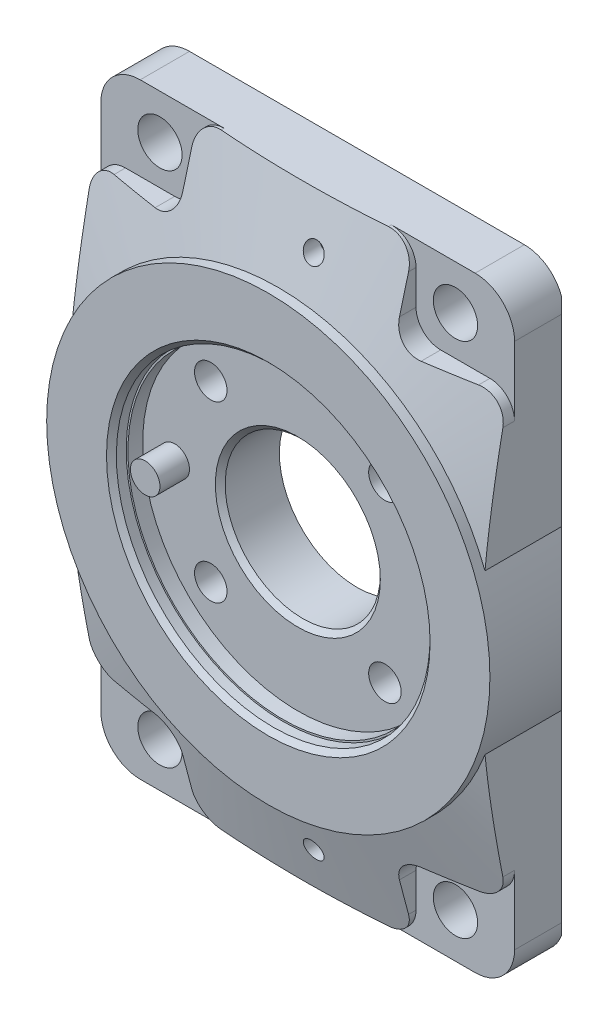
ISO-10303-21;
HEADER;
FILE_DESCRIPTION(('STEP AP214'),'2;1');
FILE_NAME('part.step','',(''),(''),'','','');
FILE_SCHEMA(('AUTOMOTIVE_DESIGN { 1 0 10303 214 1 1 1 1 }'));
ENDSEC;
DATA;
#1=APPLICATION_CONTEXT('core data for automotive mechanical design processes');
#2=APPLICATION_PROTOCOL_DEFINITION('international standard','automotive_design',2000,#1);
#3=PRODUCT_CONTEXT('',#1,'mechanical');
#4=PRODUCT('Part','Part','',(#3));
#5=PRODUCT_RELATED_PRODUCT_CATEGORY('part','',(#4));
#6=PRODUCT_DEFINITION_FORMATION('','',#4);
#7=PRODUCT_DEFINITION_CONTEXT('part definition',#1,'design');
#8=PRODUCT_DEFINITION('design','',#6,#7);
#9=PRODUCT_DEFINITION_SHAPE('','',#8);
#10=(LENGTH_UNIT() NAMED_UNIT(*) SI_UNIT(.MILLI.,.METRE.));
#11=(NAMED_UNIT(*) PLANE_ANGLE_UNIT() SI_UNIT($,.RADIAN.));
#12=(NAMED_UNIT(*) SI_UNIT($,.STERADIAN.) SOLID_ANGLE_UNIT());
#13=UNCERTAINTY_MEASURE_WITH_UNIT(LENGTH_MEASURE(1.E-05),#10,'distance_accuracy_value','');
#14=(GEOMETRIC_REPRESENTATION_CONTEXT(3) GLOBAL_UNCERTAINTY_ASSIGNED_CONTEXT((#13)) GLOBAL_UNIT_ASSIGNED_CONTEXT((#10,
#11,#12)) REPRESENTATION_CONTEXT('',''));
#15=CARTESIAN_POINT('',(0.,0.,0.));
#16=DIRECTION('',(0.,0.,1.));
#17=DIRECTION('',(1.,0.,0.));
#18=AXIS2_PLACEMENT_3D('',#15,#16,#17);
#19=CARTESIAN_POINT('',(0.,0.,12.));
#20=DIRECTION('',(0.,0.,1.));
#21=DIRECTION('',(0.,-1.,0.));
#22=AXIS2_PLACEMENT_3D('',#19,#20,#21);
#23=PLANE('',#22);
#24=CARTESIAN_POINT('',(0.,0.,12.));
#25=DIRECTION('',(0.,0.,1.));
#26=DIRECTION('',(1.,0.,0.));
#27=AXIS2_PLACEMENT_3D('',#24,#25,#26);
#28=CIRCLE('',#27,16.75);
#29=CARTESIAN_POINT('',(16.7500000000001,0.,11.9999999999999));
#30=VERTEX_POINT('',#29);
#31=EDGE_CURVE('E530',#30,#30,#28,.F.);
#32=ORIENTED_EDGE('',*,*,#31,.T.);
#33=EDGE_LOOP('',(#32));
#34=FACE_BOUND('',#33,.T.);
#35=CARTESIAN_POINT('',(17.6776695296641,17.6776695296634,11.9999999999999));
#36=DIRECTION('',(0.,0.,-1.));
#37=DIRECTION('',(0.,1.,0.));
#38=AXIS2_PLACEMENT_3D('',#35,#36,#37);
#39=CIRCLE('',#38,3.3);
#40=CARTESIAN_POINT('',(17.677669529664,20.9776695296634,11.9999999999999));
#41=VERTEX_POINT('',#40);
#42=EDGE_CURVE('E527',#41,#41,#39,.T.);
#43=ORIENTED_EDGE('',*,*,#42,.T.);
#44=EDGE_LOOP('',(#43));
#45=FACE_BOUND('',#44,.T.);
#46=CARTESIAN_POINT('',(-17.6776695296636,17.6776695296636,12.0000000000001));
#47=DIRECTION('',(0.,0.,-1.));
#48=DIRECTION('',(0.,1.,0.));
#49=AXIS2_PLACEMENT_3D('',#46,#47,#48);
#50=CIRCLE('',#49,3.3);
#51=CARTESIAN_POINT('',(-17.6776695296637,20.9776695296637,12.0000000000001));
#52=VERTEX_POINT('',#51);
#53=EDGE_CURVE('E524',#52,#52,#50,.T.);
#54=ORIENTED_EDGE('',*,*,#53,.T.);
#55=EDGE_LOOP('',(#54));
#56=FACE_BOUND('',#55,.T.);
#57=CARTESIAN_POINT('',(17.6776695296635,-17.6776695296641,11.9999999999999));
#58=DIRECTION('',(0.,0.,-1.));
#59=DIRECTION('',(0.,1.,0.));
#60=AXIS2_PLACEMENT_3D('',#57,#58,#59);
#61=CIRCLE('',#60,3.3);
#62=CARTESIAN_POINT('',(17.6776695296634,-14.3776695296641,11.9999999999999));
#63=VERTEX_POINT('',#62);
#64=EDGE_CURVE('E533',#63,#63,#61,.T.);
#65=ORIENTED_EDGE('',*,*,#64,.T.);
#66=EDGE_LOOP('',(#65));
#67=FACE_BOUND('',#66,.T.);
#68=CARTESIAN_POINT('',(-17.677669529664,-17.6776695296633,12.0000000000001));
#69=DIRECTION('',(0.,0.,-1.));
#70=DIRECTION('',(0.,1.,0.));
#71=AXIS2_PLACEMENT_3D('',#68,#69,#70);
#72=CIRCLE('',#71,3.3);
#73=CARTESIAN_POINT('',(-17.677669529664,-14.3776695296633,12.0000000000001));
#74=VERTEX_POINT('',#73);
#75=EDGE_CURVE('E536',#74,#74,#72,.T.);
#76=ORIENTED_EDGE('',*,*,#75,.T.);
#77=EDGE_LOOP('',(#76));
#78=FACE_BOUND('',#77,.T.);
#79=CARTESIAN_POINT('',(-25.,0.,12.0000000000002));
#80=DIRECTION('',(0.,0.,1.));
#81=DIRECTION('',(1.,0.,0.));
#82=AXIS2_PLACEMENT_3D('',#79,#80,#81);
#83=CIRCLE('',#82,3.);
#84=CARTESIAN_POINT('',(-22.,0.,12.0000000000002));
#85=VERTEX_POINT('',#84);
#86=EDGE_CURVE('E790',#85,#85,#83,.F.);
#87=ORIENTED_EDGE('',*,*,#86,.T.);
#88=EDGE_LOOP('',(#87));
#89=FACE_BOUND('',#88,.T.);
#90=CARTESIAN_POINT('',(0.,0.,12.));
#91=DIRECTION('',(0.,0.,1.));
#92=DIRECTION('',(1.,0.,0.));
#93=AXIS2_PLACEMENT_3D('',#90,#91,#92);
#94=CIRCLE('',#93,31.5);
#95=CARTESIAN_POINT('',(31.5000000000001,0.,11.9999999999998));
#96=VERTEX_POINT('',#95);
#97=EDGE_CURVE('E798',#96,#96,#94,.F.);
#98=ORIENTED_EDGE('',*,*,#97,.F.);
#99=EDGE_LOOP('',(#98));
#100=FACE_BOUND('',#99,.T.);
#101=ADVANCED_FACE('F17',(#34,#45,#56,#67,#78,#89,#100),#23,.T.);
#102=CARTESIAN_POINT('',(52.,-17.9164728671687,-3.6429192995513E-13));
#103=DIRECTION('',(0.,0.,1.));
#104=DIRECTION('',(0.,-1.,0.));
#105=AXIS2_PLACEMENT_3D('',#102,#103,#104);
#106=PLANE('',#105);
#107=CARTESIAN_POINT('',(-17.6776695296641,-17.6776695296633,1.2490009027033E-13));
#108=DIRECTION('',(0.,0.,-1.));
#109=DIRECTION('',(0.,1.,0.));
#110=AXIS2_PLACEMENT_3D('',#107,#108,#109);
#111=CIRCLE('',#110,5.5);
#112=CARTESIAN_POINT('',(-17.6776695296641,-12.1776695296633,1.2490009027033E-13));
#113=VERTEX_POINT('',#112);
#114=EDGE_CURVE('E706',#113,#113,#111,.T.);
#115=ORIENTED_EDGE('',*,*,#114,.F.);
#116=EDGE_LOOP('',(#115));
#117=FACE_BOUND('',#116,.T.);
#118=CARTESIAN_POINT('',(17.6776695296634,-17.6776695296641,-1.2490009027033E-13));
#119=DIRECTION('',(0.,0.,-1.));
#120=DIRECTION('',(0.,1.,0.));
#121=AXIS2_PLACEMENT_3D('',#118,#119,#120);
#122=CIRCLE('',#121,5.5);
#123=CARTESIAN_POINT('',(17.6776695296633,-12.1776695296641,-1.2490009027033E-13));
#124=VERTEX_POINT('',#123);
#125=EDGE_CURVE('E703',#124,#124,#122,.T.);
#126=ORIENTED_EDGE('',*,*,#125,.F.);
#127=EDGE_LOOP('',(#126));
#128=FACE_BOUND('',#127,.T.);
#129=CARTESIAN_POINT('',(17.677669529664,17.6776695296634,-1.2490009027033E-13));
#130=DIRECTION('',(0.,0.,-1.));
#131=DIRECTION('',(0.,1.,0.));
#132=AXIS2_PLACEMENT_3D('',#129,#130,#131);
#133=CIRCLE('',#132,5.5);
#134=CARTESIAN_POINT('',(17.6776695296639,23.1776695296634,-1.2490009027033E-13));
#135=VERTEX_POINT('',#134);
#136=EDGE_CURVE('E700',#135,#135,#133,.T.);
#137=ORIENTED_EDGE('',*,*,#136,.F.);
#138=EDGE_LOOP('',(#137));
#139=FACE_BOUND('',#138,.T.);
#140=CARTESIAN_POINT('',(-17.6776695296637,17.6776695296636,1.2490009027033E-13));
#141=DIRECTION('',(0.,0.,-1.));
#142=DIRECTION('',(0.,1.,0.));
#143=AXIS2_PLACEMENT_3D('',#140,#141,#142);
#144=CIRCLE('',#143,5.5);
#145=CARTESIAN_POINT('',(-17.6776695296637,23.1776695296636,1.2490009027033E-13));
#146=VERTEX_POINT('',#145);
#147=EDGE_CURVE('E696',#146,#146,#144,.T.);
#148=ORIENTED_EDGE('',*,*,#147,.F.);
#149=EDGE_LOOP('',(#148));
#150=FACE_BOUND('',#149,.T.);
#151=CARTESIAN_POINT('',(-25.,0.,1.7347234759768E-13));
#152=DIRECTION('',(0.,0.,1.));
#153=DIRECTION('',(0.,-1.,0.));
#154=AXIS2_PLACEMENT_3D('',#151,#152,#153);
#155=CIRCLE('',#154,2.);
#156=CARTESIAN_POINT('',(-25.,-2.00000000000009,1.7347234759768E-13));
#157=VERTEX_POINT('',#156);
#158=EDGE_CURVE('E692',#157,#157,#155,.F.);
#159=ORIENTED_EDGE('',*,*,#158,.F.);
#160=EDGE_LOOP('',(#159));
#161=FACE_BOUND('',#160,.T.);
#162=CARTESIAN_POINT('',(5.00000000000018,-52.5,0.));
#163=DIRECTION('',(0.,0.,-1.));
#164=DIRECTION('',(0.,1.,0.));
#165=AXIS2_PLACEMENT_3D('',#162,#163,#164);
#166=CIRCLE('',#165,3.);
#167=CARTESIAN_POINT('',(5.00000000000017,-49.5,0.));
#168=VERTEX_POINT('',#167);
#169=EDGE_CURVE('E689',#168,#168,#166,.T.);
#170=ORIENTED_EDGE('',*,*,#169,.F.);
#171=EDGE_LOOP('',(#170));
#172=FACE_BOUND('',#171,.T.);
#173=CARTESIAN_POINT('',(4.99999999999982,52.5,0.));
#174=DIRECTION('',(0.,0.,-1.));
#175=DIRECTION('',(0.,1.,0.));
#176=AXIS2_PLACEMENT_3D('',#173,#174,#175);
#177=CIRCLE('',#176,3.);
#178=CARTESIAN_POINT('',(4.99999999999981,55.5,0.));
#179=VERTEX_POINT('',#178);
#180=EDGE_CURVE('E686',#179,#179,#177,.T.);
#181=ORIENTED_EDGE('',*,*,#180,.F.);
#182=EDGE_LOOP('',(#181));
#183=FACE_BOUND('',#182,.T.);
#184=CARTESIAN_POINT('',(-30.,52.5,2.04697370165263E-13));
#185=DIRECTION('',(0.,0.,1.));
#186=DIRECTION('',(0.,-1.,0.));
#187=AXIS2_PLACEMENT_3D('',#184,#185,#186);
#188=CIRCLE('',#187,4.5);
#189=CARTESIAN_POINT('',(-30.,48.,2.04697370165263E-13));
#190=VERTEX_POINT('',#189);
#191=EDGE_CURVE('E683',#190,#190,#188,.F.);
#192=ORIENTED_EDGE('',*,*,#191,.F.);
#193=EDGE_LOOP('',(#192));
#194=FACE_BOUND('',#193,.T.);
#195=CARTESIAN_POINT('',(30.,52.5,-2.1163626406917E-13));
#196=DIRECTION('',(0.,0.,1.));
#197=DIRECTION('',(0.,-1.,0.));
#198=AXIS2_PLACEMENT_3D('',#195,#196,#197);
#199=CIRCLE('',#198,4.5);
#200=CARTESIAN_POINT('',(30.,48.,-2.1163626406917E-13));
#201=VERTEX_POINT('',#200);
#202=EDGE_CURVE('E680',#201,#201,#199,.F.);
#203=ORIENTED_EDGE('',*,*,#202,.F.);
#204=EDGE_LOOP('',(#203));
#205=FACE_BOUND('',#204,.T.);
#206=CARTESIAN_POINT('',(30.,-52.5,-2.1163626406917E-13));
#207=DIRECTION('',(0.,0.,1.));
#208=DIRECTION('',(0.,-1.,0.));
#209=AXIS2_PLACEMENT_3D('',#206,#207,#208);
#210=CIRCLE('',#209,4.5);
#211=CARTESIAN_POINT('',(30.,-57.,-2.1163626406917E-13));
#212=VERTEX_POINT('',#211);
#213=EDGE_CURVE('E677',#212,#212,#210,.F.);
#214=ORIENTED_EDGE('',*,*,#213,.F.);
#215=EDGE_LOOP('',(#214));
#216=FACE_BOUND('',#215,.T.);
#217=CARTESIAN_POINT('',(-30.,-52.5,2.04697370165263E-13));
#218=DIRECTION('',(0.,0.,1.));
#219=DIRECTION('',(0.,-1.,0.));
#220=AXIS2_PLACEMENT_3D('',#217,#218,#219);
#221=CIRCLE('',#220,4.5);
#222=CARTESIAN_POINT('',(-30.,-57.,2.04697370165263E-13));
#223=VERTEX_POINT('',#222);
#224=EDGE_CURVE('E26',#223,#223,#221,.F.);
#225=ORIENTED_EDGE('',*,*,#224,.F.);
#226=EDGE_LOOP('',(#225));
#227=FACE_BOUND('',#226,.T.);
#228=CARTESIAN_POINT('',(0.,0.,0.));
#229=DIRECTION('',(0.,0.,1.));
#230=DIRECTION('',(0.,-1.,0.));
#231=AXIS2_PLACEMENT_3D('',#228,#229,#230);
#232=CIRCLE('',#231,15.75);
#233=CARTESIAN_POINT('',(0.,-15.75,0.));
#234=VERTEX_POINT('',#233);
#235=EDGE_CURVE('E11',#234,#234,#232,.T.);
#236=ORIENTED_EDGE('',*,*,#235,.T.);
#237=EDGE_LOOP('',(#236));
#238=FACE_BOUND('',#237,.T.);
#239=DIRECTION('',(0.,-1.,0.));
#240=VECTOR('',#239,1.);
#241=CARTESIAN_POINT('',(-41.5,-17.9164728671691,2.91433543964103E-13));
#242=LINE('',#241,#240);
#243=CARTESIAN_POINT('',(-41.5,56.2838821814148,2.91433543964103E-13));
#244=VERTEX_POINT('',#243);
#245=CARTESIAN_POINT('',(-41.5,-56.2838821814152,2.91433543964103E-13));
#246=VERTEX_POINT('',#245);
#247=EDGE_CURVE('E699',#244,#246,#242,.T.);
#248=ORIENTED_EDGE('',*,*,#247,.F.);
#249=CARTESIAN_POINT('',(-34.,53.5,2.35922392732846E-13));
#250=DIRECTION('',(0.,0.,-1.));
#251=DIRECTION('',(0.,1.,0.));
#252=AXIS2_PLACEMENT_3D('',#249,#250,#251);
#253=CIRCLE('',#252,8.);
#254=CARTESIAN_POINT('',(-34.,61.5,2.35922392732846E-13));
#255=VERTEX_POINT('',#254);
#256=EDGE_CURVE('E761',#244,#255,#253,.T.);
#257=ORIENTED_EDGE('',*,*,#256,.T.);
#258=DIRECTION('',(1.,0.,0.));
#259=VECTOR('',#258,1.);
#260=CARTESIAN_POINT('',(34.,61.5,-2.35922392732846E-13));
#261=LINE('',#260,#259);
#262=CARTESIAN_POINT('',(34.,61.5,-2.35922392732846E-13));
#263=VERTEX_POINT('',#262);
#264=EDGE_CURVE('E764',#255,#263,#261,.T.);
#265=ORIENTED_EDGE('',*,*,#264,.T.);
#266=CARTESIAN_POINT('',(34.,53.5,-2.35922392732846E-13));
#267=DIRECTION('',(0.,0.,-1.));
#268=DIRECTION('',(0.,1.,0.));
#269=AXIS2_PLACEMENT_3D('',#266,#267,#268);
#270=CIRCLE('',#269,8.);
#271=CARTESIAN_POINT('',(41.5,56.2838821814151,-2.91433543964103E-13));
#272=VERTEX_POINT('',#271);
#273=EDGE_CURVE('E767',#263,#272,#270,.T.);
#274=ORIENTED_EDGE('',*,*,#273,.T.);
#275=DIRECTION('',(0.,-1.,0.));
#276=VECTOR('',#275,1.);
#277=CARTESIAN_POINT('',(41.5,-17.9164728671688,-2.91433543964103E-13));
#278=LINE('',#277,#276);
#279=CARTESIAN_POINT('',(41.5,-56.2838821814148,-2.91433543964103E-13));
#280=VERTEX_POINT('',#279);
#281=EDGE_CURVE('E695',#280,#272,#278,.F.);
#282=ORIENTED_EDGE('',*,*,#281,.F.);
#283=CARTESIAN_POINT('',(34.,-53.5,-2.35922392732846E-13));
#284=DIRECTION('',(0.,0.,-1.));
#285=DIRECTION('',(0.,1.,0.));
#286=AXIS2_PLACEMENT_3D('',#283,#284,#285);
#287=CIRCLE('',#286,8.);
#288=CARTESIAN_POINT('',(34.,-61.5,-2.35922392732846E-13));
#289=VERTEX_POINT('',#288);
#290=EDGE_CURVE('E755',#280,#289,#287,.T.);
#291=ORIENTED_EDGE('',*,*,#290,.T.);
#292=DIRECTION('',(-1.,0.,0.));
#293=VECTOR('',#292,1.);
#294=CARTESIAN_POINT('',(-34.,-61.5,2.35922392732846E-13));
#295=LINE('',#294,#293);
#296=CARTESIAN_POINT('',(-34.,-61.5,2.35922392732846E-13));
#297=VERTEX_POINT('',#296);
#298=EDGE_CURVE('E542',#289,#297,#295,.T.);
#299=ORIENTED_EDGE('',*,*,#298,.T.);
#300=CARTESIAN_POINT('',(-34.,-53.5,2.35922392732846E-13));
#301=DIRECTION('',(0.,0.,-1.));
#302=DIRECTION('',(0.,1.,0.));
#303=AXIS2_PLACEMENT_3D('',#300,#301,#302);
#304=CIRCLE('',#303,8.);
#305=EDGE_CURVE('E758',#297,#246,#304,.T.);
#306=ORIENTED_EDGE('',*,*,#305,.T.);
#307=EDGE_LOOP('',(#248,#257,#265,#274,#282,#291,#299,#306));
#308=FACE_BOUND('',#307,.T.);
#309=ADVANCED_FACE('F831',(#117,#128,#139,#150,#161,#172,#183,#194,#205,#216,#227,#238,#308),
#106,.F.);
#310=CARTESIAN_POINT('',(-34.,53.5,18.0000000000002));
#311=DIRECTION('',(0.,0.,-1.));
#312=DIRECTION('',(0.,1.,0.));
#313=AXIS2_PLACEMENT_3D('',#310,#311,#312);
#314=CYLINDRICAL_SURFACE('',#313,8.);
#315=ORIENTED_EDGE('',*,*,#256,.F.);
#316=CARTESIAN_POINT('',(-34.,53.5,-7.49999999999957));
#317=DIRECTION('',(-0.707106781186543,0.,-0.707106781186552));
#318=DIRECTION('',(0.707106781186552,0.,-0.707106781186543));
#319=AXIS2_PLACEMENT_3D('',#316,#317,#318);
#320=ELLIPSE('',#319,11.3137084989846,8.);
#321=CARTESIAN_POINT('',(-42.,53.5,0.500000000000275));
#322=VERTEX_POINT('',#321);
#323=EDGE_CURVE('E774',#244,#322,#320,.F.);
#324=ORIENTED_EDGE('',*,*,#323,.T.);
#325=DIRECTION('',(0.,0.,-1.));
#326=VECTOR('',#325,1.);
#327=CARTESIAN_POINT('',(-42.,53.5,18.0000000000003));
#328=LINE('',#327,#326);
#329=CARTESIAN_POINT('',(-42.,53.5,10.0000000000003));
#330=VERTEX_POINT('',#329);
#331=EDGE_CURVE('E247',#322,#330,#328,.F.);
#332=ORIENTED_EDGE('',*,*,#331,.T.);
#333=CARTESIAN_POINT('',(-34.,53.5,10.0000000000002));
#334=DIRECTION('',(0.,0.,-1.));
#335=DIRECTION('',(0.,1.,0.));
#336=AXIS2_PLACEMENT_3D('',#333,#334,#335);
#337=CIRCLE('',#336,8.);
#338=CARTESIAN_POINT('',(-34.,61.5,10.0000000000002));
#339=VERTEX_POINT('',#338);
#340=EDGE_CURVE('E327',#339,#330,#337,.F.);
#341=ORIENTED_EDGE('',*,*,#340,.F.);
#342=DIRECTION('',(0.,0.,-1.));
#343=VECTOR('',#342,1.);
#344=CARTESIAN_POINT('',(-34.,61.5,18.0000000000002));
#345=LINE('',#344,#343);
#346=EDGE_CURVE('E593',#339,#255,#345,.T.);
#347=ORIENTED_EDGE('',*,*,#346,.T.);
#348=EDGE_LOOP('',(#315,#324,#332,#341,#347));
#349=FACE_BOUND('',#348,.T.);
#350=ADVANCED_FACE('F838',(#349),#314,.T.);
#351=CARTESIAN_POINT('',(-34.,-53.5,18.0000000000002));
#352=DIRECTION('',(0.,0.,-1.));
#353=DIRECTION('',(0.,1.,0.));
#354=AXIS2_PLACEMENT_3D('',#351,#352,#353);
#355=CYLINDRICAL_SURFACE('',#354,8.);
#356=DIRECTION('',(0.,0.,-1.));
#357=VECTOR('',#356,1.);
#358=CARTESIAN_POINT('',(-42.,-53.5,18.0000000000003));
#359=LINE('',#358,#357);
#360=CARTESIAN_POINT('',(-42.,-53.5,10.0000000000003));
#361=VERTEX_POINT('',#360);
#362=CARTESIAN_POINT('',(-42.,-53.5,0.500000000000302));
#363=VERTEX_POINT('',#362);
#364=EDGE_CURVE('E582',#361,#363,#359,.T.);
#365=ORIENTED_EDGE('',*,*,#364,.T.);
#366=CARTESIAN_POINT('',(-34.,-53.5,-7.49999999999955));
#367=DIRECTION('',(-0.707106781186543,0.,-0.707106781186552));
#368=DIRECTION('',(0.707106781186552,0.,-0.707106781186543));
#369=AXIS2_PLACEMENT_3D('',#366,#367,#368);
#370=ELLIPSE('',#369,11.3137084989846,8.);
#371=EDGE_CURVE('E777',#363,#246,#370,.F.);
#372=ORIENTED_EDGE('',*,*,#371,.T.);
#373=ORIENTED_EDGE('',*,*,#305,.F.);
#374=DIRECTION('',(0.,0.,-1.));
#375=VECTOR('',#374,1.);
#376=CARTESIAN_POINT('',(-33.9999999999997,-61.5,18.0000000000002));
#377=LINE('',#376,#375);
#378=CARTESIAN_POINT('',(-34.,-61.5,10.0000000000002));
#379=VERTEX_POINT('',#378);
#380=EDGE_CURVE('E579',#297,#379,#377,.F.);
#381=ORIENTED_EDGE('',*,*,#380,.T.);
#382=CARTESIAN_POINT('',(-34.,-53.5,10.0000000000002));
#383=DIRECTION('',(0.,0.,-1.));
#384=DIRECTION('',(0.,1.,0.));
#385=AXIS2_PLACEMENT_3D('',#382,#383,#384);
#386=CIRCLE('',#385,8.);
#387=EDGE_CURVE('E288',#361,#379,#386,.F.);
#388=ORIENTED_EDGE('',*,*,#387,.F.);
#389=EDGE_LOOP('',(#365,#372,#373,#381,#388));
#390=FACE_BOUND('',#389,.T.);
#391=ADVANCED_FACE('F901',(#390),#355,.T.);
#392=CARTESIAN_POINT('',(34.,53.5,17.9999999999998));
#393=DIRECTION('',(0.,0.,-1.));
#394=DIRECTION('',(0.,1.,0.));
#395=AXIS2_PLACEMENT_3D('',#392,#393,#394);
#396=CYLINDRICAL_SURFACE('',#395,8.);
#397=DIRECTION('',(0.,0.,-1.));
#398=VECTOR('',#397,1.);
#399=CARTESIAN_POINT('',(42.,53.5,17.9999999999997));
#400=LINE('',#399,#398);
#401=CARTESIAN_POINT('',(42.,53.5,9.99999999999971));
#402=VERTEX_POINT('',#401);
#403=CARTESIAN_POINT('',(42.,53.5,0.499999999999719));
#404=VERTEX_POINT('',#403);
#405=EDGE_CURVE('E343',#402,#404,#400,.T.);
#406=ORIENTED_EDGE('',*,*,#405,.T.);
#407=CARTESIAN_POINT('',(34.,53.5,-7.50000000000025));
#408=DIRECTION('',(0.707106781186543,0.,-0.707106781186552));
#409=DIRECTION('',(-0.707106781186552,0.,-0.707106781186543));
#410=AXIS2_PLACEMENT_3D('',#407,#408,#409);
#411=ELLIPSE('',#410,11.3137084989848,8.);
#412=EDGE_CURVE('E34',#404,#272,#411,.F.);
#413=ORIENTED_EDGE('',*,*,#412,.T.);
#414=ORIENTED_EDGE('',*,*,#273,.F.);
#415=DIRECTION('',(0.,0.,-1.));
#416=VECTOR('',#415,1.);
#417=CARTESIAN_POINT('',(34.,61.5,17.9999999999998));
#418=LINE('',#417,#416);
#419=CARTESIAN_POINT('',(34.,61.5,9.99999999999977));
#420=VERTEX_POINT('',#419);
#421=EDGE_CURVE('E601',#263,#420,#418,.F.);
#422=ORIENTED_EDGE('',*,*,#421,.T.);
#423=CARTESIAN_POINT('',(34.,53.5,9.99999999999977));
#424=DIRECTION('',(0.,0.,-1.));
#425=DIRECTION('',(0.,1.,0.));
#426=AXIS2_PLACEMENT_3D('',#423,#424,#425);
#427=CIRCLE('',#426,8.);
#428=EDGE_CURVE('E314',#402,#420,#427,.F.);
#429=ORIENTED_EDGE('',*,*,#428,.F.);
#430=EDGE_LOOP('',(#406,#413,#414,#422,#429));
#431=FACE_BOUND('',#430,.T.);
#432=ADVANCED_FACE('F822',(#431),#396,.T.);
#433=CARTESIAN_POINT('',(34.,-53.5,17.9999999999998));
#434=DIRECTION('',(0.,0.,-1.));
#435=DIRECTION('',(0.,1.,0.));
#436=AXIS2_PLACEMENT_3D('',#433,#434,#435);
#437=CYLINDRICAL_SURFACE('',#436,8.);
#438=ORIENTED_EDGE('',*,*,#290,.F.);
#439=CARTESIAN_POINT('',(34.,-53.5,-7.50000000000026));
#440=DIRECTION('',(0.707106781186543,0.,-0.707106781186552));
#441=DIRECTION('',(-0.707106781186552,0.,-0.707106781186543));
#442=AXIS2_PLACEMENT_3D('',#439,#440,#441);
#443=ELLIPSE('',#442,11.3137084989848,8.);
#444=CARTESIAN_POINT('',(42.,-53.5,0.499999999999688));
#445=VERTEX_POINT('',#444);
#446=EDGE_CURVE('E771',#280,#445,#443,.F.);
#447=ORIENTED_EDGE('',*,*,#446,.T.);
#448=DIRECTION('',(0.,0.,-1.));
#449=VECTOR('',#448,1.);
#450=CARTESIAN_POINT('',(42.,-53.5,17.9999999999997));
#451=LINE('',#450,#449);
#452=CARTESIAN_POINT('',(42.,-53.5,9.99999999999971));
#453=VERTEX_POINT('',#452);
#454=EDGE_CURVE('E563',#445,#453,#451,.F.);
#455=ORIENTED_EDGE('',*,*,#454,.T.);
#456=CARTESIAN_POINT('',(34.,-53.5,9.99999999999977));
#457=DIRECTION('',(0.,0.,-1.));
#458=DIRECTION('',(0.,1.,0.));
#459=AXIS2_PLACEMENT_3D('',#456,#457,#458);
#460=CIRCLE('',#459,8.);
#461=CARTESIAN_POINT('',(34.,-61.5,9.99999999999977));
#462=VERTEX_POINT('',#461);
#463=EDGE_CURVE('E301',#462,#453,#460,.F.);
#464=ORIENTED_EDGE('',*,*,#463,.F.);
#465=DIRECTION('',(0.,0.,-1.));
#466=VECTOR('',#465,1.);
#467=CARTESIAN_POINT('',(34.0000000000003,-61.5,17.9999999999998));
#468=LINE('',#467,#466);
#469=EDGE_CURVE('E567',#462,#289,#468,.T.);
#470=ORIENTED_EDGE('',*,*,#469,.T.);
#471=EDGE_LOOP('',(#438,#447,#455,#464,#470));
#472=FACE_BOUND('',#471,.T.);
#473=ADVANCED_FACE('F810',(#472),#437,.T.);
#474=CARTESIAN_POINT('',(1.03951202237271E-13,0.,15.));
#475=DIRECTION('',(0.,0.,1.));
#476=DIRECTION('',(0.,-1.,0.));
#477=AXIS2_PLACEMENT_3D('',#474,#475,#476);
#478=PLANE('',#477);
#479=CARTESIAN_POINT('',(1.03951202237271E-13,0.,15.));
#480=DIRECTION('',(0.,0.,1.));
#481=DIRECTION('',(0.,-1.,0.));
#482=AXIS2_PLACEMENT_3D('',#479,#480,#481);
#483=CIRCLE('',#482,31.85);
#484=CARTESIAN_POINT('',(2.15154882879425E-13,-31.85,15.));
#485=VERTEX_POINT('',#484);
#486=EDGE_CURVE('E540',#485,#485,#483,.T.);
#487=ORIENTED_EDGE('',*,*,#486,.T.);
#488=EDGE_LOOP('',(#487));
#489=FACE_BOUND('',#488,.T.);
#490=CARTESIAN_POINT('',(0.,0.,15.));
#491=DIRECTION('',(0.,0.,1.));
#492=DIRECTION('',(1.,0.,0.));
#493=AXIS2_PLACEMENT_3D('',#490,#491,#492);
#494=CIRCLE('',#493,31.5);
#495=CARTESIAN_POINT('',(31.5000000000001,0.,15.));
#496=VERTEX_POINT('',#495);
#497=EDGE_CURVE('E801',#496,#496,#494,.T.);
#498=ORIENTED_EDGE('',*,*,#497,.F.);
#499=EDGE_LOOP('',(#498));
#500=FACE_BOUND('',#499,.T.);
#501=ADVANCED_FACE('F807',(#489,#500),#478,.T.);
#502=CARTESIAN_POINT('',(1.03951202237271E-13,0.,15.));
#503=DIRECTION('',(0.,0.,1.));
#504=DIRECTION('',(0.,-1.,0.));
#505=AXIS2_PLACEMENT_3D('',#502,#503,#504);
#506=CYLINDRICAL_SURFACE('',#505,31.85);
#507=ORIENTED_EDGE('',*,*,#486,.F.);
#508=EDGE_LOOP('',(#507));
#509=FACE_BOUND('',#508,.T.);
#510=CARTESIAN_POINT('',(1.17917127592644E-13,0.,17.));
#511=DIRECTION('',(0.,0.,1.));
#512=DIRECTION('',(0.,-1.,0.));
#513=AXIS2_PLACEMENT_3D('',#510,#511,#512);
#514=CIRCLE('',#513,31.85);
#515=CARTESIAN_POINT('',(2.29120808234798E-13,-31.85,17.));
#516=VERTEX_POINT('',#515);
#517=EDGE_CURVE('E539',#516,#516,#514,.T.);
#518=ORIENTED_EDGE('',*,*,#517,.T.);
#519=EDGE_LOOP('',(#518));
#520=FACE_BOUND('',#519,.T.);
#521=ADVANCED_FACE('F809',(#509,#520),#506,.F.);
#522=CARTESIAN_POINT('',(1.2490009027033E-13,0.,18.));
#523=DIRECTION('',(0.,0.,1.));
#524=DIRECTION('',(0.,-1.,0.));
#525=AXIS2_PLACEMENT_3D('',#522,#523,#524);
#526=CONICAL_SURFACE('',#525,32.85,0.785398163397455);
#527=ORIENTED_EDGE('',*,*,#517,.F.);
#528=EDGE_LOOP('',(#527));
#529=FACE_BOUND('',#528,.T.);
#530=CARTESIAN_POINT('',(1.2490009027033E-13,0.,18.));
#531=DIRECTION('',(0.,0.,1.));
#532=DIRECTION('',(0.,-1.,0.));
#533=AXIS2_PLACEMENT_3D('',#530,#531,#532);
#534=CIRCLE('',#533,32.85);
#535=CARTESIAN_POINT('',(2.39595252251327E-13,-32.85,18.));
#536=VERTEX_POINT('',#535);
#537=EDGE_CURVE('E516',#536,#536,#534,.F.);
#538=ORIENTED_EDGE('',*,*,#537,.F.);
#539=EDGE_LOOP('',(#538));
#540=FACE_BOUND('',#539,.T.);
#541=ADVANCED_FACE('F819',(#529,#540),#526,.F.);
#542=CARTESIAN_POINT('',(-17.6776695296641,-17.6776695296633,1.2490009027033E-13));
#543=DIRECTION('',(0.,0.,-1.));
#544=DIRECTION('',(0.,1.,0.));
#545=AXIS2_PLACEMENT_3D('',#542,#543,#544);
#546=CYLINDRICAL_SURFACE('',#545,3.3);
#547=ORIENTED_EDGE('',*,*,#75,.F.);
#548=EDGE_LOOP('',(#547));
#549=FACE_BOUND('',#548,.T.);
#550=CARTESIAN_POINT('',(-17.6776695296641,-17.6776695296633,6.50000000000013));
#551=DIRECTION('',(0.,0.,-1.));
#552=DIRECTION('',(0.,1.,0.));
#553=AXIS2_PLACEMENT_3D('',#550,#551,#552);
#554=CIRCLE('',#553,3.3);
#555=CARTESIAN_POINT('',(-17.6776695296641,-14.3776695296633,6.50000000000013));
#556=VERTEX_POINT('',#555);
#557=EDGE_CURVE('E951',#556,#556,#554,.T.);
#558=ORIENTED_EDGE('',*,*,#557,.T.);
#559=EDGE_LOOP('',(#558));
#560=FACE_BOUND('',#559,.T.);
#561=ADVANCED_FACE('F844',(#549,#560),#546,.F.);
#562=CARTESIAN_POINT('',(17.6776695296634,-17.6776695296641,-1.2490009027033E-13));
#563=DIRECTION('',(0.,0.,-1.));
#564=DIRECTION('',(0.,1.,0.));
#565=AXIS2_PLACEMENT_3D('',#562,#563,#564);
#566=CYLINDRICAL_SURFACE('',#565,3.3);
#567=ORIENTED_EDGE('',*,*,#64,.F.);
#568=EDGE_LOOP('',(#567));
#569=FACE_BOUND('',#568,.T.);
#570=CARTESIAN_POINT('',(17.6776695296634,-17.6776695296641,6.49999999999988));
#571=DIRECTION('',(0.,0.,-1.));
#572=DIRECTION('',(0.,1.,0.));
#573=AXIS2_PLACEMENT_3D('',#570,#571,#572);
#574=CIRCLE('',#573,3.3);
#575=CARTESIAN_POINT('',(17.6776695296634,-14.3776695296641,6.49999999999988));
#576=VERTEX_POINT('',#575);
#577=EDGE_CURVE('E672',#576,#576,#574,.T.);
#578=ORIENTED_EDGE('',*,*,#577,.T.);
#579=EDGE_LOOP('',(#578));
#580=FACE_BOUND('',#579,.T.);
#581=ADVANCED_FACE('F852',(#569,#580),#566,.F.);
#582=CARTESIAN_POINT('',(0.,0.,12.));
#583=DIRECTION('',(0.,0.,1.));
#584=DIRECTION('',(1.,0.,0.));
#585=AXIS2_PLACEMENT_3D('',#582,#583,#584);
#586=CONICAL_SURFACE('',#585,16.75,0.785398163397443);
#587=CARTESIAN_POINT('',(0.,0.,11.));
#588=DIRECTION('',(0.,0.,1.));
#589=DIRECTION('',(0.,-1.,0.));
#590=AXIS2_PLACEMENT_3D('',#587,#588,#589);
#591=CIRCLE('',#590,15.75);
#592=CARTESIAN_POINT('',(1.31010182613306E-13,-15.75,11.));
#593=VERTEX_POINT('',#592);
#594=EDGE_CURVE('E668',#593,#593,#591,.F.);
#595=ORIENTED_EDGE('',*,*,#594,.T.);
#596=EDGE_LOOP('',(#595));
#597=FACE_BOUND('',#596,.T.);
#598=ORIENTED_EDGE('',*,*,#31,.F.);
#599=EDGE_LOOP('',(#598));
#600=FACE_BOUND('',#599,.T.);
#601=ADVANCED_FACE('F1285',(#597,#600),#586,.F.);
#602=CARTESIAN_POINT('',(17.677669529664,17.6776695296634,-1.2490009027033E-13));
#603=DIRECTION('',(0.,0.,-1.));
#604=DIRECTION('',(0.,1.,0.));
#605=AXIS2_PLACEMENT_3D('',#602,#603,#604);
#606=CYLINDRICAL_SURFACE('',#605,3.3);
#607=ORIENTED_EDGE('',*,*,#42,.F.);
#608=EDGE_LOOP('',(#607));
#609=FACE_BOUND('',#608,.T.);
#610=CARTESIAN_POINT('',(17.677669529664,17.6776695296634,6.49999999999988));
#611=DIRECTION('',(0.,0.,-1.));
#612=DIRECTION('',(0.,1.,0.));
#613=AXIS2_PLACEMENT_3D('',#610,#611,#612);
#614=CIRCLE('',#613,3.3);
#615=CARTESIAN_POINT('',(17.677669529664,20.9776695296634,6.49999999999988));
#616=VERTEX_POINT('',#615);
#617=EDGE_CURVE('E671',#616,#616,#614,.T.);
#618=ORIENTED_EDGE('',*,*,#617,.T.);
#619=EDGE_LOOP('',(#618));
#620=FACE_BOUND('',#619,.T.);
#621=ADVANCED_FACE('F1275',(#609,#620),#606,.F.);
#622=CARTESIAN_POINT('',(-17.6776695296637,17.6776695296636,1.2490009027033E-13));
#623=DIRECTION('',(0.,0.,-1.));
#624=DIRECTION('',(0.,1.,0.));
#625=AXIS2_PLACEMENT_3D('',#622,#623,#624);
#626=CYLINDRICAL_SURFACE('',#625,3.3);
#627=ORIENTED_EDGE('',*,*,#53,.F.);
#628=EDGE_LOOP('',(#627));
#629=FACE_BOUND('',#628,.T.);
#630=CARTESIAN_POINT('',(-17.6776695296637,17.6776695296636,6.50000000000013));
#631=DIRECTION('',(0.,0.,-1.));
#632=DIRECTION('',(0.,1.,0.));
#633=AXIS2_PLACEMENT_3D('',#630,#631,#632);
#634=CIRCLE('',#633,3.3);
#635=CARTESIAN_POINT('',(-17.6776695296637,20.9776695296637,6.50000000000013));
#636=VERTEX_POINT('',#635);
#637=EDGE_CURVE('E1065',#636,#636,#634,.T.);
#638=ORIENTED_EDGE('',*,*,#637,.T.);
#639=EDGE_LOOP('',(#638));
#640=FACE_BOUND('',#639,.T.);
#641=ADVANCED_FACE('F450',(#629,#640),#626,.F.);
#642=CARTESIAN_POINT('',(0.,0.,10.5130948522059));
#643=DIRECTION('',(0.,0.,-1.));
#644=DIRECTION('',(0.,1.,0.));
#645=AXIS2_PLACEMENT_3D('',#642,#643,#644);
#646=CONICAL_SURFACE('',#645,64.1351122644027,1.29154364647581);
#647=CARTESIAN_POINT('',(5.00000000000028,-50.5,14.3520968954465));
#648=CARTESIAN_POINT('',(5.10953370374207,-50.5000048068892,14.3490007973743));
#649=CARTESIAN_POINT('',(5.21914976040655,-50.509042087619,14.3432232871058));
#650=CARTESIAN_POINT('',(5.43520404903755,-50.5448432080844,14.3265186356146));
#651=CARTESIAN_POINT('',(5.54163443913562,-50.5716475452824,14.3155797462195));
#652=CARTESIAN_POINT('',(5.74797285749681,-50.6419408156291,14.2889887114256));
#653=CARTESIAN_POINT('',(5.84789357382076,-50.6853960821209,14.2733460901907));
#654=CARTESIAN_POINT('',(6.03875842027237,-50.7874883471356,14.2379029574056));
#655=CARTESIAN_POINT('',(6.12970625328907,-50.8461190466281,14.2181041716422));
#656=CARTESIAN_POINT('',(6.30242156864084,-50.9782298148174,14.1744999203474));
#657=CARTESIAN_POINT('',(6.38393338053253,-51.0520171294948,14.1506136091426));
#658=CARTESIAN_POINT('',(6.53341650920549,-51.2113664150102,14.0999096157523));
#659=CARTESIAN_POINT('',(6.60138420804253,-51.2969315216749,14.0730911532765));
#660=CARTESIAN_POINT('',(6.72470077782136,-51.4810924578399,14.0161760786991));
#661=CARTESIAN_POINT('',(6.77943404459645,-51.5800733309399,13.9859911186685));
#662=CARTESIAN_POINT('',(6.87138093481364,-51.7854389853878,13.9241584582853));
#663=CARTESIAN_POINT('',(6.90859150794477,-51.8918250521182,13.8925105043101));
#664=CARTESIAN_POINT('',(6.96553449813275,-52.1126047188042,13.8275998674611));
#665=CARTESIAN_POINT('',(6.98467688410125,-52.2271451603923,13.7943177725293));
#666=CARTESIAN_POINT('',(7.00290439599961,-52.4579016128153,13.7280400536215));
#667=CARTESIAN_POINT('',(7.00198760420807,-52.5741177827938,13.6950444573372));
#668=CARTESIAN_POINT('',(6.97989817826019,-52.8061280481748,13.6299276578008));
#669=CARTESIAN_POINT('',(6.958524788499,-52.9219065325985,13.5978183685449));
#670=CARTESIAN_POINT('',(6.89560449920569,-53.148461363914,13.5357385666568));
#671=CARTESIAN_POINT('',(6.85405838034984,-53.2592379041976,13.5057679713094));
#672=CARTESIAN_POINT('',(6.75250612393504,-53.4707030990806,13.4493002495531));
#673=CARTESIAN_POINT('',(6.69279819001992,-53.5715222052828,13.4227562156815));
#674=CARTESIAN_POINT('',(6.55616551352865,-53.7617662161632,13.3734151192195));
#675=CARTESIAN_POINT('',(6.47924546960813,-53.8511942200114,13.3506170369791));
#676=CARTESIAN_POINT('',(6.3131271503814,-54.0128362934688,13.3101977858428));
#677=CARTESIAN_POINT('',(6.22443237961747,-54.0855304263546,13.2924275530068));
#678=CARTESIAN_POINT('',(6.03530182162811,-54.2150151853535,13.2616341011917));
#679=CARTESIAN_POINT('',(5.9348629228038,-54.2718015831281,13.2486121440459));
#680=CARTESIAN_POINT('',(5.72900665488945,-54.3657186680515,13.2281349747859));
#681=CARTESIAN_POINT('',(5.62389069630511,-54.4034731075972,13.2204992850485));
#682=CARTESIAN_POINT('',(5.40876920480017,-54.4609303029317,13.2103268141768));
#683=CARTESIAN_POINT('',(5.29877589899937,-54.4806757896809,13.2077779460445));
#684=CARTESIAN_POINT('',(5.15680839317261,-54.4940920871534,13.2078067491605));
#685=CARTESIAN_POINT('',(5.12548652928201,-54.4963062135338,13.2080181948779));
#686=CARTESIAN_POINT('',(5.06277894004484,-54.4992608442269,13.2088481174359));
#687=CARTESIAN_POINT('',(5.03139321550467,-54.5000013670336,13.2094665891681));
#688=CARTESIAN_POINT('',(4.89019404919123,-54.4999952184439,13.2131671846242));
#689=CARTESIAN_POINT('',(4.78029645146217,-54.4909139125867,13.2185443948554));
#690=CARTESIAN_POINT('',(4.56365378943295,-54.4549191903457,13.2341367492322));
#691=CARTESIAN_POINT('',(4.45691641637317,-54.4279654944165,13.244362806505));
#692=CARTESIAN_POINT('',(4.24993675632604,-54.3572387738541,13.26931372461));
#693=CARTESIAN_POINT('',(4.14968303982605,-54.3134963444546,13.2840303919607));
#694=CARTESIAN_POINT('',(3.95819441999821,-54.2106875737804,13.3175193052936));
#695=CARTESIAN_POINT('',(3.86695567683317,-54.1516277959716,13.3362898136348));
#696=CARTESIAN_POINT('',(3.69406121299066,-54.01876107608,13.3777536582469));
#697=CARTESIAN_POINT('',(3.61262232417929,-53.944693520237,13.4005151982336));
#698=CARTESIAN_POINT('',(3.46334468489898,-53.7847809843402,13.4490763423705));
#699=CARTESIAN_POINT('',(3.395509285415,-53.6989331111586,13.4748766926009));
#700=CARTESIAN_POINT('',(3.27279546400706,-53.5146210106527,13.5298103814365));
#701=CARTESIAN_POINT('',(3.21847001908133,-53.4158143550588,13.5590301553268));
#702=CARTESIAN_POINT('',(3.12726723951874,-53.2109504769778,13.6192238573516));
#703=CARTESIAN_POINT('',(3.09039284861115,-53.1048920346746,13.6501980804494));
#704=CARTESIAN_POINT('',(3.03400104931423,-52.8849008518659,13.7141074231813));
#705=CARTESIAN_POINT('',(3.01507708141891,-52.7708247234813,13.7470735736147));
#706=CARTESIAN_POINT('',(2.99710691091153,-52.5411424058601,13.8131205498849));
#707=CARTESIAN_POINT('',(2.99806309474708,-52.4255360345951,13.8462013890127));
#708=CARTESIAN_POINT('',(3.02004400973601,-52.1942906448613,13.9120385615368));
#709=CARTESIAN_POINT('',(3.04136248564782,-52.0786759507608,13.9447830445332));
#710=CARTESIAN_POINT('',(3.10408229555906,-51.8524910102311,14.0084658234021));
#711=CARTESIAN_POINT('',(3.14548359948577,-51.7419207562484,14.039404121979));
#712=CARTESIAN_POINT('',(3.24690362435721,-51.5303258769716,14.0981651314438));
#713=CARTESIAN_POINT('',(3.30671592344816,-51.4292108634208,14.126017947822));
#714=CARTESIAN_POINT('',(3.44366748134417,-51.2384100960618,14.1780347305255));
#715=CARTESIAN_POINT('',(3.52080211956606,-51.1487213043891,14.2021996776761));
#716=CARTESIAN_POINT('',(3.68748343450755,-50.9866066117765,14.245203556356));
#717=CARTESIAN_POINT('',(3.77652309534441,-50.9137000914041,14.2641947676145));
#718=CARTESIAN_POINT('',(3.96648210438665,-50.7838804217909,14.2971771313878));
#719=CARTESIAN_POINT('',(4.06740418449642,-50.7269709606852,14.3111671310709));
#720=CARTESIAN_POINT('',(4.2738152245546,-50.633184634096,14.333112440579));
#721=CARTESIAN_POINT('',(4.37895858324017,-50.5955957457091,14.3412873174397));
#722=CARTESIAN_POINT('',(4.59414006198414,-50.5384666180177,14.3521512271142));
#723=CARTESIAN_POINT('',(4.70416571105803,-50.5188828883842,14.3548534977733));
#724=CARTESIAN_POINT('',(4.84565971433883,-50.5057230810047,14.3547599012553));
#725=CARTESIAN_POINT('',(4.8764905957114,-50.5035781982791,14.3545250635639));
#726=CARTESIAN_POINT('',(4.93821213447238,-50.5007159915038,14.3536302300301));
#727=CARTESIAN_POINT('',(4.96910279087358,-50.4999986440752,14.3529702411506));
#728=CARTESIAN_POINT('',(5.00000000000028,-50.5,14.3520968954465));
#729=B_SPLINE_CURVE_WITH_KNOTS('',3,(#647,#648,#649,#650,#651,#652,#653,#654,#655,#656,#657,
#658,#659,#660,#661,#662,#663,#664,#665,#666,#667,#668,#669,#670,#671,#672,#673,#674,#675,#676,
#677,#678,#679,#680,#681,#682,#683,#684,#685,#686,#687,#688,#689,#690,#691,#692,#693,#694,#695,
#696,#697,#698,#699,#700,#701,#702,#703,#704,#705,#706,#707,#708,#709,#710,#711,#712,#713,#714,
#715,#716,#717,#718,#719,#720,#721,#722,#723,#724,#725,#726,#727,#728),.UNSPECIFIED.,.T.,.F.,(4,
2,2,2,2,2,2,2,2,2,2,2,2,2,2,2,2,2,2,2,2,2,2,2,2,2,2,2,2,2,2,2,2,2,2,2,2,2,2,2,4),(0.,
0.328611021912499,0.657973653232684,0.986673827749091,1.31523778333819,1.65127030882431,
1.98739247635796,2.33699865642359,2.68666567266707,3.04739211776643,3.40815304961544,
3.77249108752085,4.13681502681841,4.49545336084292,4.85399391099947,5.20040299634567,
5.54690407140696,5.88115889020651,6.21461852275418,6.30879662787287,6.40297355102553,
6.73238187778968,7.06253513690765,7.39208957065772,7.72150302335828,8.05722115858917,
8.39302189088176,8.74088530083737,9.08880736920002,9.44786749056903,9.80697071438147,
10.171333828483,10.5356963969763,10.8961140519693,11.2564356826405,11.6045913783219,
11.9528272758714,12.2870938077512,12.6205508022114,12.7132467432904,12.8059411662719),.UNSPECIFIED.);
#730=CARTESIAN_POINT('',(5.00000000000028,-50.5,14.3520968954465));
#731=VERTEX_POINT('',#730);
#732=EDGE_CURVE('E511',#731,#731,#729,.T.);
#733=ORIENTED_EDGE('',*,*,#732,.T.);
#734=EDGE_LOOP('',(#733));
#735=FACE_BOUND('',#734,.T.);
#736=CARTESIAN_POINT('',(-37.,-44.5,12.3088111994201));
#737=CARTESIAN_POINT('',(-36.1689196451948,-44.5,12.4611631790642));
#738=CARTESIAN_POINT('',(-35.3372990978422,-44.5,12.6105926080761));
#739=CARTESIAN_POINT('',(-33.6729907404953,-44.5,12.9030285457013));
#740=CARTESIAN_POINT('',(-32.8403030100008,-44.5,13.0460355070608));
#741=CARTESIAN_POINT('',(-31.1737473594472,-44.5,13.3250718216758));
#742=CARTESIAN_POINT('',(-30.3398794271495,-44.5,13.461101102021));
#743=CARTESIAN_POINT('',(-28.670880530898,-44.5,13.7255640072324));
#744=CARTESIAN_POINT('',(-27.8357494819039,-44.5,13.8539970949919));
#745=CARTESIAN_POINT('',(-27.,-44.5,13.9783141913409));
#746=B_SPLINE_CURVE_WITH_KNOTS('',3,(#736,#737,#738,#739,#740,#741,#742,#743,#744,#745),
.UNSPECIFIED.,.F.,.F.,(4,2,2,2,4),(0.,2.53478924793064,5.0693995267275,7.60403628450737,
10.1388520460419),.UNSPECIFIED.);
#747=CARTESIAN_POINT('',(-37.,-44.5,12.3088111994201));
#748=VERTEX_POINT('',#747);
#749=CARTESIAN_POINT('',(-27.,-44.5,13.9783141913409));
#750=VERTEX_POINT('',#749);
#751=EDGE_CURVE('E987',#748,#750,#746,.T.);
#752=ORIENTED_EDGE('',*,*,#751,.T.);
#753=CARTESIAN_POINT('',(-27.,-44.5,13.9783141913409));
#754=CARTESIAN_POINT('',(-26.8657590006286,-44.4999843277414,13.9982863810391));
#755=CARTESIAN_POINT('',(-26.7313006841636,-44.5054057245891,14.0168472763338));
#756=CARTESIAN_POINT('',(-26.462870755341,-44.5271151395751,14.0509810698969));
#757=CARTESIAN_POINT('',(-26.3288991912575,-44.5434042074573,14.0665536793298));
#758=CARTESIAN_POINT('',(-26.0624341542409,-44.5868343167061,14.0945369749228));
#759=CARTESIAN_POINT('',(-25.9299402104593,-44.6139717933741,14.1069486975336));
#760=CARTESIAN_POINT('',(-25.6673435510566,-44.678971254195,14.1284841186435));
#761=CARTESIAN_POINT('',(-25.5372407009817,-44.7168326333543,14.1376080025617));
#762=CARTESIAN_POINT('',(-25.2802324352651,-44.8031081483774,14.1524752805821));
#763=CARTESIAN_POINT('',(-25.1533304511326,-44.8515331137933,14.1582151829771));
#764=CARTESIAN_POINT('',(-24.9037495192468,-44.9586147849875,14.1662367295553));
#765=CARTESIAN_POINT('',(-24.7810721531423,-45.0172752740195,14.1685170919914));
#766=CARTESIAN_POINT('',(-24.540987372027,-45.1443497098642,14.1695890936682));
#767=CARTESIAN_POINT('',(-24.4235758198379,-45.21275581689,14.1683835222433));
#768=CARTESIAN_POINT('',(-24.1947277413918,-45.3588787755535,14.1625022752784));
#769=CARTESIAN_POINT('',(-24.0832934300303,-45.4365990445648,14.1578253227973));
#770=CARTESIAN_POINT('',(-23.8685295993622,-45.5997612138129,14.1451291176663));
#771=CARTESIAN_POINT('',(-23.7651192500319,-45.6850999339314,14.137150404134));
#772=CARTESIAN_POINT('',(-23.5656113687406,-45.863668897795,14.1179388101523));
#773=CARTESIAN_POINT('',(-23.4695165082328,-45.9569019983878,14.1067047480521));
#774=CARTESIAN_POINT('',(-23.2853252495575,-46.1505163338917,14.0811059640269));
#775=CARTESIAN_POINT('',(-23.1972269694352,-46.2508958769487,14.0667419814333));
#776=CARTESIAN_POINT('',(-23.0295134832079,-46.4581235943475,14.0350239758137));
#777=CARTESIAN_POINT('',(-22.9499014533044,-46.5649741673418,14.0176688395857));
#778=CARTESIAN_POINT('',(-22.7986740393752,-46.7857783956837,13.9798985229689));
#779=CARTESIAN_POINT('',(-22.7271769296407,-46.899806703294,13.9594462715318));
#780=CARTESIAN_POINT('',(-22.5937691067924,-47.1328980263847,13.915845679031));
#781=CARTESIAN_POINT('',(-22.5318619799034,-47.2519629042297,13.892696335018));
#782=CARTESIAN_POINT('',(-22.4179814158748,-47.4942546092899,13.8439230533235));
#783=CARTESIAN_POINT('',(-22.3660069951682,-47.6174810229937,13.8182993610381));
#784=CARTESIAN_POINT('',(-22.2722065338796,-47.867273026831,13.7648037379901));
#785=CARTESIAN_POINT('',(-22.2303838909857,-47.9938397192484,13.7369310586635));
#786=CARTESIAN_POINT('',(-22.1292016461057,-48.346737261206,13.6571923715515));
#787=CARTESIAN_POINT('',(-22.0806523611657,-48.5758208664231,13.6031833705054));
#788=CARTESIAN_POINT('',(-22.0322087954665,-48.9215304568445,13.518562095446));
#789=CARTESIAN_POINT('',(-22.0201242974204,-49.0370642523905,13.4897668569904));
#790=CARTESIAN_POINT('',(-22.0040222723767,-49.2684227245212,13.4311069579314));
#791=CARTESIAN_POINT('',(-22.0000047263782,-49.3842474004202,13.4012422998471));
#792=CARTESIAN_POINT('',(-21.9999999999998,-49.5,13.3709124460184));
#793=B_SPLINE_CURVE_WITH_KNOTS('',3,(#753,#754,#755,#756,#757,#758,#759,#760,#761,#762,#763,
#764,#765,#766,#767,#768,#769,#770,#771,#772,#773,#774,#775,#776,#777,#778,#779,#780,#781,#782,
#783,#784,#785,#786,#787,#788,#789,#790,#791,#792),.UNSPECIFIED.,.F.,.F.,(4,2,2,2,2,2,2,2,2,2,2,
2,2,2,2,2,2,2,2,4),(0.,0.407050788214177,0.814140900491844,1.22109735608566,1.62803085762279,
2.03538351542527,2.44288705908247,2.85006462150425,3.25739203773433,3.65986005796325,
4.06247435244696,4.46499364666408,4.86766306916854,5.27560170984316,5.68369253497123,
6.09174292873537,6.49992970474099,7.21817563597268,7.57699032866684,7.93580417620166),.UNSPECIFIED.);
#794=CARTESIAN_POINT('',(-21.9999999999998,-49.5,13.3709124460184));
#795=VERTEX_POINT('',#794);
#796=EDGE_CURVE('E612',#750,#795,#793,.T.);
#797=ORIENTED_EDGE('',*,*,#796,.T.);
#798=CARTESIAN_POINT('',(-21.9999999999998,-49.5,13.3709124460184));
#799=CARTESIAN_POINT('',(-21.9999999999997,-50.0837267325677,13.2179564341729));
#800=CARTESIAN_POINT('',(-21.9999999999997,-50.6673446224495,13.0645854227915));
#801=CARTESIAN_POINT('',(-21.9999999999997,-51.8343780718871,12.7570789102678));
#802=CARTESIAN_POINT('',(-21.9999999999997,-52.4177936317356,12.6029434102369));
#803=CARTESIAN_POINT('',(-21.9999999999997,-53.584439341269,12.2939730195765));
#804=CARTESIAN_POINT('',(-21.9999999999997,-54.1676694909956,12.1391381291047));
#805=CARTESIAN_POINT('',(-21.9999999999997,-55.3339592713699,11.828824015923));
#806=CARTESIAN_POINT('',(-21.9999999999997,-55.9170189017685,11.6733447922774));
#807=CARTESIAN_POINT('',(-21.9999999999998,-56.4999998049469,11.5175711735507));
#808=B_SPLINE_CURVE_WITH_KNOTS('',3,(#798,#799,#800,#801,#802,#803,#804,#805,#806,#807),
.UNSPECIFIED.,.F.,.F.,(4,2,2,2,4),(0.,1.81030133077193,3.62060003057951,5.43089832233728,
7.24119924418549),.UNSPECIFIED.);
#809=CARTESIAN_POINT('',(-21.9999999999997,-56.4999998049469,11.5175711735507));
#810=VERTEX_POINT('',#809);
#811=EDGE_CURVE('E619',#795,#810,#808,.T.);
#812=ORIENTED_EDGE('',*,*,#811,.T.);
#813=CARTESIAN_POINT('',(-16.9999999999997,-61.5,10.6073665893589));
#814=CARTESIAN_POINT('',(-17.1358865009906,-61.5000167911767,10.5969815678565));
#815=CARTESIAN_POINT('',(-17.2718822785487,-61.494461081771,10.5880106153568));
#816=CARTESIAN_POINT('',(-17.5431247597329,-61.4722717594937,10.5729441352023));
#817=CARTESIAN_POINT('',(-17.6783714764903,-61.4556383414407,10.566848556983));
#818=CARTESIAN_POINT('',(-17.9470168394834,-61.4113831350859,10.5575844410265));
#819=CARTESIAN_POINT('',(-18.0804172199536,-61.3837725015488,10.5544129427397));
#820=CARTESIAN_POINT('',(-18.3445522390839,-61.3177491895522,10.5510077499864));
#821=CARTESIAN_POINT('',(-18.475286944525,-61.2793367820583,10.5507739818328));
#822=CARTESIAN_POINT('',(-18.7332179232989,-61.191961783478,10.5532465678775));
#823=CARTESIAN_POINT('',(-18.8604126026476,-61.1429945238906,10.5559542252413));
#824=CARTESIAN_POINT('',(-19.1103470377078,-61.0348629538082,10.5642939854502));
#825=CARTESIAN_POINT('',(-19.2330851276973,-60.9756948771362,10.5699271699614));
#826=CARTESIAN_POINT('',(-19.4731327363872,-60.8476555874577,10.5840751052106));
#827=CARTESIAN_POINT('',(-19.5904450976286,-60.7787895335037,10.5925883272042));
#828=CARTESIAN_POINT('',(-19.8189467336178,-60.6318275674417,10.6124412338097));
#829=CARTESIAN_POINT('',(-19.9301337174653,-60.5537282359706,10.6237819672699));
#830=CARTESIAN_POINT('',(-20.145721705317,-60.3888142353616,10.6492254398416));
#831=CARTESIAN_POINT('',(-20.2501143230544,-60.3019891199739,10.6633315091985));
#832=CARTESIAN_POINT('',(-20.4513212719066,-60.1203259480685,10.6942064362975));
#833=CARTESIAN_POINT('',(-20.5481328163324,-60.0254849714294,10.7109762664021));
#834=CARTESIAN_POINT('',(-20.7335037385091,-59.8285480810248,10.747058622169));
#835=CARTESIAN_POINT('',(-20.8220650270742,-59.726453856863,10.7663705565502));
#836=CARTESIAN_POINT('',(-20.9904571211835,-59.5157010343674,10.8074209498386));
#837=CARTESIAN_POINT('',(-21.0702846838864,-59.4070400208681,10.8291603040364));
#838=CARTESIAN_POINT('',(-21.2222084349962,-59.1817492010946,10.8753754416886));
#839=CARTESIAN_POINT('',(-21.2941195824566,-59.0650039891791,10.8998969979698));
#840=CARTESIAN_POINT('',(-21.4279649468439,-58.8263395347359,10.9511624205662));
#841=CARTESIAN_POINT('',(-21.4898953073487,-58.7044183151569,10.9779071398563));
#842=CARTESIAN_POINT('',(-21.6034081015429,-58.4563307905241,11.0334359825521));
#843=CARTESIAN_POINT('',(-21.6549931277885,-58.3301655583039,11.0622195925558));
#844=CARTESIAN_POINT('',(-21.7475970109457,-58.0744340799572,11.1216517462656));
#845=CARTESIAN_POINT('',(-21.7886127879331,-57.944866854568,11.1523008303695));
#846=CARTESIAN_POINT('',(-21.8827685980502,-57.5991242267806,11.2355174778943));
#847=CARTESIAN_POINT('',(-21.9268039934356,-57.3807162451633,11.2895314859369));
#848=CARTESIAN_POINT('',(-21.9707591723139,-57.0512303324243,11.3732081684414));
#849=CARTESIAN_POINT('',(-21.981727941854,-56.9411444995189,11.4015282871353));
#850=CARTESIAN_POINT('',(-21.9963468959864,-56.7206882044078,11.4589711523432));
#851=CARTESIAN_POINT('',(-21.9999965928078,-56.6103177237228,11.4880939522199));
#852=CARTESIAN_POINT('',(-21.9999999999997,-56.4999998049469,11.5175711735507));
#853=B_SPLINE_CURVE_WITH_KNOTS('',3,(#813,#814,#815,#816,#817,#818,#819,#820,#821,#822,#823,
#824,#825,#826,#827,#828,#829,#830,#831,#832,#833,#834,#835,#836,#837,#838,#839,#840,#841,#842,
#843,#844,#845,#846,#847,#848,#849,#850,#851,#852),.UNSPECIFIED.,.F.,.F.,(4,2,2,2,2,2,2,2,2,2,2,
2,2,2,2,2,2,2,2,4),(0.,0.408729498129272,0.81745180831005,1.22575984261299,1.63405763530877,
2.04253639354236,2.45116628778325,2.85957961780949,3.26814467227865,3.67720481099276,
4.08641461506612,4.49552940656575,4.90479559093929,5.32219018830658,5.73974567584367,
6.1571963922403,6.57476861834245,7.26024892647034,7.60264920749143,7.94507230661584),.UNSPECIFIED.);
#854=CARTESIAN_POINT('',(-16.9999999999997,-61.5,10.6073665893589));
#855=VERTEX_POINT('',#854);
#856=EDGE_CURVE('E623',#855,#810,#853,.T.);
#857=ORIENTED_EDGE('',*,*,#856,.F.);
#858=CARTESIAN_POINT('',(-16.9999999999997,-61.5,10.6073665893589));
#859=CARTESIAN_POINT('',(-16.2924976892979,-61.4999999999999,10.6614201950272));
#860=CARTESIAN_POINT('',(-15.5847598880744,-61.4999999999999,10.7123528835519));
#861=CARTESIAN_POINT('',(-14.1688490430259,-61.4999999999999,10.8078116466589));
#862=CARTESIAN_POINT('',(-13.4606759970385,-61.4999999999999,10.852337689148));
#863=CARTESIAN_POINT('',(-11.3355426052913,-61.4999999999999,10.9760594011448));
#864=CARTESIAN_POINT('',(-9.91799360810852,-61.4999999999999,11.0453966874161));
#865=CARTESIAN_POINT('',(-7.08397062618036,-61.4999999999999,11.156654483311));
#866=CARTESIAN_POINT('',(-5.66749825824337,-61.4999999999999,11.198616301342));
#867=CARTESIAN_POINT('',(-2.83401725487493,-61.4999999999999,11.2546394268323));
#868=CARTESIAN_POINT('',(-1.41700862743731,-61.4999999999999,11.2687011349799));
#869=CARTESIAN_POINT('',(1.41700862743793,-61.4999999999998,11.2687011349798));
#870=CARTESIAN_POINT('',(2.83401725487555,-61.4999999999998,11.2546394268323));
#871=CARTESIAN_POINT('',(5.66749825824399,-61.4999999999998,11.1986163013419));
#872=CARTESIAN_POINT('',(7.08397062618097,-61.4999999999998,11.1566544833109));
#873=CARTESIAN_POINT('',(9.91799360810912,-61.4999999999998,11.0453966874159));
#874=CARTESIAN_POINT('',(11.3355426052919,-61.4999999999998,10.9760594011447));
#875=CARTESIAN_POINT('',(13.4606759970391,-61.4999999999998,10.8523376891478));
#876=CARTESIAN_POINT('',(14.1688490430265,-61.4999999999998,10.8078116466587));
#877=CARTESIAN_POINT('',(15.584759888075,-61.4999999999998,10.7123528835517));
#878=CARTESIAN_POINT('',(16.2924976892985,-61.4999999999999,10.661420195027));
#879=CARTESIAN_POINT('',(17.0000000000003,-61.5,10.6073665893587));
#880=B_SPLINE_CURVE_WITH_KNOTS('',3,(#858,#859,#860,#861,#862,#863,#864,#865,#866,#867,#868,
#869,#870,#871,#872,#873,#874,#875,#876,#877,#878,#879),.UNSPECIFIED.,.F.,.F.,(4,2,2,2,2,2,2,2,
2,2,4),(0.,2.12867888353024,4.25736843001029,8.51482454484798,12.7658413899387,17.0167971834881,
21.2677529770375,25.5187698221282,29.7762259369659,31.9049154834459,34.0335943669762),.UNSPECIFIED.);
#881=CARTESIAN_POINT('',(17.0000000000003,-61.5,10.6073665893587));
#882=VERTEX_POINT('',#881);
#883=EDGE_CURVE('E575',#855,#882,#880,.T.);
#884=ORIENTED_EDGE('',*,*,#883,.T.);
#885=CARTESIAN_POINT('',(22.0000000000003,-56.5,11.5175711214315));
#886=CARTESIAN_POINT('',(22.0000130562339,-56.6414378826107,11.4797764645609));
#887=CARTESIAN_POINT('',(21.9939989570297,-56.7830335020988,11.4425492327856));
#888=CARTESIAN_POINT('',(21.9699297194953,-57.065568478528,11.3694594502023));
#889=CARTESIAN_POINT('',(21.9518731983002,-57.2065077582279,11.3335970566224));
#890=CARTESIAN_POINT('',(21.9037156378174,-57.4868228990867,11.2634511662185));
#891=CARTESIAN_POINT('',(21.8736062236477,-57.6261976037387,11.2291687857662));
#892=CARTESIAN_POINT('',(21.8014579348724,-57.9022670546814,11.1624376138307));
#893=CARTESIAN_POINT('',(21.7594196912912,-58.038961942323,11.1299887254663));
#894=CARTESIAN_POINT('',(21.6635502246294,-58.3088191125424,11.0671050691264));
#895=CARTESIAN_POINT('',(21.6097054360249,-58.4419771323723,11.0366726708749));
#896=CARTESIAN_POINT('',(21.4905140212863,-58.7036236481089,10.9780624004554));
#897=CARTESIAN_POINT('',(21.4251631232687,-58.8321103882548,10.9498853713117));
#898=CARTESIAN_POINT('',(21.2834247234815,-59.0832225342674,10.8960248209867));
#899=CARTESIAN_POINT('',(21.2070482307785,-59.2058536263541,10.8703388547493));
#900=CARTESIAN_POINT('',(21.0436609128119,-59.444438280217,10.8216065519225));
#901=CARTESIAN_POINT('',(20.9566465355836,-59.5603895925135,10.7985611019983));
#902=CARTESIAN_POINT('',(20.7749873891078,-59.7816803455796,10.7558556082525));
#903=CARTESIAN_POINT('',(20.6806006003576,-59.887217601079,10.7361229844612));
#904=CARTESIAN_POINT('',(20.4829442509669,-60.090147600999,10.6994762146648));
#905=CARTESIAN_POINT('',(20.3796749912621,-60.1875406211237,10.6825619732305));
#906=CARTESIAN_POINT('',(20.164937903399,-60.3734144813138,10.6516711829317));
#907=CARTESIAN_POINT('',(20.0534675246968,-60.4618925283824,10.6376955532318));
#908=CARTESIAN_POINT('',(19.8232060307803,-60.6291338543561,10.6127983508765));
#909=CARTESIAN_POINT('',(19.7044177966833,-60.7079009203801,10.6018755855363));
#910=CARTESIAN_POINT('',(19.4641140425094,-60.8528407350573,10.5834474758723));
#911=CARTESIAN_POINT('',(19.3427939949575,-60.919325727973,10.5758475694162));
#912=CARTESIAN_POINT('',(19.0949888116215,-61.0420404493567,10.5636458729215));
#913=CARTESIAN_POINT('',(18.9685057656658,-61.098274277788,10.5590428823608));
#914=CARTESIAN_POINT('',(18.7112892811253,-61.2000647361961,10.552865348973));
#915=CARTESIAN_POINT('',(18.5805573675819,-61.2456251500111,10.5512897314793));
#916=CARTESIAN_POINT('',(18.315816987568,-61.3257392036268,10.5511739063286));
#917=CARTESIAN_POINT('',(18.1818093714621,-61.3602956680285,10.5526329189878));
#918=CARTESIAN_POINT('',(17.8744510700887,-61.4260828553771,10.5593911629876));
#919=CARTESIAN_POINT('',(17.7003534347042,-61.4538260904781,10.5656305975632));
#920=CARTESIAN_POINT('',(17.4381390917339,-61.4815424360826,10.5786023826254));
#921=CARTESIAN_POINT('',(17.3506035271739,-61.4884648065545,10.5835248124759));
#922=CARTESIAN_POINT('',(17.1753703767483,-61.4976931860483,10.594558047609));
#923=CARTESIAN_POINT('',(17.087672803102,-61.4999995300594,10.6006687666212));
#924=CARTESIAN_POINT('',(17.0000000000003,-61.5,10.6073665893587));
#925=B_SPLINE_CURVE_WITH_KNOTS('',3,(#885,#886,#887,#888,#889,#890,#891,#892,#893,#894,#895,
#896,#897,#898,#899,#900,#901,#902,#903,#904,#905,#906,#907,#908,#909,#910,#911,#912,#913,#914,
#915,#916,#917,#918,#919,#920,#921,#922,#923,#924),.UNSPECIFIED.,.F.,.F.,(4,2,2,2,2,2,2,2,2,2,2,
2,2,2,2,2,2,2,2,4),(0.,0.43908585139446,0.878222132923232,1.3176640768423,1.75708277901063,
2.19700903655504,2.63709897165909,3.07675247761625,3.5165531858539,3.94489127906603,
4.37321486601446,4.8016722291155,5.22996196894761,5.64511227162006,6.06009616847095,
6.47493272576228,6.88966271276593,7.4176906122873,7.68142203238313,7.94513431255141),.UNSPECIFIED.);
#926=CARTESIAN_POINT('',(22.0000000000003,-56.5,11.5175711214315));
#927=VERTEX_POINT('',#926);
#928=EDGE_CURVE('E637',#927,#882,#925,.T.);
#929=ORIENTED_EDGE('',*,*,#928,.F.);
#930=CARTESIAN_POINT('',(22.0000000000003,-56.5,11.5175711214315));
#931=CARTESIAN_POINT('',(22.0000000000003,-55.9170190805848,11.6733447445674));
#932=CARTESIAN_POINT('',(22.0000000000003,-55.3339594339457,11.8288239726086));
#933=CARTESIAN_POINT('',(22.0000000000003,-54.1676696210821,12.13913809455));
#934=CARTESIAN_POINT('',(22.0000000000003,-53.5844394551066,12.293972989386));
#935=CARTESIAN_POINT('',(22.0000000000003,-52.417793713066,12.6029433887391));
#936=CARTESIAN_POINT('',(22.0000000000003,-51.834378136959,12.7570788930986));
#937=CARTESIAN_POINT('',(22.0000000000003,-50.6673446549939,13.0645854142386));
#938=CARTESIAN_POINT('',(22.0000000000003,-50.0837267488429,13.2179564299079));
#939=CARTESIAN_POINT('',(22.0000000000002,-49.5,13.3709124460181));
#940=B_SPLINE_CURVE_WITH_KNOTS('',3,(#930,#931,#932,#933,#934,#935,#936,#937,#938,#939),
.UNSPECIFIED.,.F.,.F.,(4,2,2,2,4),(0.,1.81030097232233,3.62059931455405,5.43089806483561,
7.24119944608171),.UNSPECIFIED.);
#941=CARTESIAN_POINT('',(22.0000000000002,-49.5,13.3709124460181));
#942=VERTEX_POINT('',#941);
#943=EDGE_CURVE('E1034',#927,#942,#940,.T.);
#944=ORIENTED_EDGE('',*,*,#943,.T.);
#945=CARTESIAN_POINT('',(22.0000000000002,-49.5,13.3709124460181));
#946=CARTESIAN_POINT('',(21.9999878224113,-49.3599846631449,13.4076014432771));
#947=CARTESIAN_POINT('',(22.0058809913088,-49.2197872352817,13.4436263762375));
#948=CARTESIAN_POINT('',(22.0294826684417,-48.9399612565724,13.5140662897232));
#949=CARTESIAN_POINT('',(22.0471930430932,-48.8003327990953,13.5484810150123));
#950=CARTESIAN_POINT('',(22.0944598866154,-48.5224692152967,13.6154438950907));
#951=CARTESIAN_POINT('',(22.1240294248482,-48.3842357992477,13.647989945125));
#952=CARTESIAN_POINT('',(22.1949215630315,-48.1103121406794,13.7108834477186));
#953=CARTESIAN_POINT('',(22.2362434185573,-47.9746217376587,13.7412310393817));
#954=CARTESIAN_POINT('',(22.3305373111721,-47.7065871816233,13.7994854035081));
#955=CARTESIAN_POINT('',(22.3835253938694,-47.5742479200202,13.8273887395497));
#956=CARTESIAN_POINT('',(22.5008780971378,-47.3140735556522,13.8804394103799));
#957=CARTESIAN_POINT('',(22.5652469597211,-47.1862401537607,13.9055857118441));
#958=CARTESIAN_POINT('',(22.7049055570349,-46.9362847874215,13.9528186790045));
#959=CARTESIAN_POINT('',(22.7801827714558,-46.8141564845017,13.9749087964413));
#960=CARTESIAN_POINT('',(22.9412755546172,-46.5764096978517,14.0158264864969));
#961=CARTESIAN_POINT('',(23.0270948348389,-46.4607935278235,14.0346529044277));
#962=CARTESIAN_POINT('',(23.2057226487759,-46.2407227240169,14.068260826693));
#963=CARTESIAN_POINT('',(23.2982141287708,-46.1360276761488,14.0831537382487));
#964=CARTESIAN_POINT('',(23.4918764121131,-45.9345274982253,14.109504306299));
#965=CARTESIAN_POINT('',(23.5930470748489,-45.8377222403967,14.1209620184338));
#966=CARTESIAN_POINT('',(23.8033499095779,-45.6527886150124,14.1403089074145));
#967=CARTESIAN_POINT('',(23.9124821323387,-45.5646603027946,14.148198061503));
#968=CARTESIAN_POINT('',(24.1379000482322,-45.3977997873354,14.16031362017));
#969=CARTESIAN_POINT('',(24.2541856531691,-45.3190674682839,14.1645400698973));
#970=CARTESIAN_POINT('',(24.4887977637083,-45.1742409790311,14.169195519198));
#971=CARTESIAN_POINT('',(24.606906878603,-45.1077984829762,14.1697534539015));
#972=CARTESIAN_POINT('',(24.8480967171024,-44.9847323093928,14.1674078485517));
#973=CARTESIAN_POINT('',(24.9711773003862,-44.9281083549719,14.1645044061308));
#974=CARTESIAN_POINT('',(25.2213947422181,-44.8250817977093,14.1552688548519));
#975=CARTESIAN_POINT('',(25.3485307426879,-44.7786770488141,14.1489374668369));
#976=CARTESIAN_POINT('',(25.6059028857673,-44.6963806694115,14.1329226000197));
#977=CARTESIAN_POINT('',(25.7361384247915,-44.6604870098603,14.123239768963));
#978=CARTESIAN_POINT('',(26.053742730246,-44.5866409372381,14.0958909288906));
#979=CARTESIAN_POINT('',(26.2422676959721,-44.5540833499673,14.0765797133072));
#980=CARTESIAN_POINT('',(26.5261045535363,-44.5215961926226,14.0430497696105));
#981=CARTESIAN_POINT('',(26.6208404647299,-44.5134919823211,14.0311202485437));
#982=CARTESIAN_POINT('',(26.8104103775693,-44.5026948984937,14.005799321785));
#983=CARTESIAN_POINT('',(26.9052443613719,-44.5000011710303,13.9924081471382));
#984=CARTESIAN_POINT('',(27.,-44.5,13.9783141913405));
#985=B_SPLINE_CURVE_WITH_KNOTS('',3,(#945,#946,#947,#948,#949,#950,#951,#952,#953,#954,#955,
#956,#957,#958,#959,#960,#961,#962,#963,#964,#965,#966,#967,#968,#969,#970,#971,#972,#973,#974,
#975,#976,#977,#978,#979,#980,#981,#982,#983,#984),.UNSPECIFIED.,.F.,.F.,(4,2,2,2,2,2,2,2,2,2,2,
2,2,2,2,2,2,2,2,4),(0.,0.43411761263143,0.86830380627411,1.30296981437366,1.73760829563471,
2.17284835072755,2.60825097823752,3.04315776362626,3.47821810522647,3.8991647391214,
4.32010455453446,4.74104705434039,5.16198436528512,5.56804434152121,5.97409286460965,
6.38005603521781,6.78594078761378,7.36125139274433,7.64859751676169,7.93589828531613),.UNSPECIFIED.);
#986=CARTESIAN_POINT('',(27.,-44.5,13.9783141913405));
#987=VERTEX_POINT('',#986);
#988=EDGE_CURVE('E628',#942,#987,#985,.T.);
#989=ORIENTED_EDGE('',*,*,#988,.T.);
#990=CARTESIAN_POINT('',(27.,-44.5,13.9783141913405));
#991=CARTESIAN_POINT('',(27.835749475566,-44.5,13.8539970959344));
#992=CARTESIAN_POINT('',(28.6708805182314,-44.5,13.7255640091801));
#993=CARTESIAN_POINT('',(30.3398794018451,-44.5,13.4611011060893));
#994=CARTESIAN_POINT('',(31.1737473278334,-44.5,13.3250718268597));
#995=CARTESIAN_POINT('',(32.8403029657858,-44.5,13.0460355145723));
#996=CARTESIAN_POINT('',(33.6729906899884,-44.5,12.903028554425));
#997=CARTESIAN_POINT('',(35.3372990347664,-44.5,12.610592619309));
#998=CARTESIAN_POINT('',(36.1689195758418,-44.5,12.461163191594));
#999=CARTESIAN_POINT('',(36.9999999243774,-44.5,12.3088112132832));
#1000=B_SPLINE_CURVE_WITH_KNOTS('',3,(#990,#991,#992,#993,#994,#995,#996,#997,#998,#999),
.UNSPECIFIED.,.F.,.F.,(4,2,2,2,4),(0.,2.53481574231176,5.06945248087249,7.60406274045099,
10.1388519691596),.UNSPECIFIED.);
#1001=CARTESIAN_POINT('',(36.9999998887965,-44.5,12.3088112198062));
#1002=VERTEX_POINT('',#1001);
#1003=EDGE_CURVE('E1001',#987,#1002,#1000,.T.);
#1004=ORIENTED_EDGE('',*,*,#1003,.T.);
#1005=CARTESIAN_POINT('',(42.,-39.5,12.3708617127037));
#1006=CARTESIAN_POINT('',(42.0000148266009,-39.637258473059,12.3438948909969));
#1007=CARTESIAN_POINT('',(41.9943484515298,-39.7747338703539,12.3179968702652));
#1008=CARTESIAN_POINT('',(41.971652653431,-40.0491726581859,12.2684927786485));
#1009=CARTESIAN_POINT('',(41.9546220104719,-40.1861359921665,12.2448869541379));
#1010=CARTESIAN_POINT('',(41.9091927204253,-40.4586007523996,12.2001232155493));
#1011=CARTESIAN_POINT('',(41.8807919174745,-40.5941018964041,12.1789657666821));
#1012=CARTESIAN_POINT('',(41.8127353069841,-40.8626296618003,12.1392462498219));
#1013=CARTESIAN_POINT('',(41.7730801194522,-40.9956564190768,12.1206840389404));
#1014=CARTESIAN_POINT('',(41.6826622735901,-41.2584080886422,12.0862619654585));
#1015=CARTESIAN_POINT('',(41.631887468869,-41.3881292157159,12.0704050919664));
#1016=CARTESIAN_POINT('',(41.5195308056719,-41.6431911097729,12.0415241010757));
#1017=CARTESIAN_POINT('',(41.4579449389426,-41.7685302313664,12.0285010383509));
#1018=CARTESIAN_POINT('',(41.3244321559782,-42.0137132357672,12.0053982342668));
#1019=CARTESIAN_POINT('',(41.2525145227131,-42.1335619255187,11.995315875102));
#1020=CARTESIAN_POINT('',(41.0987567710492,-42.3670078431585,11.9781484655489));
#1021=CARTESIAN_POINT('',(41.0169130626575,-42.4806027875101,11.971064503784));
#1022=CARTESIAN_POINT('',(40.8455486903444,-42.698531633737,11.9600562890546));
#1023=CARTESIAN_POINT('',(40.7562030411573,-42.8030003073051,11.9560746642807));
#1024=CARTESIAN_POINT('',(40.5691393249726,-43.0043015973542,11.951078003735));
#1025=CARTESIAN_POINT('',(40.4714181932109,-43.1011313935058,11.9500640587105));
#1026=CARTESIAN_POINT('',(40.2683672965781,-43.2863777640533,11.951012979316));
#1027=CARTESIAN_POINT('',(40.1630396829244,-43.3747967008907,11.9529750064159));
#1028=CARTESIAN_POINT('',(39.945482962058,-43.5426492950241,11.9598616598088));
#1029=CARTESIAN_POINT('',(39.8332513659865,-43.6220796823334,11.9647873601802));
#1030=CARTESIAN_POINT('',(39.6039539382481,-43.7705838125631,11.9775007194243));
#1031=CARTESIAN_POINT('',(39.4869508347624,-43.839757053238,11.985257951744));
#1032=CARTESIAN_POINT('',(39.2478324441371,-43.968297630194,12.0035902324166));
#1033=CARTESIAN_POINT('',(39.1257151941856,-44.0276611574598,12.0141663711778));
#1034=CARTESIAN_POINT('',(38.8773363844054,-44.1361578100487,12.0380594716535));
#1035=CARTESIAN_POINT('',(38.7510767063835,-44.1852955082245,12.0513752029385));
#1036=CARTESIAN_POINT('',(38.4952610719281,-44.2731024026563,12.0806594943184));
#1037=CARTESIAN_POINT('',(38.365704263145,-44.3117688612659,12.0966287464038));
#1038=CARTESIAN_POINT('',(38.0324421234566,-44.3966970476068,12.140586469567));
#1039=CARTESIAN_POINT('',(37.8270017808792,-44.4355134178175,12.1703664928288));
#1040=CARTESIAN_POINT('',(37.5174040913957,-44.47424677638,12.2192315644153));
#1041=CARTESIAN_POINT('',(37.4140163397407,-44.4839093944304,12.2362097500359));
#1042=CARTESIAN_POINT('',(37.2070578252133,-44.4967853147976,12.2715137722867));
#1043=CARTESIAN_POINT('',(37.103487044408,-44.4999979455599,12.2898397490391));
#1044=CARTESIAN_POINT('',(36.9999999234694,-44.5,12.3088112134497));
#1045=B_SPLINE_CURVE_WITH_KNOTS('',3,(#1005,#1006,#1007,#1008,#1009,#1010,#1011,#1012,#1013,
#1014,#1015,#1016,#1017,#1018,#1019,#1020,#1021,#1022,#1023,#1024,#1025,#1026,#1027,#1028,#1029,
#1030,#1031,#1032,#1033,#1034,#1035,#1036,#1037,#1038,#1039,#1040,#1041,#1042,#1043,#1044),
.UNSPECIFIED.,.F.,.F.,(4,2,2,2,2,2,2,2,2,2,2,2,2,2,2,2,2,2,2,4),(0.,0.41953850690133,
0.839122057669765,1.25878520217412,1.6784252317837,2.09852595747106,2.51878276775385,
2.93866431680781,3.35869818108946,3.77076670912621,4.18298667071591,4.59509050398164,
5.00734377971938,5.41529162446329,5.82339750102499,6.23132048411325,6.63935001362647,
7.27093130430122,7.58641295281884,7.90192744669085),.UNSPECIFIED.);
#1046=CARTESIAN_POINT('',(42.,-39.5,12.3708617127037));
#1047=VERTEX_POINT('',#1046);
#1048=EDGE_CURVE('E636',#1047,#1002,#1045,.T.);
#1049=ORIENTED_EDGE('',*,*,#1048,.F.);
#1050=CARTESIAN_POINT('',(42.,-75.8305642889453,4.04704298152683));
#1051=CARTESIAN_POINT('',(42.,-74.3275091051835,4.42404211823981));
#1052=CARTESIAN_POINT('',(42.,-72.8238420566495,4.79861651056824));
#1053=CARTESIAN_POINT('',(41.9999999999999,-69.8150813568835,5.54204804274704));
#1054=CARTESIAN_POINT('',(41.9999999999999,-68.3099876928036,5.91090513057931));
#1055=CARTESIAN_POINT('',(41.9999999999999,-65.2979013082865,6.64209947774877));
#1056=CARTESIAN_POINT('',(41.9999999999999,-63.7909082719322,7.0044354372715));
#1057=CARTESIAN_POINT('',(41.9999999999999,-60.7750966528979,7.721419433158));
#1058=CARTESIAN_POINT('',(41.9999999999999,-59.2662780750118,8.07606748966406));
#1059=CARTESIAN_POINT('',(41.9999999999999,-56.2400544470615,8.77788017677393));
#1060=CARTESIAN_POINT('',(41.9999999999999,-54.7226403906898,9.12500602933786));
#1061=CARTESIAN_POINT('',(41.9999999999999,-51.6854123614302,9.80858968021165));
#1062=CARTESIAN_POINT('',(41.9999999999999,-50.1655983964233,10.1450475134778));
#1063=CARTESIAN_POINT('',(41.9999999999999,-47.1233254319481,10.805343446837));
#1064=CARTESIAN_POINT('',(41.9999999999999,-45.6008666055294,11.1291823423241));
#1065=CARTESIAN_POINT('',(41.9999999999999,-42.5528555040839,11.761922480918));
#1066=CARTESIAN_POINT('',(42.,-41.0273032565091,12.0708238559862));
#1067=CARTESIAN_POINT('',(42.,-37.7236789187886,12.7198189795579));
#1068=CARTESIAN_POINT('',(41.9999999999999,-35.9449892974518,13.0567868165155));
#1069=CARTESIAN_POINT('',(41.9999999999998,-32.38229617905,13.7014286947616));
#1070=CARTESIAN_POINT('',(41.9999999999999,-30.5982927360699,14.0091030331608));
#1071=CARTESIAN_POINT('',(41.9999999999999,-27.0280289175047,14.5882200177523));
#1072=CARTESIAN_POINT('',(41.9999999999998,-25.2417801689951,14.8597338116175));
#1073=CARTESIAN_POINT('',(41.9999999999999,-21.6630898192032,15.3600203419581));
#1074=CARTESIAN_POINT('',(42.,-19.8706477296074,15.5887896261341));
#1075=CARTESIAN_POINT('',(42.,-16.5250667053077,15.9680164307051));
#1076=CARTESIAN_POINT('',(41.9999999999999,-14.9726607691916,16.1249010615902));
#1077=CARTESIAN_POINT('',(41.9999999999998,-11.8640693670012,16.3961663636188));
#1078=CARTESIAN_POINT('',(41.9999999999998,-10.307883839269,16.5105463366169));
#1079=CARTESIAN_POINT('',(41.9999999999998,-7.19272578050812,16.6927293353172));
#1080=CARTESIAN_POINT('',(41.9999999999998,-5.63375319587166,16.7605314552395));
#1081=CARTESIAN_POINT('',(41.9999999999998,-2.51446994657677,16.846884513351));
#1082=CARTESIAN_POINT('',(41.9999999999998,-0.954159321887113,16.8654368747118));
#1083=CARTESIAN_POINT('',(41.9999999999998,2.17881848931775,16.8524759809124));
#1084=CARTESIAN_POINT('',(41.9999999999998,3.75148394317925,16.8205581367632));
#1085=CARTESIAN_POINT('',(41.9999999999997,6.89513667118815,16.7072162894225));
#1086=CARTESIAN_POINT('',(41.9999999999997,8.46612382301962,16.6257888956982));
#1087=CARTESIAN_POINT('',(41.9999999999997,10.8207113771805,16.4688951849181));
#1088=CARTESIAN_POINT('',(41.9999999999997,11.6055151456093,16.4107804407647));
#1089=CARTESIAN_POINT('',(41.9999999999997,13.1742379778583,16.2835039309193));
#1090=CARTESIAN_POINT('',(41.9999999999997,13.9581570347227,16.2143420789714));
#1091=CARTESIAN_POINT('',(41.9999999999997,15.524863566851,16.0655601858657));
#1092=CARTESIAN_POINT('',(41.9999999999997,16.3076512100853,15.9859419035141));
#1093=CARTESIAN_POINT('',(41.9999999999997,17.87214298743,15.8168642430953));
#1094=CARTESIAN_POINT('',(41.9999999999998,18.6538471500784,15.7274051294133));
#1095=CARTESIAN_POINT('',(42.,19.4349886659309,15.6333364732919));
#1096=B_SPLINE_CURVE_WITH_KNOTS('',3,(#1050,#1051,#1052,#1053,#1054,#1055,#1056,#1057,#1058,
#1059,#1060,#1061,#1062,#1063,#1064,#1065,#1066,#1067,#1068,#1069,#1070,#1071,#1072,#1073,#1074,
#1075,#1076,#1077,#1078,#1079,#1080,#1081,#1082,#1083,#1084,#1085,#1086,#1087,#1088,#1089,#1090,
#1091,#1092,#1093,#1094,#1095),.UNSPECIFIED.,.F.,.F.,(4,2,2,2,2,2,2,2,2,2,2,2,2,2,2,2,2,2,2,2,2,
2,4),(0.,4.6488450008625,9.29773227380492,13.947536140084,18.5973278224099,23.2671320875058,
27.9369210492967,32.6064151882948,37.2758680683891,42.7066478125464,48.137372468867,
53.55724886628,58.977562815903,63.6579898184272,68.3384936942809,73.0190885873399,
77.6995482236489,82.4177188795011,87.1362126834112,89.4970068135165,91.8578193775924,
94.2182353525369,96.5785879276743),.UNSPECIFIED.);
#1097=CARTESIAN_POINT('',(42.,-16.1554944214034,15.9999999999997));
#1098=VERTEX_POINT('',#1097);
#1099=EDGE_CURVE('E566',#1047,#1098,#1096,.T.);
#1100=ORIENTED_EDGE('',*,*,#1099,.T.);
#1101=CARTESIAN_POINT('',(1.10934164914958E-13,0.,16.));
#1102=DIRECTION('',(0.,0.,-1.));
#1103=DIRECTION('',(0.,1.,0.));
#1104=AXIS2_PLACEMENT_3D('',#1101,#1102,#1103);
#1105=CIRCLE('',#1104,45.);
#1106=CARTESIAN_POINT('',(-41.9999999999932,-16.1554944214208,15.9999999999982));
#1107=VERTEX_POINT('',#1106);
#1108=EDGE_CURVE('E546',#1107,#1098,#1105,.F.);
#1109=ORIENTED_EDGE('',*,*,#1108,.F.);
#1110=CARTESIAN_POINT('',(-42.,19.4349886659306,15.6333364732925));
#1111=CARTESIAN_POINT('',(-42.0000000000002,18.6538471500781,15.7274051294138));
#1112=CARTESIAN_POINT('',(-42.0000000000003,17.8721429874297,15.8168642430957));
#1113=CARTESIAN_POINT('',(-42.0000000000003,16.307651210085,15.9859419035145));
#1114=CARTESIAN_POINT('',(-42.0000000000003,15.5248635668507,16.0655601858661));
#1115=CARTESIAN_POINT('',(-42.0000000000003,13.9581570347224,16.2143420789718));
#1116=CARTESIAN_POINT('',(-42.0000000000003,13.174237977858,16.2835039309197));
#1117=CARTESIAN_POINT('',(-42.0000000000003,11.605515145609,16.4107804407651));
#1118=CARTESIAN_POINT('',(-42.0000000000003,10.8207113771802,16.4688951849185));
#1119=CARTESIAN_POINT('',(-42.0000000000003,8.46612382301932,16.6257888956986));
#1120=CARTESIAN_POINT('',(-42.0000000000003,6.89513667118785,16.7072162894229));
#1121=CARTESIAN_POINT('',(-42.0000000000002,3.75148394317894,16.8205581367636));
#1122=CARTESIAN_POINT('',(-42.0000000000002,2.17881848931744,16.8524759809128));
#1123=CARTESIAN_POINT('',(-42.0000000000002,-0.954159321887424,16.8654368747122));
#1124=CARTESIAN_POINT('',(-42.0000000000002,-2.51446994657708,16.8468845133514));
#1125=CARTESIAN_POINT('',(-42.0000000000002,-5.63375319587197,16.7605314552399));
#1126=CARTESIAN_POINT('',(-42.0000000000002,-7.19272578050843,16.6927293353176));
#1127=CARTESIAN_POINT('',(-42.0000000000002,-10.3078838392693,16.5105463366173));
#1128=CARTESIAN_POINT('',(-42.0000000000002,-11.8640693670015,16.3961663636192));
#1129=CARTESIAN_POINT('',(-42.0000000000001,-14.9726607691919,16.1249010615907));
#1130=CARTESIAN_POINT('',(-42.,-16.525066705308,15.9680164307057));
#1131=CARTESIAN_POINT('',(-42.,-19.8706477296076,15.5887896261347));
#1132=CARTESIAN_POINT('',(-42.0000000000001,-21.6630898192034,15.3600203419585));
#1133=CARTESIAN_POINT('',(-42.0000000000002,-25.2417801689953,14.8597338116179));
#1134=CARTESIAN_POINT('',(-42.0000000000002,-27.0280289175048,14.5882200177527));
#1135=CARTESIAN_POINT('',(-42.0000000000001,-30.59829273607,14.0091030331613));
#1136=CARTESIAN_POINT('',(-42.0000000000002,-32.3822961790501,13.701428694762));
#1137=CARTESIAN_POINT('',(-42.0000000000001,-35.9449892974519,13.056786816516));
#1138=CARTESIAN_POINT('',(-42.,-37.7236789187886,12.7198189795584));
#1139=CARTESIAN_POINT('',(-42.,-41.0273032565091,12.0708238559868));
#1140=CARTESIAN_POINT('',(-42.0000000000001,-42.5528555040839,11.7619224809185));
#1141=CARTESIAN_POINT('',(-42.0000000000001,-45.6008666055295,11.1291823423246));
#1142=CARTESIAN_POINT('',(-42.0000000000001,-47.1233254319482,10.8053434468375));
#1143=CARTESIAN_POINT('',(-42.0000000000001,-50.1655983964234,10.1450475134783));
#1144=CARTESIAN_POINT('',(-42.0000000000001,-51.6854123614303,9.80858968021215));
#1145=CARTESIAN_POINT('',(-42.0000000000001,-54.7226403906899,9.12500602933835));
#1146=CARTESIAN_POINT('',(-42.0000000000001,-56.2400544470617,8.77788017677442));
#1147=CARTESIAN_POINT('',(-42.0000000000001,-59.2662780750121,8.07606748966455));
#1148=CARTESIAN_POINT('',(-42.0000000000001,-60.7750966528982,7.72141943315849));
#1149=CARTESIAN_POINT('',(-42.0000000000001,-63.7909082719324,7.00443543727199));
#1150=CARTESIAN_POINT('',(-42.0000000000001,-65.2979013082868,6.64209947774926));
#1151=CARTESIAN_POINT('',(-42.0000000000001,-68.3099876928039,5.91090513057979));
#1152=CARTESIAN_POINT('',(-42.0000000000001,-69.8150813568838,5.54204804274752));
#1153=CARTESIAN_POINT('',(-42.,-72.8238420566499,4.79861651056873));
#1154=CARTESIAN_POINT('',(-42.,-74.3275091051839,4.42404211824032));
#1155=CARTESIAN_POINT('',(-42.,-75.8305642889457,4.04704298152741));
#1156=B_SPLINE_CURVE_WITH_KNOTS('',3,(#1110,#1111,#1112,#1113,#1114,#1115,#1116,#1117,#1118,
#1119,#1120,#1121,#1122,#1123,#1124,#1125,#1126,#1127,#1128,#1129,#1130,#1131,#1132,#1133,#1134,
#1135,#1136,#1137,#1138,#1139,#1140,#1141,#1142,#1143,#1144,#1145,#1146,#1147,#1148,#1149,#1150,
#1151,#1152,#1153,#1154,#1155),.UNSPECIFIED.,.F.,.F.,(4,2,2,2,2,2,2,2,2,2,2,2,2,2,2,2,2,2,2,2,2,
2,4),(0.,2.36035257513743,4.72076855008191,7.08158111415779,9.44237524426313,14.1608690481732,
18.8790397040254,23.5594993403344,28.2400942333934,32.9205981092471,37.6010251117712,
43.0213390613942,48.4412154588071,53.8719401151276,59.3027198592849,63.9721727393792,
68.6416668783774,73.3114558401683,77.9812601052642,82.6310517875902,87.2808556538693,
91.9297429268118,96.5785879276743),.UNSPECIFIED.);
#1157=CARTESIAN_POINT('',(-42.,-39.5,12.3708617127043));
#1158=VERTEX_POINT('',#1157);
#1159=EDGE_CURVE('E545',#1107,#1158,#1156,.T.);
#1160=ORIENTED_EDGE('',*,*,#1159,.T.);
#1161=CARTESIAN_POINT('',(-37.,-44.5,12.3088111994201));
#1162=CARTESIAN_POINT('',(-37.1368494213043,-44.5000150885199,12.2837202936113));
#1163=CARTESIAN_POINT('',(-37.2739113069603,-44.4943821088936,12.2597525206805));
#1164=CARTESIAN_POINT('',(-37.5475145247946,-44.4718237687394,12.214205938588));
#1165=CARTESIAN_POINT('',(-37.6840558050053,-44.4548973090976,12.192627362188));
#1166=CARTESIAN_POINT('',(-37.9556535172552,-44.4097543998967,12.1520055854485));
#1167=CARTESIAN_POINT('',(-38.0907098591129,-44.3815372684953,12.132962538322));
#1168=CARTESIAN_POINT('',(-38.3583476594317,-44.3139316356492,12.0975419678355));
#1169=CARTESIAN_POINT('',(-38.4909292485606,-44.2745437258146,12.0811643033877));
#1170=CARTESIAN_POINT('',(-38.7527885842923,-44.1847530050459,12.0511703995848));
#1171=CARTESIAN_POINT('',(-38.8820627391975,-44.1343387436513,12.0375570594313));
#1172=CARTESIAN_POINT('',(-39.1362454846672,-44.0228004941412,12.0132041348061));
#1173=CARTESIAN_POINT('',(-39.2611524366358,-43.9616725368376,12.0024656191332));
#1174=CARTESIAN_POINT('',(-39.5055026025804,-43.8291749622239,11.9839534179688));
#1175=CARTESIAN_POINT('',(-39.6249504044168,-43.7578141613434,11.9761772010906));
#1176=CARTESIAN_POINT('',(-39.857634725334,-43.6052749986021,11.9636302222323));
#1177=CARTESIAN_POINT('',(-39.9708689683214,-43.5240930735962,11.9588605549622));
#1178=CARTESIAN_POINT('',(-40.1883657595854,-43.353967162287,11.9524206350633));
#1179=CARTESIAN_POINT('',(-40.2927475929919,-43.265177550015,11.9506993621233));
#1180=CARTESIAN_POINT('',(-40.4939129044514,-43.0792924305,11.9502111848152));
#1181=CARTESIAN_POINT('',(-40.5906935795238,-42.9821938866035,11.9514453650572));
#1182=CARTESIAN_POINT('',(-40.7758935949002,-42.7804530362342,11.9568609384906));
#1183=CARTESIAN_POINT('',(-40.8643152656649,-42.6758128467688,11.9610415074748));
#1184=CARTESIAN_POINT('',(-41.0322395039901,-42.4596922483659,11.9723216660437));
#1185=CARTESIAN_POINT('',(-41.1117388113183,-42.3482093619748,11.9794223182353));
#1186=CARTESIAN_POINT('',(-41.2607413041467,-42.1200241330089,11.9964361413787));
#1187=CARTESIAN_POINT('',(-41.3303077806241,-42.0033616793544,12.0063301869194));
#1188=CARTESIAN_POINT('',(-41.45965118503,-41.7649316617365,12.0288862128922));
#1189=CARTESIAN_POINT('',(-41.5194243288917,-41.6431621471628,12.0415492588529));
#1190=CARTESIAN_POINT('',(-41.6287674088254,-41.3954747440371,12.0695521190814));
#1191=CARTESIAN_POINT('',(-41.6783413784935,-41.269558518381,12.0848908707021));
#1192=CARTESIAN_POINT('',(-41.7670515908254,-41.0144255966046,12.118145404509));
#1193=CARTESIAN_POINT('',(-41.8061849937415,-40.885208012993,12.1360618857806));
#1194=CARTESIAN_POINT('',(-41.893301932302,-40.5491140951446,12.1854122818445));
#1195=CARTESIAN_POINT('',(-41.9333972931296,-40.3403821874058,12.2186875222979));
#1196=CARTESIAN_POINT('',(-41.9734036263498,-40.0257888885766,12.2727472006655));
#1197=CARTESIAN_POINT('',(-41.9833829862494,-39.9207260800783,12.2914482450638));
#1198=CARTESIAN_POINT('',(-41.9966803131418,-39.7104129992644,12.3301761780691));
#1199=CARTESIAN_POINT('',(-41.9999976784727,-39.6051627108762,12.3502031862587));
#1200=CARTESIAN_POINT('',(-42.,-39.5,12.3708617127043));
#1201=B_SPLINE_CURVE_WITH_KNOTS('',3,(#1161,#1162,#1163,#1164,#1165,#1166,#1167,#1168,#1169,
#1170,#1171,#1172,#1173,#1174,#1175,#1176,#1177,#1178,#1179,#1180,#1181,#1182,#1183,#1184,#1185,
#1186,#1187,#1188,#1189,#1190,#1191,#1192,#1193,#1194,#1195,#1196,#1197,#1198,#1199,#1200),
.UNSPECIFIED.,.F.,.F.,(4,2,2,2,2,2,2,2,2,2,2,2,2,2,2,2,2,2,2,4),(0.,0.417282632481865,
0.834605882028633,1.25195433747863,1.66928069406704,2.08704250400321,2.5049594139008,
2.92251839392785,3.3402293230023,3.75088058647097,4.16168257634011,4.57236969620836,
4.98320639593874,5.3912957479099,5.79954241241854,6.20762731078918,6.61582309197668,
7.25916586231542,7.58052842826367,7.90192001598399),.UNSPECIFIED.);
#1202=EDGE_CURVE('E624',#748,#1158,#1201,.T.);
#1203=ORIENTED_EDGE('',*,*,#1202,.F.);
#1204=EDGE_LOOP('',(#752,#797,#812,#857,#884,#929,#944,#989,#1004,#1049,#1100,#1109,#1160,#1203));
#1205=FACE_BOUND('',#1204,.T.);
#1206=ADVANCED_FACE('F448',(#735,#1205),#646,.T.);
#1207=CARTESIAN_POINT('',(52.,-17.9164728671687,17.9999999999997));
#1208=DIRECTION('',(0.,0.,1.));
#1209=DIRECTION('',(0.,-1.,0.));
#1210=AXIS2_PLACEMENT_3D('',#1207,#1208,#1209);
#1211=PLANE('',#1210);
#1212=CARTESIAN_POINT('',(1.2490009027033E-13,0.,18.));
#1213=DIRECTION('',(0.,0.,-1.));
#1214=DIRECTION('',(0.,1.,0.));
#1215=AXIS2_PLACEMENT_3D('',#1212,#1213,#1214);
#1216=CIRCLE('',#1215,45.);
#1217=CARTESIAN_POINT('',(0.,45.,18.));
#1218=VERTEX_POINT('',#1217);
#1219=EDGE_CURVE('E344',#1218,#1218,#1216,.T.);
#1220=ORIENTED_EDGE('',*,*,#1219,.F.);
#1221=EDGE_LOOP('',(#1220));
#1222=FACE_BOUND('',#1221,.T.);
#1223=ORIENTED_EDGE('',*,*,#537,.T.);
#1224=EDGE_LOOP('',(#1223));
#1225=FACE_BOUND('',#1224,.T.);
#1226=ADVANCED_FACE('F356',(#1222,#1225),#1211,.T.);
#1227=CARTESIAN_POINT('',(0.,0.,10.513094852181));
#1228=DIRECTION('',(0.,0.,-1.));
#1229=DIRECTION('',(-1.,0.,0.));
#1230=AXIS2_PLACEMENT_3D('',#1227,#1228,#1229);
#1231=CONICAL_SURFACE('',#1230,64.1351122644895,1.29154364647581);
#1232=CARTESIAN_POINT('',(4.9999999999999,54.5,13.2102893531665));
#1233=CARTESIAN_POINT('',(5.10874134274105,54.4999950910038,13.2074419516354));
#1234=CARTESIAN_POINT('',(5.21769416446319,54.4910904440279,13.2070373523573));
#1235=CARTESIAN_POINT('',(5.43275575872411,54.4556696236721,13.211146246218));
#1236=CARTESIAN_POINT('',(5.5388581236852,54.4291167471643,13.2156700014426));
#1237=CARTESIAN_POINT('',(5.74492888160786,54.3592722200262,13.2294944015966));
#1238=CARTESIAN_POINT('',(5.8449051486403,54.3160026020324,13.2387887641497));
#1239=CARTESIAN_POINT('',(6.03607870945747,54.2141389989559,13.2618588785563));
#1240=CARTESIAN_POINT('',(6.1272795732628,54.1555512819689,13.2756327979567));
#1241=CARTESIAN_POINT('',(6.29957479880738,54.0241309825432,13.3074331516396));
#1242=CARTESIAN_POINT('',(6.38054403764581,53.9511456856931,13.3255056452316));
#1243=CARTESIAN_POINT('',(6.52919460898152,53.7935621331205,13.3653002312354));
#1244=CARTESIAN_POINT('',(6.59687318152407,53.7089614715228,13.3870230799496));
#1245=CARTESIAN_POINT('',(6.71931867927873,53.5277510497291,13.4342625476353));
#1246=CARTESIAN_POINT('',(6.77361246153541,53.4308472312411,13.4598770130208));
#1247=CARTESIAN_POINT('',(6.86528227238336,53.2300095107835,13.5136671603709));
#1248=CARTESIAN_POINT('',(6.90265540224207,53.1260744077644,13.5418432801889));
#1249=CARTESIAN_POINT('',(6.96079985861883,52.9101345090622,13.6010795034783));
#1250=CARTESIAN_POINT('',(6.98092437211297,52.7979738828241,13.6322069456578));
#1251=CARTESIAN_POINT('',(7.00191219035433,52.5721786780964,13.6955983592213));
#1252=CARTESIAN_POINT('',(7.00277235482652,52.4585438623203,13.7278625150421));
#1253=CARTESIAN_POINT('',(6.98507244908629,52.2298431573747,13.7935359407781));
#1254=CARTESIAN_POINT('',(6.9659977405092,52.1148190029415,13.8269529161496));
#1255=CARTESIAN_POINT('',(6.9081334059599,51.8896369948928,13.8931498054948));
#1256=CARTESIAN_POINT('',(6.86934211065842,51.7794795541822,13.9259296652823));
#1257=CARTESIAN_POINT('',(6.77274367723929,51.5666729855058,13.9900511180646));
#1258=CARTESIAN_POINT('',(6.71484462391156,51.46406314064,14.0213849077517));
#1259=CARTESIAN_POINT('',(6.58150755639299,51.2700899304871,14.0814531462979));
#1260=CARTESIAN_POINT('',(6.50607244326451,51.1787247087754,14.1101880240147));
#1261=CARTESIAN_POINT('',(6.34139613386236,51.0120175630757,14.1635066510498));
#1262=CARTESIAN_POINT('',(6.25248333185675,50.936375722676,14.1881657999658));
#1263=CARTESIAN_POINT('',(6.06206294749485,50.801282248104,14.2331836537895));
#1264=CARTESIAN_POINT('',(5.96055202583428,50.7418349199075,14.2535412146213));
#1265=CARTESIAN_POINT('',(5.75202202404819,50.6433194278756,14.2884635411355));
#1266=CARTESIAN_POINT('',(5.64536004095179,50.6035612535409,14.3032194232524));
#1267=CARTESIAN_POINT('',(5.42643908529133,50.5427071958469,14.3273956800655));
#1268=CARTESIAN_POINT('',(5.31419490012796,50.5215645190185,14.3368294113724));
#1269=CARTESIAN_POINT('',(5.16760978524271,50.5067517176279,14.345360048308));
#1270=CARTESIAN_POINT('',(5.13415643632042,50.5042225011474,14.3470548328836));
#1271=CARTESIAN_POINT('',(5.06714255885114,50.5008458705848,14.3499491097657));
#1272=CARTESIAN_POINT('',(5.0335820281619,50.4999984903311,14.3511485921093));
#1273=CARTESIAN_POINT('',(4.8917572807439,50.5000048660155,14.355153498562));
#1274=CARTESIAN_POINT('',(4.78329121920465,50.5088290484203,14.3556005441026));
#1275=CARTESIAN_POINT('',(4.56917728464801,50.5439310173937,14.3512364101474));
#1276=CARTESIAN_POINT('',(4.46353583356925,50.5702455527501,14.3464141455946));
#1277=CARTESIAN_POINT('',(4.25836011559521,50.6394444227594,14.3316961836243));
#1278=CARTESIAN_POINT('',(4.15881731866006,50.682304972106,14.3218077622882));
#1279=CARTESIAN_POINT('',(3.96843695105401,50.7831761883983,14.2973345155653));
#1280=CARTESIAN_POINT('',(3.87759593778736,50.8411808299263,14.2827515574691));
#1281=CARTESIAN_POINT('',(3.70570366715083,50.9714125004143,14.2491731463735));
#1282=CARTESIAN_POINT('',(3.62480144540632,51.0438212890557,14.2301206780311));
#1283=CARTESIAN_POINT('',(3.47615936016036,51.2001722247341,14.1883486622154));
#1284=CARTESIAN_POINT('',(3.40842254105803,51.2841170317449,14.1656282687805));
#1285=CARTESIAN_POINT('',(3.28537467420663,51.4644304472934,14.1163283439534));
#1286=CARTESIAN_POINT('',(3.23061056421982,51.561141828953,14.0896378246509));
#1287=CARTESIAN_POINT('',(3.13797878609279,51.7617008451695,14.0338715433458));
#1288=CARTESIAN_POINT('',(3.10011431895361,51.865549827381,14.0047953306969));
#1289=CARTESIAN_POINT('',(3.04089342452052,52.0817410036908,13.9439132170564));
#1290=CARTESIAN_POINT('',(3.02023193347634,52.1942563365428,13.9120452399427));
#1291=CARTESIAN_POINT('',(2.99832022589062,52.4209409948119,13.8475126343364));
#1292=CARTESIAN_POINT('',(2.99707305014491,52.5351105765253,13.8148478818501));
#1293=CARTESIAN_POINT('',(3.01418409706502,52.7647858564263,13.7488169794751));
#1294=CARTESIAN_POINT('',(3.033016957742,52.8802571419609,13.7154529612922));
#1295=CARTESIAN_POINT('',(3.09059008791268,53.1064432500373,13.649750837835));
#1296=CARTESIAN_POINT('',(3.12933139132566,53.2171578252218,13.6174127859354));
#1297=CARTESIAN_POINT('',(3.22579826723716,53.4305436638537,13.5546882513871));
#1298=CARTESIAN_POINT('',(3.28351666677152,53.5332179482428,13.5243010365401));
#1299=CARTESIAN_POINT('',(3.41652619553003,53.727375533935,13.4663576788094));
#1300=CARTESIAN_POINT('',(3.49181392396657,53.8188609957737,13.438800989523));
#1301=CARTESIAN_POINT('',(3.65594470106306,53.9855511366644,13.3879936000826));
#1302=CARTESIAN_POINT('',(3.74441098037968,54.061099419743,13.3646540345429));
#1303=CARTESIAN_POINT('',(3.93383665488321,54.1961180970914,13.3221921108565));
#1304=CARTESIAN_POINT('',(4.03479942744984,54.2555841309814,13.3030708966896));
#1305=CARTESIAN_POINT('',(4.24239492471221,54.3543961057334,13.2702935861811));
#1306=CARTESIAN_POINT('',(4.34869443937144,54.3943871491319,13.25646608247));
#1307=CARTESIAN_POINT('',(4.56686233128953,54.4558054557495,13.2338061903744));
#1308=CARTESIAN_POINT('',(4.6787165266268,54.4772776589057,13.2249617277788));
#1309=CARTESIAN_POINT('',(4.82615955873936,54.4927360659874,13.2168427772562));
#1310=CARTESIAN_POINT('',(4.8608539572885,54.4954572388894,13.2151848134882));
#1311=CARTESIAN_POINT('',(4.9303583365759,54.4990900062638,13.2123641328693));
#1312=CARTESIAN_POINT('',(4.96516831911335,54.500001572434,13.2112014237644));
#1313=CARTESIAN_POINT('',(4.9999999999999,54.5,13.2102893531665));
#1314=B_SPLINE_CURVE_WITH_KNOTS('',3,(#1232,#1233,#1234,#1235,#1236,#1237,#1238,#1239,#1240,
#1241,#1242,#1243,#1244,#1245,#1246,#1247,#1248,#1249,#1250,#1251,#1252,#1253,#1254,#1255,#1256,
#1257,#1258,#1259,#1260,#1261,#1262,#1263,#1264,#1265,#1266,#1267,#1268,#1269,#1270,#1271,#1272,
#1273,#1274,#1275,#1276,#1277,#1278,#1279,#1280,#1281,#1282,#1283,#1284,#1285,#1286,#1287,#1288,
#1289,#1290,#1291,#1292,#1293,#1294,#1295,#1296,#1297,#1298,#1299,#1300,#1301,#1302,#1303,#1304,
#1305,#1306,#1307,#1308,#1309,#1310,#1311,#1312,#1313),.UNSPECIFIED.,.T.,.F.,(4,2,2,2,2,2,2,2,2,
2,2,2,2,2,2,2,2,2,2,2,2,2,2,2,2,2,2,2,2,2,2,2,2,2,2,2,2,2,2,2,4),(0.,0.326201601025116,
0.653083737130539,0.979536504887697,1.30585589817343,1.6358432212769,1.96589899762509,
2.30633753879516,2.64683437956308,2.999601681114,3.35242648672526,3.71459023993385,
4.07678466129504,4.44074740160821,4.8046499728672,5.16079926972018,5.51704317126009,
5.85971735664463,6.20152768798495,6.30227155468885,6.40301744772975,6.72774498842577,
7.05315697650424,7.37810290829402,7.70291974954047,8.0321300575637,8.36141640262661,
8.7027814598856,9.04421114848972,9.3988430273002,9.75353045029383,10.1167915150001,
10.4800714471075,10.843214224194,11.2062867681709,11.560475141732,11.9147594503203,
12.2563376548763,12.5970845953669,12.7015708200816,12.8060586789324),.UNSPECIFIED.);
#1315=CARTESIAN_POINT('',(4.9999999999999,54.5,13.2102893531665));
#1316=VERTEX_POINT('',#1315);
#1317=EDGE_CURVE('E364',#1316,#1316,#1314,.T.);
#1318=ORIENTED_EDGE('',*,*,#1317,.T.);
#1319=EDGE_LOOP('',(#1318));
#1320=FACE_BOUND('',#1319,.T.);
#1321=CARTESIAN_POINT('',(17.,61.5,10.6073665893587));
#1322=CARTESIAN_POINT('',(17.1358865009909,61.5000167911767,10.5969815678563));
#1323=CARTESIAN_POINT('',(17.271882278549,61.494461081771,10.5880106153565));
#1324=CARTESIAN_POINT('',(17.5431247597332,61.4722717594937,10.5729441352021));
#1325=CARTESIAN_POINT('',(17.6783714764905,61.4556383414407,10.5668485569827));
#1326=CARTESIAN_POINT('',(17.9470168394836,61.4113831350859,10.5575844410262));
#1327=CARTESIAN_POINT('',(18.0804172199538,61.3837725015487,10.5544129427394));
#1328=CARTESIAN_POINT('',(18.3445522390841,61.3177491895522,10.5510077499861));
#1329=CARTESIAN_POINT('',(18.4752869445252,61.2793367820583,10.5507739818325));
#1330=CARTESIAN_POINT('',(18.733217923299,61.191961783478,10.5532465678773));
#1331=CARTESIAN_POINT('',(18.8604126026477,61.1429945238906,10.555954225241));
#1332=CARTESIAN_POINT('',(19.110347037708,61.0348629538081,10.56429398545));
#1333=CARTESIAN_POINT('',(19.2330851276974,60.9756948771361,10.5699271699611));
#1334=CARTESIAN_POINT('',(19.4731327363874,60.8476555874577,10.5840751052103));
#1335=CARTESIAN_POINT('',(19.5904450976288,60.7787895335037,10.5925883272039));
#1336=CARTESIAN_POINT('',(19.818946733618,60.6318275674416,10.6124412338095));
#1337=CARTESIAN_POINT('',(19.9301337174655,60.5537282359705,10.6237819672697));
#1338=CARTESIAN_POINT('',(20.1457217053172,60.3888142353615,10.6492254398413));
#1339=CARTESIAN_POINT('',(20.2501143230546,60.3019891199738,10.6633315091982));
#1340=CARTESIAN_POINT('',(20.4513212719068,60.1203259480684,10.6942064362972));
#1341=CARTESIAN_POINT('',(20.5481328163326,60.0254849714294,10.7109762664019));
#1342=CARTESIAN_POINT('',(20.7335037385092,59.8285480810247,10.7470586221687));
#1343=CARTESIAN_POINT('',(20.8220650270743,59.726453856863,10.7663705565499));
#1344=CARTESIAN_POINT('',(20.9904571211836,59.5157010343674,10.8074209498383));
#1345=CARTESIAN_POINT('',(21.0702846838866,59.4070400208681,10.8291603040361));
#1346=CARTESIAN_POINT('',(21.2222084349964,59.1817492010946,10.8753754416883));
#1347=CARTESIAN_POINT('',(21.2941195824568,59.0650039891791,10.8998969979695));
#1348=CARTESIAN_POINT('',(21.4279649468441,58.8263395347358,10.9511624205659));
#1349=CARTESIAN_POINT('',(21.4898953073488,58.7044183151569,10.977907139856));
#1350=CARTESIAN_POINT('',(21.603408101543,58.4563307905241,11.0334359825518));
#1351=CARTESIAN_POINT('',(21.6549931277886,58.3301655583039,11.0622195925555));
#1352=CARTESIAN_POINT('',(21.7475970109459,58.0744340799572,11.1216517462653));
#1353=CARTESIAN_POINT('',(21.7886127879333,57.944866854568,11.1523008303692));
#1354=CARTESIAN_POINT('',(21.8827685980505,57.5991242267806,11.235517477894));
#1355=CARTESIAN_POINT('',(21.9268039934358,57.3807162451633,11.2895314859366));
#1356=CARTESIAN_POINT('',(21.970759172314,57.0512303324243,11.3732081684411));
#1357=CARTESIAN_POINT('',(21.9817279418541,56.9411444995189,11.401528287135));
#1358=CARTESIAN_POINT('',(21.9963468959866,56.7206882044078,11.4589711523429));
#1359=CARTESIAN_POINT('',(21.999996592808,56.6103177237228,11.4880939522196));
#1360=CARTESIAN_POINT('',(22.,56.4999998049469,11.5175711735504));
#1361=B_SPLINE_CURVE_WITH_KNOTS('',3,(#1321,#1322,#1323,#1324,#1325,#1326,#1327,#1328,#1329,
#1330,#1331,#1332,#1333,#1334,#1335,#1336,#1337,#1338,#1339,#1340,#1341,#1342,#1343,#1344,#1345,
#1346,#1347,#1348,#1349,#1350,#1351,#1352,#1353,#1354,#1355,#1356,#1357,#1358,#1359,#1360),
.UNSPECIFIED.,.F.,.F.,(4,2,2,2,2,2,2,2,2,2,2,2,2,2,2,2,2,2,2,4),(0.,0.408729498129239,
0.817451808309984,1.22575984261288,1.63405763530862,2.04253639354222,2.45116628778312,
2.85957961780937,3.26814467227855,3.67720481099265,4.08641461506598,4.4955294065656,
4.90479559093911,5.32219018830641,5.73974567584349,6.15719639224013,6.57476861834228,
7.26024892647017,7.60264920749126,7.94507230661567),.UNSPECIFIED.);
#1362=CARTESIAN_POINT('',(17.,61.5,10.6073665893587));
#1363=VERTEX_POINT('',#1362);
#1364=CARTESIAN_POINT('',(22.,56.4999998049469,11.5175711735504));
#1365=VERTEX_POINT('',#1364);
#1366=EDGE_CURVE('E391',#1363,#1365,#1361,.T.);
#1367=ORIENTED_EDGE('',*,*,#1366,.F.);
#1368=CARTESIAN_POINT('',(17.,61.5,10.6073665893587));
#1369=CARTESIAN_POINT('',(16.2924976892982,61.5000000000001,10.6614201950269));
#1370=CARTESIAN_POINT('',(15.5847598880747,61.5000000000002,10.7123528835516));
#1371=CARTESIAN_POINT('',(14.1688490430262,61.5000000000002,10.8078116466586));
#1372=CARTESIAN_POINT('',(13.4606759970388,61.5000000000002,10.8523376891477));
#1373=CARTESIAN_POINT('',(11.3355426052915,61.5000000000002,10.9760594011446));
#1374=CARTESIAN_POINT('',(9.91799360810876,61.5000000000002,11.0453966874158));
#1375=CARTESIAN_POINT('',(7.08397062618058,61.5000000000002,11.1566544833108));
#1376=CARTESIAN_POINT('',(5.66749825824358,61.5000000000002,11.1986163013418));
#1377=CARTESIAN_POINT('',(2.83401725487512,61.5000000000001,11.2546394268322));
#1378=CARTESIAN_POINT('',(1.41700862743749,61.5,11.2687011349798));
#1379=CARTESIAN_POINT('',(-1.41700862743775,61.5,11.2687011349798));
#1380=CARTESIAN_POINT('',(-2.83401725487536,61.5000000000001,11.2546394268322));
#1381=CARTESIAN_POINT('',(-5.66749825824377,61.5000000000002,11.1986163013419));
#1382=CARTESIAN_POINT('',(-7.08397062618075,61.5000000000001,11.1566544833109));
#1383=CARTESIAN_POINT('',(-9.91799360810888,61.5000000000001,11.045396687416));
#1384=CARTESIAN_POINT('',(-11.3355426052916,61.5000000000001,10.9760594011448));
#1385=CARTESIAN_POINT('',(-13.4606759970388,61.5000000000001,10.8523376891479));
#1386=CARTESIAN_POINT('',(-14.1688490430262,61.5000000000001,10.8078116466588));
#1387=CARTESIAN_POINT('',(-15.5847598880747,61.5000000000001,10.7123528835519));
#1388=CARTESIAN_POINT('',(-16.2924976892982,61.5000000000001,10.6614201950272));
#1389=CARTESIAN_POINT('',(-17.,61.5,10.6073665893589));
#1390=B_SPLINE_CURVE_WITH_KNOTS('',3,(#1368,#1369,#1370,#1371,#1372,#1373,#1374,#1375,#1376,
#1377,#1378,#1379,#1380,#1381,#1382,#1383,#1384,#1385,#1386,#1387,#1388,#1389),.UNSPECIFIED.,
.F.,.F.,(4,2,2,2,2,2,2,2,2,2,4),(0.,2.12867888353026,4.25736843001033,8.51482454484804,
12.7658413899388,17.0167971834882,21.2677529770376,25.5187698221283,29.7762259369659,
31.904915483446,34.0335943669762),.UNSPECIFIED.);
#1391=CARTESIAN_POINT('',(-17.,61.5,10.6073665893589));
#1392=VERTEX_POINT('',#1391);
#1393=EDGE_CURVE('E473',#1363,#1392,#1390,.T.);
#1394=ORIENTED_EDGE('',*,*,#1393,.T.);
#1395=CARTESIAN_POINT('',(-22.,56.5,11.5175711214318));
#1396=CARTESIAN_POINT('',(-22.0000130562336,56.6414378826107,11.4797764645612));
#1397=CARTESIAN_POINT('',(-21.9939989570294,56.7830335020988,11.4425492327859));
#1398=CARTESIAN_POINT('',(-21.969929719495,57.065568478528,11.3694594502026));
#1399=CARTESIAN_POINT('',(-21.9518731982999,57.2065077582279,11.3335970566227));
#1400=CARTESIAN_POINT('',(-21.9037156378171,57.4868228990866,11.2634511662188));
#1401=CARTESIAN_POINT('',(-21.8736062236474,57.6261976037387,11.2291687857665));
#1402=CARTESIAN_POINT('',(-21.8014579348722,57.9022670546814,11.1624376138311));
#1403=CARTESIAN_POINT('',(-21.759419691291,58.038961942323,11.1299887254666));
#1404=CARTESIAN_POINT('',(-21.6635502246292,58.3088191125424,11.0671050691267));
#1405=CARTESIAN_POINT('',(-21.6097054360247,58.4419771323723,11.0366726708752));
#1406=CARTESIAN_POINT('',(-21.490514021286,58.7036236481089,10.9780624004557));
#1407=CARTESIAN_POINT('',(-21.4251631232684,58.8321103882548,10.949885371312));
#1408=CARTESIAN_POINT('',(-21.2834247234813,59.0832225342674,10.8960248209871));
#1409=CARTESIAN_POINT('',(-21.2070482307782,59.2058536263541,10.8703388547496));
#1410=CARTESIAN_POINT('',(-21.0436609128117,59.444438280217,10.8216065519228));
#1411=CARTESIAN_POINT('',(-20.9566465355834,59.5603895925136,10.7985611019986));
#1412=CARTESIAN_POINT('',(-20.7749873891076,59.7816803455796,10.7558556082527));
#1413=CARTESIAN_POINT('',(-20.6806006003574,59.887217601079,10.7361229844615));
#1414=CARTESIAN_POINT('',(-20.4829442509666,60.090147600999,10.6994762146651));
#1415=CARTESIAN_POINT('',(-20.3796749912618,60.1875406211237,10.6825619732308));
#1416=CARTESIAN_POINT('',(-20.1649379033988,60.3734144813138,10.651671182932));
#1417=CARTESIAN_POINT('',(-20.0534675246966,60.4618925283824,10.6376955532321));
#1418=CARTESIAN_POINT('',(-19.8232060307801,60.6291338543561,10.6127983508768));
#1419=CARTESIAN_POINT('',(-19.7044177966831,60.7079009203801,10.6018755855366));
#1420=CARTESIAN_POINT('',(-19.4641140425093,60.8528407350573,10.5834474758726));
#1421=CARTESIAN_POINT('',(-19.3427939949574,60.919325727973,10.5758475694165));
#1422=CARTESIAN_POINT('',(-19.0949888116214,61.0420404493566,10.5636458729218));
#1423=CARTESIAN_POINT('',(-18.9685057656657,61.098274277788,10.5590428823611));
#1424=CARTESIAN_POINT('',(-18.7112892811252,61.200064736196,10.5528653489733));
#1425=CARTESIAN_POINT('',(-18.5805573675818,61.245625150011,10.5512897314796));
#1426=CARTESIAN_POINT('',(-18.3158169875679,61.3257392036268,10.5511739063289));
#1427=CARTESIAN_POINT('',(-18.1818093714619,61.3602956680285,10.552632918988));
#1428=CARTESIAN_POINT('',(-17.8744510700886,61.4260828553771,10.5593911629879));
#1429=CARTESIAN_POINT('',(-17.700353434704,61.4538260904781,10.5656305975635));
#1430=CARTESIAN_POINT('',(-17.4381390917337,61.4815424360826,10.5786023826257));
#1431=CARTESIAN_POINT('',(-17.3506035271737,61.4884648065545,10.5835248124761));
#1432=CARTESIAN_POINT('',(-17.175370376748,61.4976931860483,10.5945580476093));
#1433=CARTESIAN_POINT('',(-17.0876728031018,61.4999995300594,10.6006687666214));
#1434=CARTESIAN_POINT('',(-17.,61.5,10.6073665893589));
#1435=B_SPLINE_CURVE_WITH_KNOTS('',3,(#1395,#1396,#1397,#1398,#1399,#1400,#1401,#1402,#1403,
#1404,#1405,#1406,#1407,#1408,#1409,#1410,#1411,#1412,#1413,#1414,#1415,#1416,#1417,#1418,#1419,
#1420,#1421,#1422,#1423,#1424,#1425,#1426,#1427,#1428,#1429,#1430,#1431,#1432,#1433,#1434),
.UNSPECIFIED.,.F.,.F.,(4,2,2,2,2,2,2,2,2,2,2,2,2,2,2,2,2,2,2,4),(0.,0.439085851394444,
0.878222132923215,1.31766407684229,1.7570827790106,2.19700903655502,2.63709897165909,
3.07675247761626,3.51655318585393,3.94489127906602,4.37321486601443,4.80167222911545,
5.22996196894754,5.64511227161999,6.06009616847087,6.47493272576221,6.88966271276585,
7.4176906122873,7.68142203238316,7.94513431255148),.UNSPECIFIED.);
#1436=CARTESIAN_POINT('',(-22.,56.5,11.5175711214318));
#1437=VERTEX_POINT('',#1436);
#1438=EDGE_CURVE('E455',#1437,#1392,#1435,.T.);
#1439=ORIENTED_EDGE('',*,*,#1438,.F.);
#1440=CARTESIAN_POINT('',(-22.,56.5,11.5175711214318));
#1441=CARTESIAN_POINT('',(-22.0000000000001,55.9170190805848,11.6733447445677));
#1442=CARTESIAN_POINT('',(-22.0000000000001,55.3339594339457,11.8288239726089));
#1443=CARTESIAN_POINT('',(-22.0000000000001,54.1676696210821,12.1391380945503));
#1444=CARTESIAN_POINT('',(-22.0000000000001,53.5844394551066,12.2939729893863));
#1445=CARTESIAN_POINT('',(-22.0000000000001,52.417793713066,12.6029433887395));
#1446=CARTESIAN_POINT('',(-22.0000000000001,51.834378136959,12.7570788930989));
#1447=CARTESIAN_POINT('',(-22.0000000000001,50.6673446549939,13.064585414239));
#1448=CARTESIAN_POINT('',(-22.,50.0837267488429,13.2179564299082));
#1449=CARTESIAN_POINT('',(-22.,49.5,13.3709124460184));
#1450=B_SPLINE_CURVE_WITH_KNOTS('',3,(#1440,#1441,#1442,#1443,#1444,#1445,#1446,#1447,#1448,
#1449),.UNSPECIFIED.,.F.,.F.,(4,2,2,2,4),(0.,1.81030097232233,3.62059931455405,5.43089806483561,
7.24119944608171),.UNSPECIFIED.);
#1451=CARTESIAN_POINT('',(-22.,49.5,13.3709124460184));
#1452=VERTEX_POINT('',#1451);
#1453=EDGE_CURVE('E502',#1437,#1452,#1450,.T.);
#1454=ORIENTED_EDGE('',*,*,#1453,.T.);
#1455=CARTESIAN_POINT('',(-22.,49.5,13.3709124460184));
#1456=CARTESIAN_POINT('',(-21.9999878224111,49.3599846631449,13.4076014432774));
#1457=CARTESIAN_POINT('',(-22.0058809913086,49.2197872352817,13.4436263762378));
#1458=CARTESIAN_POINT('',(-22.0294826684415,48.9399612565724,13.5140662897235));
#1459=CARTESIAN_POINT('',(-22.047193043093,48.8003327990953,13.5484810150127));
#1460=CARTESIAN_POINT('',(-22.0944598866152,48.5224692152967,13.615443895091));
#1461=CARTESIAN_POINT('',(-22.124029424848,48.3842357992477,13.6479899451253));
#1462=CARTESIAN_POINT('',(-22.1949215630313,48.1103121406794,13.7108834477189));
#1463=CARTESIAN_POINT('',(-22.2362434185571,47.9746217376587,13.741231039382));
#1464=CARTESIAN_POINT('',(-22.3305373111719,47.7065871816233,13.7994854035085));
#1465=CARTESIAN_POINT('',(-22.3835253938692,47.5742479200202,13.82738873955));
#1466=CARTESIAN_POINT('',(-22.5008780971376,47.3140735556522,13.8804394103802));
#1467=CARTESIAN_POINT('',(-22.5652469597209,47.1862401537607,13.9055857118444));
#1468=CARTESIAN_POINT('',(-22.7049055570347,46.9362847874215,13.9528186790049));
#1469=CARTESIAN_POINT('',(-22.7801827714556,46.8141564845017,13.9749087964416));
#1470=CARTESIAN_POINT('',(-22.941275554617,46.5764096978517,14.0158264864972));
#1471=CARTESIAN_POINT('',(-23.0270948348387,46.4607935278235,14.034652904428));
#1472=CARTESIAN_POINT('',(-23.2057226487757,46.2407227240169,14.0682608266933));
#1473=CARTESIAN_POINT('',(-23.2982141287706,46.1360276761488,14.0831537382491));
#1474=CARTESIAN_POINT('',(-23.4918764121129,45.9345274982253,14.1095043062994));
#1475=CARTESIAN_POINT('',(-23.5930470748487,45.8377222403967,14.1209620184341));
#1476=CARTESIAN_POINT('',(-23.8033499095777,45.6527886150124,14.1403089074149));
#1477=CARTESIAN_POINT('',(-23.9124821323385,45.5646603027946,14.1481980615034));
#1478=CARTESIAN_POINT('',(-24.137900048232,45.3977997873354,14.1603136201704));
#1479=CARTESIAN_POINT('',(-24.2541856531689,45.3190674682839,14.1645400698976));
#1480=CARTESIAN_POINT('',(-24.4887977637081,45.1742409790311,14.1691955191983));
#1481=CARTESIAN_POINT('',(-24.6069068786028,45.1077984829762,14.1697534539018));
#1482=CARTESIAN_POINT('',(-24.8480967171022,44.9847323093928,14.1674078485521));
#1483=CARTESIAN_POINT('',(-24.971177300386,44.9281083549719,14.1645044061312));
#1484=CARTESIAN_POINT('',(-25.2213947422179,44.8250817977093,14.1552688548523));
#1485=CARTESIAN_POINT('',(-25.3485307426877,44.7786770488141,14.1489374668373));
#1486=CARTESIAN_POINT('',(-25.6059028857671,44.6963806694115,14.13292260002));
#1487=CARTESIAN_POINT('',(-25.7361384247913,44.6604870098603,14.1232397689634));
#1488=CARTESIAN_POINT('',(-26.0537427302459,44.5866409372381,14.0958909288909));
#1489=CARTESIAN_POINT('',(-26.242267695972,44.5540833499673,14.0765797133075));
#1490=CARTESIAN_POINT('',(-26.5261045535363,44.5215961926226,14.0430497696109));
#1491=CARTESIAN_POINT('',(-26.6208404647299,44.513491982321,14.031120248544));
#1492=CARTESIAN_POINT('',(-26.8104103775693,44.5026948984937,14.0057993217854));
#1493=CARTESIAN_POINT('',(-26.9052443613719,44.5000011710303,13.9924081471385));
#1494=CARTESIAN_POINT('',(-27.,44.5,13.9783141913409));
#1495=B_SPLINE_CURVE_WITH_KNOTS('',3,(#1455,#1456,#1457,#1458,#1459,#1460,#1461,#1462,#1463,
#1464,#1465,#1466,#1467,#1468,#1469,#1470,#1471,#1472,#1473,#1474,#1475,#1476,#1477,#1478,#1479,
#1480,#1481,#1482,#1483,#1484,#1485,#1486,#1487,#1488,#1489,#1490,#1491,#1492,#1493,#1494),
.UNSPECIFIED.,.F.,.F.,(4,2,2,2,2,2,2,2,2,2,2,2,2,2,2,2,2,2,2,4),(0.,0.434117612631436,
0.868303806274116,1.30296981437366,1.73760829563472,2.17284835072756,2.60825097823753,
3.04315776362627,3.47821810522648,3.89916473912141,4.32010455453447,4.74104705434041,
5.16198436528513,5.56804434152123,5.97409286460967,6.38005603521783,6.7859407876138,
7.36125139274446,7.64859751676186,7.93589828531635),.UNSPECIFIED.);
#1496=CARTESIAN_POINT('',(-27.,44.5,13.9783141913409));
#1497=VERTEX_POINT('',#1496);
#1498=EDGE_CURVE('E431',#1452,#1497,#1495,.T.);
#1499=ORIENTED_EDGE('',*,*,#1498,.T.);
#1500=CARTESIAN_POINT('',(-27.,44.5,13.9783141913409));
#1501=CARTESIAN_POINT('',(-27.8357494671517,44.5,13.8539970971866));
#1502=CARTESIAN_POINT('',(-28.6708805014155,44.5,13.7255640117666));
#1503=CARTESIAN_POINT('',(-30.3398793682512,44.5,13.4611011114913));
#1504=CARTESIAN_POINT('',(-31.1737472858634,44.5,13.3250718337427));
#1505=CARTESIAN_POINT('',(-32.8403029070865,44.5,13.0460355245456));
#1506=CARTESIAN_POINT('',(-33.672990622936,44.5,12.9030285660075));
#1507=CARTESIAN_POINT('',(-35.3372989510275,44.5,12.6105926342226));
#1508=CARTESIAN_POINT('',(-36.1689194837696,44.5,12.4611632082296));
#1509=CARTESIAN_POINT('',(-36.9999998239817,44.5,12.3088112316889));
#1510=B_SPLINE_CURVE_WITH_KNOTS('',3,(#1500,#1501,#1502,#1503,#1504,#1505,#1506,#1507,#1508,
#1509),.UNSPECIFIED.,.F.,.F.,(4,2,2,2,4),(0.,2.53481571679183,5.06945242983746,7.60406266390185,
10.1388518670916),.UNSPECIFIED.);
#1511=CARTESIAN_POINT('',(-36.9999998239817,44.5,12.3088112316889));
#1512=VERTEX_POINT('',#1511);
#1513=EDGE_CURVE('E440',#1497,#1512,#1510,.T.);
#1514=ORIENTED_EDGE('',*,*,#1513,.T.);
#1515=CARTESIAN_POINT('',(-42.,39.5,12.3708617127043));
#1516=CARTESIAN_POINT('',(-42.0000148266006,39.6372584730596,12.3438948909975));
#1517=CARTESIAN_POINT('',(-41.9943484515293,39.7747338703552,12.3179968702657));
#1518=CARTESIAN_POINT('',(-41.9716526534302,40.0491726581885,12.2684927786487));
#1519=CARTESIAN_POINT('',(-41.9546220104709,40.1861359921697,12.244886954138));
#1520=CARTESIAN_POINT('',(-41.9091927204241,40.4586007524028,12.2001232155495));
#1521=CARTESIAN_POINT('',(-41.8807919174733,40.5941018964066,12.1789657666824));
#1522=CARTESIAN_POINT('',(-41.8127353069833,40.8626296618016,12.1392462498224));
#1523=CARTESIAN_POINT('',(-41.7730801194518,40.9956564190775,12.1206840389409));
#1524=CARTESIAN_POINT('',(-41.6826622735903,41.2584080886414,12.0862619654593));
#1525=CARTESIAN_POINT('',(-41.6318874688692,41.3881292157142,12.0704050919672));
#1526=CARTESIAN_POINT('',(-41.5195308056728,41.6431911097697,12.0415241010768));
#1527=CARTESIAN_POINT('',(-41.4579449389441,41.7685302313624,12.028501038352));
#1528=CARTESIAN_POINT('',(-41.32443215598,42.0137132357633,12.0053982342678));
#1529=CARTESIAN_POINT('',(-41.2525145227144,42.1335619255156,11.9953158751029));
#1530=CARTESIAN_POINT('',(-41.0987567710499,42.367007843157,11.9781484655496));
#1531=CARTESIAN_POINT('',(-41.0169130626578,42.4806027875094,11.9710645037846));
#1532=CARTESIAN_POINT('',(-40.8455486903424,42.6985316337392,11.960056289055));
#1533=CARTESIAN_POINT('',(-40.7562030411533,42.8030003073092,11.9560746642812));
#1534=CARTESIAN_POINT('',(-40.5691393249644,43.004301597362,11.9510780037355));
#1535=CARTESIAN_POINT('',(-40.4714181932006,43.1011313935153,11.950064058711));
#1536=CARTESIAN_POINT('',(-40.2683672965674,43.2863777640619,11.9510129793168));
#1537=CARTESIAN_POINT('',(-40.1630396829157,43.3747967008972,11.9529750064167));
#1538=CARTESIAN_POINT('',(-39.9454829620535,43.542649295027,11.9598616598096));
#1539=CARTESIAN_POINT('',(-39.8332513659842,43.6220796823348,11.9647873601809));
#1540=CARTESIAN_POINT('',(-39.6039539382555,43.7705838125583,11.9775007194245));
#1541=CARTESIAN_POINT('',(-39.4869508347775,43.8397570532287,11.9852579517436));
#1542=CARTESIAN_POINT('',(-39.2478324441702,43.9682976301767,12.0035902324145));
#1543=CARTESIAN_POINT('',(-39.125715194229,44.027661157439,12.0141663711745));
#1544=CARTESIAN_POINT('',(-38.8773363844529,44.1361578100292,12.0380594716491));
#1545=CARTESIAN_POINT('',(-38.7510767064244,44.1852955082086,12.0513752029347));
#1546=CARTESIAN_POINT('',(-38.4952610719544,44.2731024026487,12.0806594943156));
#1547=CARTESIAN_POINT('',(-38.3657042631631,44.3117688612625,12.0966287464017));
#1548=CARTESIAN_POINT('',(-38.0324421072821,44.3966970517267,12.1405864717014));
#1549=CARTESIAN_POINT('',(-37.8270017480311,44.435513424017,12.1703664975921));
#1550=CARTESIAN_POINT('',(-37.5174040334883,44.4742467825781,12.2192315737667));
#1551=CARTESIAN_POINT('',(-37.4140162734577,44.4839094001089,12.2362097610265));
#1552=CARTESIAN_POINT('',(-37.2070577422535,44.496785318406,12.2715137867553));
#1553=CARTESIAN_POINT('',(-37.103486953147,44.4999979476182,12.2898397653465));
#1554=CARTESIAN_POINT('',(-36.9999998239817,44.5,12.3088112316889));
#1555=B_SPLINE_CURVE_WITH_KNOTS('',3,(#1515,#1516,#1517,#1518,#1519,#1520,#1521,#1522,#1523,
#1524,#1525,#1526,#1527,#1528,#1529,#1530,#1531,#1532,#1533,#1534,#1535,#1536,#1537,#1538,#1539,
#1540,#1541,#1542,#1543,#1544,#1545,#1546,#1547,#1548,#1549,#1550,#1551,#1552,#1553,#1554),
.UNSPECIFIED.,.F.,.F.,(4,2,2,2,2,2,2,2,2,2,2,2,2,2,2,2,2,2,2,4),(0.,0.419538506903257,
0.83912205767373,1.25878520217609,1.6784252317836,2.09852595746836,2.51878276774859,
2.93866431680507,3.3586981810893,3.77076670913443,4.18298667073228,4.59509050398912,
5.00734377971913,5.41529162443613,5.82339750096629,6.23132048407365,6.63935001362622,
7.27093135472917,7.58641302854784,7.90192754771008),.UNSPECIFIED.);
#1556=CARTESIAN_POINT('',(-42.,39.5,12.3708617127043));
#1557=VERTEX_POINT('',#1556);
#1558=EDGE_CURVE('E481',#1557,#1512,#1555,.T.);
#1559=ORIENTED_EDGE('',*,*,#1558,.F.);
#1560=CARTESIAN_POINT('',(-42.,75.8305642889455,4.04704298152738));
#1561=CARTESIAN_POINT('',(-42.0000000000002,74.3275091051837,4.42404211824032));
#1562=CARTESIAN_POINT('',(-42.0000000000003,72.8238420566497,4.79861651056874));
#1563=CARTESIAN_POINT('',(-42.0000000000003,69.8150813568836,5.54204804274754));
#1564=CARTESIAN_POINT('',(-42.0000000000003,68.3099876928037,5.91090513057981));
#1565=CARTESIAN_POINT('',(-42.0000000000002,65.2979013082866,6.64209947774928));
#1566=CARTESIAN_POINT('',(-42.0000000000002,63.7909082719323,7.00443543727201));
#1567=CARTESIAN_POINT('',(-42.0000000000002,60.775096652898,7.7214194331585));
#1568=CARTESIAN_POINT('',(-42.0000000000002,59.2662780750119,8.07606748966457));
#1569=CARTESIAN_POINT('',(-42.0000000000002,56.2400544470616,8.77788017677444));
#1570=CARTESIAN_POINT('',(-42.0000000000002,54.7226403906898,9.12500602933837));
#1571=CARTESIAN_POINT('',(-42.0000000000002,51.6854123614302,9.80858968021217));
#1572=CARTESIAN_POINT('',(-42.0000000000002,50.1655983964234,10.1450475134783));
#1573=CARTESIAN_POINT('',(-42.0000000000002,47.1233254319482,10.8053434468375));
#1574=CARTESIAN_POINT('',(-42.0000000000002,45.6008666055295,11.1291823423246));
#1575=CARTESIAN_POINT('',(-42.0000000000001,42.5528555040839,11.7619224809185));
#1576=CARTESIAN_POINT('',(-42.,41.0273032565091,12.0708238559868));
#1577=CARTESIAN_POINT('',(-42.,37.7236789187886,12.7198189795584));
#1578=CARTESIAN_POINT('',(-42.0000000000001,35.9449892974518,13.056786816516));
#1579=CARTESIAN_POINT('',(-42.0000000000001,32.38229617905,13.701428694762));
#1580=CARTESIAN_POINT('',(-42.0000000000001,30.5982927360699,14.0091030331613));
#1581=CARTESIAN_POINT('',(-42.,27.0280289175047,14.5882200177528));
#1582=CARTESIAN_POINT('',(-42.0000000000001,25.2417801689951,14.859733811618));
#1583=CARTESIAN_POINT('',(-42.,21.6630898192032,15.3600203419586));
#1584=CARTESIAN_POINT('',(-42.,19.8706477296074,15.5887896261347));
#1585=CARTESIAN_POINT('',(-42.,16.5250667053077,15.9680164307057));
#1586=CARTESIAN_POINT('',(-42.,14.9726607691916,16.1249010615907));
#1587=CARTESIAN_POINT('',(-42.,11.8640693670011,16.3961663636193));
#1588=CARTESIAN_POINT('',(-42.,10.307883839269,16.5105463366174));
#1589=CARTESIAN_POINT('',(-42.,7.19272578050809,16.6927293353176));
#1590=CARTESIAN_POINT('',(-42.,5.63375319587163,16.76053145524));
#1591=CARTESIAN_POINT('',(-42.,2.51446994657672,16.8468845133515));
#1592=CARTESIAN_POINT('',(-42.,0.954159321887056,16.8654368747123));
#1593=CARTESIAN_POINT('',(-41.9999999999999,-2.17881848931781,16.8524759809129));
#1594=CARTESIAN_POINT('',(-41.9999999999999,-3.75148394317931,16.8205581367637));
#1595=CARTESIAN_POINT('',(-41.9999999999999,-6.89513667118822,16.707216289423));
#1596=CARTESIAN_POINT('',(-41.9999999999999,-8.46612382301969,16.6257888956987));
#1597=CARTESIAN_POINT('',(-41.9999999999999,-10.8207113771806,16.4688951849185));
#1598=CARTESIAN_POINT('',(-41.9999999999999,-11.6055151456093,16.4107804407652));
#1599=CARTESIAN_POINT('',(-41.9999999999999,-13.1742379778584,16.2835039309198));
#1600=CARTESIAN_POINT('',(-41.9999999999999,-13.9581570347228,16.2143420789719));
#1601=CARTESIAN_POINT('',(-41.9999999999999,-15.5248635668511,16.0655601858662));
#1602=CARTESIAN_POINT('',(-41.9999999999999,-16.3076512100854,15.9859419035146));
#1603=CARTESIAN_POINT('',(-41.9999999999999,-17.8721429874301,15.8168642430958));
#1604=CARTESIAN_POINT('',(-41.9999999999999,-18.6538471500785,15.7274051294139));
#1605=CARTESIAN_POINT('',(-42.,-19.434988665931,15.6333364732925));
#1606=B_SPLINE_CURVE_WITH_KNOTS('',3,(#1560,#1561,#1562,#1563,#1564,#1565,#1566,#1567,#1568,
#1569,#1570,#1571,#1572,#1573,#1574,#1575,#1576,#1577,#1578,#1579,#1580,#1581,#1582,#1583,#1584,
#1585,#1586,#1587,#1588,#1589,#1590,#1591,#1592,#1593,#1594,#1595,#1596,#1597,#1598,#1599,#1600,
#1601,#1602,#1603,#1604,#1605),.UNSPECIFIED.,.F.,.F.,(4,2,2,2,2,2,2,2,2,2,2,2,2,2,2,2,2,2,2,2,2,
2,4),(0.,4.64884500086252,9.29773227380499,13.9475361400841,18.59732782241,23.2671320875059,
27.9369210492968,32.606415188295,37.2758680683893,42.7066478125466,48.1373724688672,
53.5572488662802,58.9775628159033,63.6579898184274,68.3384936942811,73.0190885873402,
77.6995482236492,82.4177188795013,87.1362126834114,89.4970068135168,91.8578193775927,
94.2182353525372,96.5785879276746),.UNSPECIFIED.);
#1607=CARTESIAN_POINT('',(-42.,16.1554944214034,16.0000000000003));
#1608=VERTEX_POINT('',#1607);
#1609=EDGE_CURVE('E464',#1557,#1608,#1606,.T.);
#1610=ORIENTED_EDGE('',*,*,#1609,.T.);
#1611=CARTESIAN_POINT('',(1.1089706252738E-13,0.,16.));
#1612=DIRECTION('',(0.,0.,-1.));
#1613=DIRECTION('',(-1.,0.,0.));
#1614=AXIS2_PLACEMENT_3D('',#1611,#1612,#1613);
#1615=CIRCLE('',#1614,45.);
#1616=CARTESIAN_POINT('',(41.9999999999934,16.1554944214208,15.9999999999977));
#1617=VERTEX_POINT('',#1616);
#1618=EDGE_CURVE('E256',#1608,#1617,#1615,.T.);
#1619=ORIENTED_EDGE('',*,*,#1618,.T.);
#1620=CARTESIAN_POINT('',(42.,-19.4349886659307,15.6333364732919));
#1621=CARTESIAN_POINT('',(42.0000000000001,-18.6538471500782,15.7274051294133));
#1622=CARTESIAN_POINT('',(42.0000000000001,-17.8721429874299,15.8168642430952));
#1623=CARTESIAN_POINT('',(42.0000000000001,-16.3076512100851,15.985941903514));
#1624=CARTESIAN_POINT('',(42.0000000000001,-15.5248635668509,16.0655601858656));
#1625=CARTESIAN_POINT('',(42.0000000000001,-13.9581570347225,16.2143420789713));
#1626=CARTESIAN_POINT('',(42.0000000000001,-13.1742379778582,16.2835039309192));
#1627=CARTESIAN_POINT('',(42.0000000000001,-11.6055151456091,16.4107804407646));
#1628=CARTESIAN_POINT('',(42.0000000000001,-10.8207113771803,16.468895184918));
#1629=CARTESIAN_POINT('',(42.0000000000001,-8.46612382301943,16.6257888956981));
#1630=CARTESIAN_POINT('',(42.0000000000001,-6.89513667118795,16.7072162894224));
#1631=CARTESIAN_POINT('',(42.0000000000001,-3.75148394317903,16.8205581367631));
#1632=CARTESIAN_POINT('',(42.0000000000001,-2.17881848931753,16.8524759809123));
#1633=CARTESIAN_POINT('',(42.,0.954159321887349,16.8654368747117));
#1634=CARTESIAN_POINT('',(42.,2.51446994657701,16.8468845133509));
#1635=CARTESIAN_POINT('',(42.,5.63375319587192,16.7605314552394));
#1636=CARTESIAN_POINT('',(42.,7.19272578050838,16.6927293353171));
#1637=CARTESIAN_POINT('',(42.,10.3078838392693,16.5105463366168));
#1638=CARTESIAN_POINT('',(42.,11.8640693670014,16.3961663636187));
#1639=CARTESIAN_POINT('',(42.,14.9726607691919,16.1249010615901));
#1640=CARTESIAN_POINT('',(42.,16.525066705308,15.9680164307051));
#1641=CARTESIAN_POINT('',(42.,19.8706477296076,15.5887896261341));
#1642=CARTESIAN_POINT('',(42.,21.6630898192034,15.360020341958));
#1643=CARTESIAN_POINT('',(42.,25.2417801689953,14.8597338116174));
#1644=CARTESIAN_POINT('',(42.,27.0280289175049,14.5882200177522));
#1645=CARTESIAN_POINT('',(41.9999999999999,30.59829273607,14.0091030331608));
#1646=CARTESIAN_POINT('',(41.9999999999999,32.3822961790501,13.7014286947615));
#1647=CARTESIAN_POINT('',(41.9999999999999,35.9449892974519,13.0567868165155));
#1648=CARTESIAN_POINT('',(42.,37.7236789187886,12.7198189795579));
#1649=CARTESIAN_POINT('',(42.,41.0273032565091,12.0708238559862));
#1650=CARTESIAN_POINT('',(41.9999999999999,42.5528555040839,11.761922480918));
#1651=CARTESIAN_POINT('',(41.9999999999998,45.6008666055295,11.129182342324));
#1652=CARTESIAN_POINT('',(41.9999999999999,47.1233254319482,10.805343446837));
#1653=CARTESIAN_POINT('',(41.9999999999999,50.1655983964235,10.1450475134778));
#1654=CARTESIAN_POINT('',(41.9999999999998,51.6854123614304,9.80858968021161));
#1655=CARTESIAN_POINT('',(41.9999999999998,54.72264039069,9.12500602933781));
#1656=CARTESIAN_POINT('',(41.9999999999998,56.2400544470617,8.77788017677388));
#1657=CARTESIAN_POINT('',(41.9999999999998,59.2662780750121,8.07606748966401));
#1658=CARTESIAN_POINT('',(41.9999999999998,60.7750966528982,7.72141943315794));
#1659=CARTESIAN_POINT('',(41.9999999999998,63.7909082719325,7.00443543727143));
#1660=CARTESIAN_POINT('',(41.9999999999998,65.2979013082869,6.6420994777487));
#1661=CARTESIAN_POINT('',(41.9999999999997,68.309987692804,5.91090513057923));
#1662=CARTESIAN_POINT('',(41.9999999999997,69.8150813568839,5.54204804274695));
#1663=CARTESIAN_POINT('',(41.9999999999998,72.82384205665,4.79861651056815));
#1664=CARTESIAN_POINT('',(41.9999999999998,74.327509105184,4.42404211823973));
#1665=CARTESIAN_POINT('',(42.,75.8305642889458,4.04704298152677));
#1666=B_SPLINE_CURVE_WITH_KNOTS('',3,(#1620,#1621,#1622,#1623,#1624,#1625,#1626,#1627,#1628,
#1629,#1630,#1631,#1632,#1633,#1634,#1635,#1636,#1637,#1638,#1639,#1640,#1641,#1642,#1643,#1644,
#1645,#1646,#1647,#1648,#1649,#1650,#1651,#1652,#1653,#1654,#1655,#1656,#1657,#1658,#1659,#1660,
#1661,#1662,#1663,#1664,#1665),.UNSPECIFIED.,.F.,.F.,(4,2,2,2,2,2,2,2,2,2,2,2,2,2,2,2,2,2,2,2,2,
2,4),(0.,2.36035257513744,4.72076855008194,7.08158111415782,9.44237524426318,14.1608690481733,
18.8790397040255,23.5594993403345,28.2400942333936,32.9205981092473,37.6010251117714,
43.0213390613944,48.4412154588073,53.8719401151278,59.302719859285,63.9721727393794,
68.6416668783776,73.3114558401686,77.9812601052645,82.6310517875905,87.2808556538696,
91.9297429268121,96.5785879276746),.UNSPECIFIED.);
#1667=CARTESIAN_POINT('',(42.,39.5,12.3708617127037));
#1668=VERTEX_POINT('',#1667);
#1669=EDGE_CURVE('E333',#1617,#1668,#1666,.T.);
#1670=ORIENTED_EDGE('',*,*,#1669,.T.);
#1671=CARTESIAN_POINT('',(37.,44.5,12.3088111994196));
#1672=CARTESIAN_POINT('',(37.1368494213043,44.5000150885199,12.2837202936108));
#1673=CARTESIAN_POINT('',(37.2739113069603,44.4943821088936,12.25975252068));
#1674=CARTESIAN_POINT('',(37.5475145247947,44.4718237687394,12.2142059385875));
#1675=CARTESIAN_POINT('',(37.6840558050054,44.4548973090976,12.1926273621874));
#1676=CARTESIAN_POINT('',(37.9556535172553,44.4097543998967,12.152005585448));
#1677=CARTESIAN_POINT('',(38.0907098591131,44.3815372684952,12.1329625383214));
#1678=CARTESIAN_POINT('',(38.3583476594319,44.3139316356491,12.0975419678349));
#1679=CARTESIAN_POINT('',(38.4909292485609,44.2745437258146,12.0811643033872));
#1680=CARTESIAN_POINT('',(38.7527885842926,44.1847530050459,12.0511703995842));
#1681=CARTESIAN_POINT('',(38.8820627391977,44.1343387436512,12.0375570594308));
#1682=CARTESIAN_POINT('',(39.1362454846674,44.022800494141,12.0132041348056));
#1683=CARTESIAN_POINT('',(39.261152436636,43.9616725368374,12.0024656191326));
#1684=CARTESIAN_POINT('',(39.5055026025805,43.8291749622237,11.9839534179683));
#1685=CARTESIAN_POINT('',(39.6249504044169,43.7578141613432,11.97617720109));
#1686=CARTESIAN_POINT('',(39.8576347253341,43.605274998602,11.9636302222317));
#1687=CARTESIAN_POINT('',(39.9708689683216,43.5240930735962,11.9588605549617));
#1688=CARTESIAN_POINT('',(40.1883657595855,43.353967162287,11.9524206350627));
#1689=CARTESIAN_POINT('',(40.292747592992,43.2651775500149,11.9506993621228));
#1690=CARTESIAN_POINT('',(40.4939129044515,43.0792924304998,11.9502111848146));
#1691=CARTESIAN_POINT('',(40.5906935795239,42.9821938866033,11.9514453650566));
#1692=CARTESIAN_POINT('',(40.7758935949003,42.780453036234,11.9568609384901));
#1693=CARTESIAN_POINT('',(40.8643152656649,42.6758128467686,11.9610415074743));
#1694=CARTESIAN_POINT('',(41.0322395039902,42.4596922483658,11.9723216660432));
#1695=CARTESIAN_POINT('',(41.1117388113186,42.3482093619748,11.9794223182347));
#1696=CARTESIAN_POINT('',(41.2607413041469,42.1200241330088,11.9964361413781));
#1697=CARTESIAN_POINT('',(41.3303077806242,42.0033616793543,12.0063301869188));
#1698=CARTESIAN_POINT('',(41.4596511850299,41.7649316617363,12.0288862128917));
#1699=CARTESIAN_POINT('',(41.5194243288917,41.6431621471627,12.0415492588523));
#1700=CARTESIAN_POINT('',(41.6287674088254,41.3954747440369,12.0695521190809));
#1701=CARTESIAN_POINT('',(41.6783413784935,41.2695585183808,12.0848908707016));
#1702=CARTESIAN_POINT('',(41.7670515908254,41.0144255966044,12.1181454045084));
#1703=CARTESIAN_POINT('',(41.8061849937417,40.8852080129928,12.1360618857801));
#1704=CARTESIAN_POINT('',(41.8933019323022,40.5491140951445,12.1854122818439));
#1705=CARTESIAN_POINT('',(41.9333972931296,40.3403821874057,12.2186875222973));
#1706=CARTESIAN_POINT('',(41.9734036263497,40.0257888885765,12.272747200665));
#1707=CARTESIAN_POINT('',(41.9833829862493,39.9207260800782,12.2914482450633));
#1708=CARTESIAN_POINT('',(41.9966803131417,39.7104129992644,12.3301761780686));
#1709=CARTESIAN_POINT('',(41.9999976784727,39.6051627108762,12.3502031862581));
#1710=CARTESIAN_POINT('',(42.,39.5,12.3708617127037));
#1711=B_SPLINE_CURVE_WITH_KNOTS('',3,(#1671,#1672,#1673,#1674,#1675,#1676,#1677,#1678,#1679,
#1680,#1681,#1682,#1683,#1684,#1685,#1686,#1687,#1688,#1689,#1690,#1691,#1692,#1693,#1694,#1695,
#1696,#1697,#1698,#1699,#1700,#1701,#1702,#1703,#1704,#1705,#1706,#1707,#1708,#1709,#1710),
.UNSPECIFIED.,.F.,.F.,(4,2,2,2,2,2,2,2,2,2,2,2,2,2,2,2,2,2,2,4),(0.,0.41728263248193,
0.834605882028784,1.25195433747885,1.66928069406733,2.08704250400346,2.50495941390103,
2.92251839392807,3.34022932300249,3.75088058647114,4.16168257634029,4.57236969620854,
4.98320639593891,5.39129574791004,5.79954241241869,6.20762731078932,6.61582309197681,
7.25916586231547,7.5805284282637,7.90192001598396),.UNSPECIFIED.);
#1712=CARTESIAN_POINT('',(37.,44.5,12.3088111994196));
#1713=VERTEX_POINT('',#1712);
#1714=EDGE_CURVE('E398',#1713,#1668,#1711,.T.);
#1715=ORIENTED_EDGE('',*,*,#1714,.F.);
#1716=CARTESIAN_POINT('',(37.,44.5,12.3088111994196));
#1717=CARTESIAN_POINT('',(36.1689196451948,44.5,12.4611631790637));
#1718=CARTESIAN_POINT('',(35.3372990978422,44.5,12.6105926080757));
#1719=CARTESIAN_POINT('',(33.6729907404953,44.5,12.9030285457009));
#1720=CARTESIAN_POINT('',(32.8403030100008,44.5,13.0460355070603));
#1721=CARTESIAN_POINT('',(31.1737473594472,44.5,13.3250718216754));
#1722=CARTESIAN_POINT('',(30.3398794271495,44.5,13.4611011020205));
#1723=CARTESIAN_POINT('',(28.670880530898,44.5,13.725564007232));
#1724=CARTESIAN_POINT('',(27.8357494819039,44.5,13.8539970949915));
#1725=CARTESIAN_POINT('',(27.,44.5,13.9783141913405));
#1726=B_SPLINE_CURVE_WITH_KNOTS('',3,(#1716,#1717,#1718,#1719,#1720,#1721,#1722,#1723,#1724,
#1725),.UNSPECIFIED.,.F.,.F.,(4,2,2,2,4),(0.,2.53478924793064,5.06939952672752,7.60403628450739,
10.1388520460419),.UNSPECIFIED.);
#1727=CARTESIAN_POINT('',(27.,44.5,13.9783141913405));
#1728=VERTEX_POINT('',#1727);
#1729=EDGE_CURVE('E405',#1713,#1728,#1726,.T.);
#1730=ORIENTED_EDGE('',*,*,#1729,.T.);
#1731=CARTESIAN_POINT('',(27.,44.5,13.9783141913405));
#1732=CARTESIAN_POINT('',(26.8657590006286,44.4999843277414,13.9982863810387));
#1733=CARTESIAN_POINT('',(26.7313006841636,44.5054057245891,14.0168472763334));
#1734=CARTESIAN_POINT('',(26.4628707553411,44.5271151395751,14.0509810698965));
#1735=CARTESIAN_POINT('',(26.3288991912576,44.5434042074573,14.0665536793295));
#1736=CARTESIAN_POINT('',(26.062434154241,44.5868343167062,14.0945369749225));
#1737=CARTESIAN_POINT('',(25.9299402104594,44.6139717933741,14.1069486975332));
#1738=CARTESIAN_POINT('',(25.6673435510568,44.678971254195,14.1284841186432));
#1739=CARTESIAN_POINT('',(25.5372407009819,44.7168326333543,14.1376080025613));
#1740=CARTESIAN_POINT('',(25.2802324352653,44.8031081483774,14.1524752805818));
#1741=CARTESIAN_POINT('',(25.1533304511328,44.8515331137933,14.1582151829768));
#1742=CARTESIAN_POINT('',(24.903749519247,44.9586147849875,14.1662367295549));
#1743=CARTESIAN_POINT('',(24.7810721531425,45.0172752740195,14.1685170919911));
#1744=CARTESIAN_POINT('',(24.5409873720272,45.1443497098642,14.1695890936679));
#1745=CARTESIAN_POINT('',(24.4235758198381,45.21275581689,14.1683835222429));
#1746=CARTESIAN_POINT('',(24.194727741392,45.3588787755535,14.1625022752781));
#1747=CARTESIAN_POINT('',(24.0832934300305,45.4365990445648,14.157825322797));
#1748=CARTESIAN_POINT('',(23.8685295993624,45.5997612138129,14.145129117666));
#1749=CARTESIAN_POINT('',(23.7651192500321,45.6850999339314,14.1371504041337));
#1750=CARTESIAN_POINT('',(23.5656113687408,45.863668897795,14.1179388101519));
#1751=CARTESIAN_POINT('',(23.469516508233,45.9569019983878,14.1067047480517));
#1752=CARTESIAN_POINT('',(23.2853252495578,46.1505163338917,14.0811059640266));
#1753=CARTESIAN_POINT('',(23.1972269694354,46.2508958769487,14.0667419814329));
#1754=CARTESIAN_POINT('',(23.0295134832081,46.4581235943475,14.0350239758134));
#1755=CARTESIAN_POINT('',(22.9499014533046,46.5649741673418,14.0176688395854));
#1756=CARTESIAN_POINT('',(22.7986740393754,46.7857783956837,13.9798985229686));
#1757=CARTESIAN_POINT('',(22.7271769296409,46.899806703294,13.9594462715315));
#1758=CARTESIAN_POINT('',(22.5937691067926,47.1328980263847,13.9158456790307));
#1759=CARTESIAN_POINT('',(22.5318619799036,47.2519629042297,13.8926963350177));
#1760=CARTESIAN_POINT('',(22.417981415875,47.4942546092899,13.8439230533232));
#1761=CARTESIAN_POINT('',(22.3660069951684,47.6174810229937,13.8182993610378));
#1762=CARTESIAN_POINT('',(22.2722065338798,47.867273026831,13.7648037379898));
#1763=CARTESIAN_POINT('',(22.2303838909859,47.9938397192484,13.7369310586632));
#1764=CARTESIAN_POINT('',(22.1292016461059,48.346737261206,13.6571923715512));
#1765=CARTESIAN_POINT('',(22.0806523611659,48.5758208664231,13.6031833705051));
#1766=CARTESIAN_POINT('',(22.0322087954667,48.9215304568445,13.5185620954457));
#1767=CARTESIAN_POINT('',(22.0201242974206,49.0370642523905,13.4897668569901));
#1768=CARTESIAN_POINT('',(22.0040222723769,49.2684227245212,13.4311069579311));
#1769=CARTESIAN_POINT('',(22.0000047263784,49.3842474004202,13.4012422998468));
#1770=CARTESIAN_POINT('',(22.,49.5,13.3709124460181));
#1771=B_SPLINE_CURVE_WITH_KNOTS('',3,(#1731,#1732,#1733,#1734,#1735,#1736,#1737,#1738,#1739,
#1740,#1741,#1742,#1743,#1744,#1745,#1746,#1747,#1748,#1749,#1750,#1751,#1752,#1753,#1754,#1755,
#1756,#1757,#1758,#1759,#1760,#1761,#1762,#1763,#1764,#1765,#1766,#1767,#1768,#1769,#1770),
.UNSPECIFIED.,.F.,.F.,(4,2,2,2,2,2,2,2,2,2,2,2,2,2,2,2,2,2,2,4),(0.,0.407050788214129,
0.814140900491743,1.22109735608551,1.62803085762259,2.03538351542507,2.44288705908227,
2.85006462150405,3.25739203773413,3.65986005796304,4.06247435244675,4.46499364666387,
4.86766306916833,5.27560170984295,5.68369253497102,6.09174292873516,6.49992970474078,
7.21817563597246,7.57699032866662,7.93580417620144),.UNSPECIFIED.);
#1772=CARTESIAN_POINT('',(22.,49.5,13.3709124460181));
#1773=VERTEX_POINT('',#1772);
#1774=EDGE_CURVE('E375',#1728,#1773,#1771,.T.);
#1775=ORIENTED_EDGE('',*,*,#1774,.T.);
#1776=CARTESIAN_POINT('',(22.,49.5,13.3709124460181));
#1777=CARTESIAN_POINT('',(21.9999999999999,50.0837267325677,13.2179564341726));
#1778=CARTESIAN_POINT('',(21.9999999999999,50.6673446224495,13.0645854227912));
#1779=CARTESIAN_POINT('',(21.9999999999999,51.8343780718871,12.7570789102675));
#1780=CARTESIAN_POINT('',(21.9999999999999,52.4177936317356,12.6029434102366));
#1781=CARTESIAN_POINT('',(21.9999999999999,53.584439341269,12.2939730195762));
#1782=CARTESIAN_POINT('',(21.9999999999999,54.1676694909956,12.1391381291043));
#1783=CARTESIAN_POINT('',(21.9999999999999,55.3339592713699,11.8288240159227));
#1784=CARTESIAN_POINT('',(21.9999999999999,55.9170189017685,11.6733447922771));
#1785=CARTESIAN_POINT('',(22.,56.4999998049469,11.5175711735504));
#1786=B_SPLINE_CURVE_WITH_KNOTS('',3,(#1776,#1777,#1778,#1779,#1780,#1781,#1782,#1783,#1784,
#1785),.UNSPECIFIED.,.F.,.F.,(4,2,2,2,4),(0.,1.81030133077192,3.62060003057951,5.43089832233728,
7.24119924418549),.UNSPECIFIED.);
#1787=EDGE_CURVE('E384',#1773,#1365,#1786,.T.);
#1788=ORIENTED_EDGE('',*,*,#1787,.T.);
#1789=EDGE_LOOP('',(#1367,#1394,#1439,#1454,#1499,#1514,#1559,#1610,#1619,#1670,#1715,#1730,
#1775,#1788));
#1790=FACE_BOUND('',#1789,.T.);
#1791=ADVANCED_FACE('F350',(#1320,#1790),#1231,.T.);
#1792=CARTESIAN_POINT('',(5.00000000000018,-52.5,0.));
#1793=DIRECTION('',(0.,0.,-1.));
#1794=DIRECTION('',(0.,1.,0.));
#1795=AXIS2_PLACEMENT_3D('',#1792,#1793,#1794);
#1796=CYLINDRICAL_SURFACE('',#1795,2.);
#1797=ORIENTED_EDGE('',*,*,#732,.F.);
#1798=EDGE_LOOP('',(#1797));
#1799=FACE_BOUND('',#1798,.T.);
#1800=CARTESIAN_POINT('',(5.00000000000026,-52.5,10.6008606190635));
#1801=DIRECTION('',(0.,0.,-1.));
#1802=DIRECTION('',(0.,1.,0.));
#1803=AXIS2_PLACEMENT_3D('',#1800,#1801,#1802);
#1804=CIRCLE('',#1803,2.0000000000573);
#1805=CARTESIAN_POINT('',(5.00000000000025,-50.4999999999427,10.6008606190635));
#1806=VERTEX_POINT('',#1805);
#1807=EDGE_CURVE('E662',#1806,#1806,#1804,.T.);
#1808=ORIENTED_EDGE('',*,*,#1807,.T.);
#1809=EDGE_LOOP('',(#1808));
#1810=FACE_BOUND('',#1809,.T.);
#1811=ADVANCED_FACE('F355',(#1799,#1810),#1796,.F.);
#1812=CARTESIAN_POINT('',(4.99999999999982,52.5,0.));
#1813=DIRECTION('',(0.,0.,-1.));
#1814=DIRECTION('',(0.,1.,0.));
#1815=AXIS2_PLACEMENT_3D('',#1812,#1813,#1814);
#1816=CYLINDRICAL_SURFACE('',#1815,2.);
#1817=ORIENTED_EDGE('',*,*,#1317,.F.);
#1818=EDGE_LOOP('',(#1817));
#1819=FACE_BOUND('',#1818,.T.);
#1820=CARTESIAN_POINT('',(4.99999999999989,52.5,10.6008606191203));
#1821=DIRECTION('',(0.,0.,-1.));
#1822=DIRECTION('',(0.,1.,0.));
#1823=AXIS2_PLACEMENT_3D('',#1820,#1821,#1822);
#1824=CIRCLE('',#1823,2.00000000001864);
#1825=CARTESIAN_POINT('',(4.99999999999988,54.5000000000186,10.6008606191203));
#1826=VERTEX_POINT('',#1825);
#1827=EDGE_CURVE('E659',#1826,#1826,#1824,.T.);
#1828=ORIENTED_EDGE('',*,*,#1827,.T.);
#1829=EDGE_LOOP('',(#1828));
#1830=FACE_BOUND('',#1829,.T.);
#1831=ADVANCED_FACE('F499',(#1819,#1830),#1816,.F.);
#1832=CARTESIAN_POINT('',(-22.0000000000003,49.5,-26.2488094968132));
#1833=DIRECTION('',(1.,0.,0.));
#1834=DIRECTION('',(0.,-1.,0.));
#1835=AXIS2_PLACEMENT_3D('',#1832,#1833,#1834);
#1836=PLANE('',#1835);
#1837=DIRECTION('',(0.,-1.,0.));
#1838=VECTOR('',#1837,1.);
#1839=CARTESIAN_POINT('',(-22.,-17.9164728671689,10.0000000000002));
#1840=LINE('',#1839,#1838);
#1841=CARTESIAN_POINT('',(-22.,49.5,10.0000000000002));
#1842=VERTEX_POINT('',#1841);
#1843=CARTESIAN_POINT('',(-22.,56.5,10.0000000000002));
#1844=VERTEX_POINT('',#1843);
#1845=EDGE_CURVE('E332',#1842,#1844,#1840,.F.);
#1846=ORIENTED_EDGE('',*,*,#1845,.F.);
#1847=DIRECTION('',(0.,0.,1.));
#1848=VECTOR('',#1847,1.);
#1849=CARTESIAN_POINT('',(-22.0000000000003,49.5,-26.2488094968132));
#1850=LINE('',#1849,#1848);
#1851=EDGE_CURVE('E439',#1842,#1452,#1850,.T.);
#1852=ORIENTED_EDGE('',*,*,#1851,.T.);
#1853=ORIENTED_EDGE('',*,*,#1453,.F.);
#1854=DIRECTION('',(0.,0.,1.));
#1855=VECTOR('',#1854,1.);
#1856=CARTESIAN_POINT('',(-22.,56.5,18.));
#1857=LINE('',#1856,#1855);
#1858=EDGE_CURVE('E486',#1844,#1437,#1857,.T.);
#1859=ORIENTED_EDGE('',*,*,#1858,.F.);
#1860=EDGE_LOOP('',(#1846,#1852,#1853,#1859));
#1861=FACE_BOUND('',#1860,.T.);
#1862=ADVANCED_FACE('F495',(#1861),#1836,.F.);
#1863=CARTESIAN_POINT('',(-17.,56.5,18.));
#1864=DIRECTION('',(0.,0.,1.));
#1865=DIRECTION('',(0.,-1.,0.));
#1866=AXIS2_PLACEMENT_3D('',#1863,#1864,#1865);
#1867=CYLINDRICAL_SURFACE('',#1866,5.);
#1868=CARTESIAN_POINT('',(-17.,56.5,10.0000000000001));
#1869=DIRECTION('',(0.,0.,1.));
#1870=DIRECTION('',(0.,-1.,0.));
#1871=AXIS2_PLACEMENT_3D('',#1868,#1869,#1870);
#1872=CIRCLE('',#1871,5.);
#1873=CARTESIAN_POINT('',(-17.,61.5,10.0000000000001));
#1874=VERTEX_POINT('',#1873);
#1875=EDGE_CURVE('E330',#1844,#1874,#1872,.F.);
#1876=ORIENTED_EDGE('',*,*,#1875,.F.);
#1877=ORIENTED_EDGE('',*,*,#1858,.T.);
#1878=ORIENTED_EDGE('',*,*,#1438,.T.);
#1879=DIRECTION('',(0.,0.,-1.));
#1880=VECTOR('',#1879,1.);
#1881=CARTESIAN_POINT('',(-17.,61.5,18.));
#1882=LINE('',#1881,#1880);
#1883=EDGE_CURVE('E602',#1392,#1874,#1882,.T.);
#1884=ORIENTED_EDGE('',*,*,#1883,.T.);
#1885=EDGE_LOOP('',(#1876,#1877,#1878,#1884));
#1886=FACE_BOUND('',#1885,.T.);
#1887=ADVANCED_FACE('F490',(#1886),#1867,.T.);
#1888=CARTESIAN_POINT('',(-37.,39.5,-26.2488094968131));
#1889=DIRECTION('',(0.,0.,1.));
#1890=DIRECTION('',(0.,-1.,0.));
#1891=AXIS2_PLACEMENT_3D('',#1888,#1889,#1890);
#1892=CYLINDRICAL_SURFACE('',#1891,5.);
#1893=CARTESIAN_POINT('',(-37.,39.5,10.0000000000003));
#1894=DIRECTION('',(0.,0.,1.));
#1895=DIRECTION('',(0.,-1.,0.));
#1896=AXIS2_PLACEMENT_3D('',#1893,#1894,#1895);
#1897=CIRCLE('',#1896,5.);
#1898=CARTESIAN_POINT('',(-42.,39.5,10.0000000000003));
#1899=VERTEX_POINT('',#1898);
#1900=CARTESIAN_POINT('',(-36.9999999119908,44.5,10.0000000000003));
#1901=VERTEX_POINT('',#1900);
#1902=EDGE_CURVE('E324',#1899,#1901,#1897,.F.);
#1903=ORIENTED_EDGE('',*,*,#1902,.F.);
#1904=DIRECTION('',(0.,0.,-1.));
#1905=VECTOR('',#1904,1.);
#1906=CARTESIAN_POINT('',(-42.,39.5,18.0000000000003));
#1907=LINE('',#1906,#1905);
#1908=EDGE_CURVE('E258',#1899,#1557,#1907,.F.);
#1909=ORIENTED_EDGE('',*,*,#1908,.T.);
#1910=ORIENTED_EDGE('',*,*,#1558,.T.);
#1911=DIRECTION('',(0.,0.,-1.));
#1912=VECTOR('',#1911,1.);
#1913=CARTESIAN_POINT('',(-36.9999998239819,44.5,-26.2488094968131));
#1914=LINE('',#1913,#1912);
#1915=EDGE_CURVE('E654',#1512,#1901,#1914,.T.);
#1916=ORIENTED_EDGE('',*,*,#1915,.T.);
#1917=EDGE_LOOP('',(#1903,#1909,#1910,#1916));
#1918=FACE_BOUND('',#1917,.T.);
#1919=ADVANCED_FACE('F487',(#1918),#1892,.T.);
#1920=CARTESIAN_POINT('',(-27.0000000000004,44.5,-26.2488094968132));
#1921=DIRECTION('',(0.,-1.,0.));
#1922=DIRECTION('',(0.,0.,-1.));
#1923=AXIS2_PLACEMENT_3D('',#1920,#1921,#1922);
#1924=PLANE('',#1923);
#1925=ORIENTED_EDGE('',*,*,#1513,.F.);
#1926=DIRECTION('',(0.,0.,1.));
#1927=VECTOR('',#1926,1.);
#1928=CARTESIAN_POINT('',(-27.0000000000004,44.5,-26.2488094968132));
#1929=LINE('',#1928,#1927);
#1930=CARTESIAN_POINT('',(-27.,44.5,10.0000000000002));
#1931=VERTEX_POINT('',#1930);
#1932=EDGE_CURVE('E651',#1497,#1931,#1929,.F.);
#1933=ORIENTED_EDGE('',*,*,#1932,.T.);
#1934=DIRECTION('',(1.,0.,0.));
#1935=VECTOR('',#1934,1.);
#1936=CARTESIAN_POINT('',(52.,44.5,9.99999999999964));
#1937=LINE('',#1936,#1935);
#1938=EDGE_CURVE('E323',#1901,#1931,#1937,.T.);
#1939=ORIENTED_EDGE('',*,*,#1938,.F.);
#1940=ORIENTED_EDGE('',*,*,#1915,.F.);
#1941=EDGE_LOOP('',(#1925,#1933,#1939,#1940));
#1942=FACE_BOUND('',#1941,.T.);
#1943=ADVANCED_FACE('F427',(#1942),#1924,.F.);
#1944=CARTESIAN_POINT('',(-27.0000000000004,49.5,-26.2488094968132));
#1945=DIRECTION('',(0.,0.,1.));
#1946=DIRECTION('',(0.,-1.,0.));
#1947=AXIS2_PLACEMENT_3D('',#1944,#1945,#1946);
#1948=CYLINDRICAL_SURFACE('',#1947,5.);
#1949=ORIENTED_EDGE('',*,*,#1851,.F.);
#1950=CARTESIAN_POINT('',(-27.,49.5,10.0000000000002));
#1951=DIRECTION('',(0.,0.,1.));
#1952=DIRECTION('',(0.,-1.,0.));
#1953=AXIS2_PLACEMENT_3D('',#1950,#1951,#1952);
#1954=CIRCLE('',#1953,5.);
#1955=EDGE_CURVE('E320',#1931,#1842,#1954,.T.);
#1956=ORIENTED_EDGE('',*,*,#1955,.F.);
#1957=ORIENTED_EDGE('',*,*,#1932,.F.);
#1958=ORIENTED_EDGE('',*,*,#1498,.F.);
#1959=EDGE_LOOP('',(#1949,#1956,#1957,#1958));
#1960=FACE_BOUND('',#1959,.T.);
#1961=ADVANCED_FACE('F422',(#1960),#1948,.F.);
#1962=CARTESIAN_POINT('',(26.9999999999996,44.5,-26.2488094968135));
#1963=DIRECTION('',(0.,-1.,0.));
#1964=DIRECTION('',(0.,0.,-1.));
#1965=AXIS2_PLACEMENT_3D('',#1962,#1963,#1964);
#1966=PLANE('',#1965);
#1967=DIRECTION('',(1.,0.,0.));
#1968=VECTOR('',#1967,1.);
#1969=CARTESIAN_POINT('',(52.,44.5,9.99999999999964));
#1970=LINE('',#1969,#1968);
#1971=CARTESIAN_POINT('',(27.,44.5,9.99999999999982));
#1972=VERTEX_POINT('',#1971);
#1973=CARTESIAN_POINT('',(37.,44.5,9.99999999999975));
#1974=VERTEX_POINT('',#1973);
#1975=EDGE_CURVE('E319',#1972,#1974,#1970,.T.);
#1976=ORIENTED_EDGE('',*,*,#1975,.F.);
#1977=DIRECTION('',(0.,0.,1.));
#1978=VECTOR('',#1977,1.);
#1979=CARTESIAN_POINT('',(26.9999999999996,44.5,-26.2488094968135));
#1980=LINE('',#1979,#1978);
#1981=EDGE_CURVE('E638',#1972,#1728,#1980,.T.);
#1982=ORIENTED_EDGE('',*,*,#1981,.T.);
#1983=ORIENTED_EDGE('',*,*,#1729,.F.);
#1984=DIRECTION('',(0.,0.,1.));
#1985=VECTOR('',#1984,1.);
#1986=CARTESIAN_POINT('',(37.,44.5,17.9999999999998));
#1987=LINE('',#1986,#1985);
#1988=EDGE_CURVE('E404',#1974,#1713,#1987,.T.);
#1989=ORIENTED_EDGE('',*,*,#1988,.F.);
#1990=EDGE_LOOP('',(#1976,#1982,#1983,#1989));
#1991=FACE_BOUND('',#1990,.T.);
#1992=ADVANCED_FACE('F416',(#1991),#1966,.F.);
#1993=CARTESIAN_POINT('',(37.,39.5,17.9999999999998));
#1994=DIRECTION('',(0.,0.,1.));
#1995=DIRECTION('',(0.,-1.,0.));
#1996=AXIS2_PLACEMENT_3D('',#1993,#1994,#1995);
#1997=CYLINDRICAL_SURFACE('',#1996,5.);
#1998=CARTESIAN_POINT('',(37.,39.5,9.99999999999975));
#1999=DIRECTION('',(0.,0.,1.));
#2000=DIRECTION('',(0.,-1.,0.));
#2001=AXIS2_PLACEMENT_3D('',#1998,#1999,#2000);
#2002=CIRCLE('',#2001,5.);
#2003=CARTESIAN_POINT('',(42.,39.5,9.99999999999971));
#2004=VERTEX_POINT('',#2003);
#2005=EDGE_CURVE('E317',#1974,#2004,#2002,.F.);
#2006=ORIENTED_EDGE('',*,*,#2005,.F.);
#2007=ORIENTED_EDGE('',*,*,#1988,.T.);
#2008=ORIENTED_EDGE('',*,*,#1714,.T.);
#2009=DIRECTION('',(0.,0.,-1.));
#2010=VECTOR('',#2009,1.);
#2011=CARTESIAN_POINT('',(42.,39.5,17.9999999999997));
#2012=LINE('',#2011,#2010);
#2013=EDGE_CURVE('E342',#1668,#2004,#2012,.T.);
#2014=ORIENTED_EDGE('',*,*,#2013,.T.);
#2015=EDGE_LOOP('',(#2006,#2007,#2008,#2014));
#2016=FACE_BOUND('',#2015,.T.);
#2017=ADVANCED_FACE('F412',(#2016),#1997,.T.);
#2018=CARTESIAN_POINT('',(16.9999999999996,56.5,-26.2488094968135));
#2019=DIRECTION('',(0.,0.,1.));
#2020=DIRECTION('',(0.,-1.,0.));
#2021=AXIS2_PLACEMENT_3D('',#2018,#2019,#2020);
#2022=CYLINDRICAL_SURFACE('',#2021,5.);
#2023=CARTESIAN_POINT('',(17.,56.5,9.99999999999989));
#2024=DIRECTION('',(0.,0.,1.));
#2025=DIRECTION('',(0.,-1.,0.));
#2026=AXIS2_PLACEMENT_3D('',#2023,#2024,#2025);
#2027=CIRCLE('',#2026,5.);
#2028=CARTESIAN_POINT('',(17.,61.5,9.99999999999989));
#2029=VERTEX_POINT('',#2028);
#2030=CARTESIAN_POINT('',(22.,56.4999999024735,9.99999999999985));
#2031=VERTEX_POINT('',#2030);
#2032=EDGE_CURVE('E311',#2029,#2031,#2027,.F.);
#2033=ORIENTED_EDGE('',*,*,#2032,.F.);
#2034=DIRECTION('',(0.,0.,-1.));
#2035=VECTOR('',#2034,1.);
#2036=CARTESIAN_POINT('',(17.,61.5,18.));
#2037=LINE('',#2036,#2035);
#2038=EDGE_CURVE('E596',#2029,#1363,#2037,.F.);
#2039=ORIENTED_EDGE('',*,*,#2038,.T.);
#2040=ORIENTED_EDGE('',*,*,#1366,.T.);
#2041=DIRECTION('',(0.,0.,-1.));
#2042=VECTOR('',#2041,1.);
#2043=CARTESIAN_POINT('',(21.9999999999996,56.4999998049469,-26.2488094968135));
#2044=LINE('',#2043,#2042);
#2045=EDGE_CURVE('E644',#1365,#2031,#2044,.T.);
#2046=ORIENTED_EDGE('',*,*,#2045,.T.);
#2047=EDGE_LOOP('',(#2033,#2039,#2040,#2046));
#2048=FACE_BOUND('',#2047,.T.);
#2049=ADVANCED_FACE('F415',(#2048),#2022,.T.);
#2050=CARTESIAN_POINT('',(21.9999999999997,49.5,-26.2488094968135));
#2051=DIRECTION('',(-1.,0.,0.));
#2052=DIRECTION('',(0.,1.,0.));
#2053=AXIS2_PLACEMENT_3D('',#2050,#2051,#2052);
#2054=PLANE('',#2053);
#2055=ORIENTED_EDGE('',*,*,#1787,.F.);
#2056=DIRECTION('',(0.,0.,1.));
#2057=VECTOR('',#2056,1.);
#2058=CARTESIAN_POINT('',(21.9999999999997,49.5,-26.2488094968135));
#2059=LINE('',#2058,#2057);
#2060=CARTESIAN_POINT('',(22.,49.5,9.99999999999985));
#2061=VERTEX_POINT('',#2060);
#2062=EDGE_CURVE('E641',#1773,#2061,#2059,.F.);
#2063=ORIENTED_EDGE('',*,*,#2062,.T.);
#2064=DIRECTION('',(0.,-1.,0.));
#2065=VECTOR('',#2064,1.);
#2066=CARTESIAN_POINT('',(22.,-17.9164728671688,9.99999999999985));
#2067=LINE('',#2066,#2065);
#2068=EDGE_CURVE('E310',#2031,#2061,#2067,.T.);
#2069=ORIENTED_EDGE('',*,*,#2068,.F.);
#2070=ORIENTED_EDGE('',*,*,#2045,.F.);
#2071=EDGE_LOOP('',(#2055,#2063,#2069,#2070));
#2072=FACE_BOUND('',#2071,.T.);
#2073=ADVANCED_FACE('F1061',(#2072),#2054,.F.);
#2074=CARTESIAN_POINT('',(26.9999999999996,49.5,-26.2488094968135));
#2075=DIRECTION('',(0.,0.,1.));
#2076=DIRECTION('',(0.,-1.,0.));
#2077=AXIS2_PLACEMENT_3D('',#2074,#2075,#2076);
#2078=CYLINDRICAL_SURFACE('',#2077,5.);
#2079=ORIENTED_EDGE('',*,*,#1981,.F.);
#2080=CARTESIAN_POINT('',(27.,49.5,9.99999999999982));
#2081=DIRECTION('',(0.,0.,1.));
#2082=DIRECTION('',(0.,-1.,0.));
#2083=AXIS2_PLACEMENT_3D('',#2080,#2081,#2082);
#2084=CIRCLE('',#2083,5.);
#2085=EDGE_CURVE('E307',#2061,#1972,#2084,.T.);
#2086=ORIENTED_EDGE('',*,*,#2085,.F.);
#2087=ORIENTED_EDGE('',*,*,#2062,.F.);
#2088=ORIENTED_EDGE('',*,*,#1774,.F.);
#2089=EDGE_LOOP('',(#2079,#2086,#2087,#2088));
#2090=FACE_BOUND('',#2089,.T.);
#2091=ADVANCED_FACE('F1049',(#2090),#2078,.F.);
#2092=CARTESIAN_POINT('',(22.,-49.5,-26.2488094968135));
#2093=DIRECTION('',(-1.,0.,0.));
#2094=DIRECTION('',(0.,1.,0.));
#2095=AXIS2_PLACEMENT_3D('',#2092,#2093,#2094);
#2096=PLANE('',#2095);
#2097=DIRECTION('',(0.,-1.,0.));
#2098=VECTOR('',#2097,1.);
#2099=CARTESIAN_POINT('',(22.,-17.9164728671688,9.99999999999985));
#2100=LINE('',#2099,#2098);
#2101=CARTESIAN_POINT('',(22.0000000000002,-49.5,9.99999999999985));
#2102=VERTEX_POINT('',#2101);
#2103=CARTESIAN_POINT('',(22.0000000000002,-56.5,9.99999999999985));
#2104=VERTEX_POINT('',#2103);
#2105=EDGE_CURVE('E306',#2102,#2104,#2100,.T.);
#2106=ORIENTED_EDGE('',*,*,#2105,.F.);
#2107=DIRECTION('',(0.,0.,1.));
#2108=VECTOR('',#2107,1.);
#2109=CARTESIAN_POINT('',(22.,-49.5,-26.2488094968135));
#2110=LINE('',#2109,#2108);
#2111=EDGE_CURVE('E625',#2102,#942,#2110,.T.);
#2112=ORIENTED_EDGE('',*,*,#2111,.T.);
#2113=ORIENTED_EDGE('',*,*,#943,.F.);
#2114=DIRECTION('',(0.,0.,1.));
#2115=VECTOR('',#2114,1.);
#2116=CARTESIAN_POINT('',(22.0000000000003,-56.5,18.));
#2117=LINE('',#2116,#2115);
#2118=EDGE_CURVE('E633',#2104,#927,#2117,.T.);
#2119=ORIENTED_EDGE('',*,*,#2118,.F.);
#2120=EDGE_LOOP('',(#2106,#2112,#2113,#2119));
#2121=FACE_BOUND('',#2120,.T.);
#2122=ADVANCED_FACE('F1027',(#2121),#2096,.F.);
#2123=CARTESIAN_POINT('',(17.0000000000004,-56.5,18.));
#2124=DIRECTION('',(0.,0.,1.));
#2125=DIRECTION('',(0.,-1.,0.));
#2126=AXIS2_PLACEMENT_3D('',#2123,#2124,#2125);
#2127=CYLINDRICAL_SURFACE('',#2126,5.);
#2128=CARTESIAN_POINT('',(17.0000000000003,-56.5,9.99999999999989));
#2129=DIRECTION('',(0.,0.,1.));
#2130=DIRECTION('',(0.,-1.,0.));
#2131=AXIS2_PLACEMENT_3D('',#2128,#2129,#2130);
#2132=CIRCLE('',#2131,5.);
#2133=CARTESIAN_POINT('',(17.0000000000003,-61.5,9.99999999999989));
#2134=VERTEX_POINT('',#2133);
#2135=EDGE_CURVE('E304',#2104,#2134,#2132,.F.);
#2136=ORIENTED_EDGE('',*,*,#2135,.F.);
#2137=ORIENTED_EDGE('',*,*,#2118,.T.);
#2138=ORIENTED_EDGE('',*,*,#928,.T.);
#2139=DIRECTION('',(0.,0.,-1.));
#2140=VECTOR('',#2139,1.);
#2141=CARTESIAN_POINT('',(17.0000000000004,-61.5,18.));
#2142=LINE('',#2141,#2140);
#2143=EDGE_CURVE('E570',#882,#2134,#2142,.T.);
#2144=ORIENTED_EDGE('',*,*,#2143,.T.);
#2145=EDGE_LOOP('',(#2136,#2137,#2138,#2144));
#2146=FACE_BOUND('',#2145,.T.);
#2147=ADVANCED_FACE('F1022',(#2146),#2127,.T.);
#2148=CARTESIAN_POINT('',(37.,-39.5,-26.2488094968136));
#2149=DIRECTION('',(0.,0.,1.));
#2150=DIRECTION('',(0.,-1.,0.));
#2151=AXIS2_PLACEMENT_3D('',#2148,#2149,#2150);
#2152=CYLINDRICAL_SURFACE('',#2151,5.);
#2153=CARTESIAN_POINT('',(37.,-39.5,9.99999999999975));
#2154=DIRECTION('',(0.,0.,1.));
#2155=DIRECTION('',(0.,-1.,0.));
#2156=AXIS2_PLACEMENT_3D('',#2153,#2154,#2155);
#2157=CIRCLE('',#2156,5.);
#2158=CARTESIAN_POINT('',(42.,-39.5,9.99999999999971));
#2159=VERTEX_POINT('',#2158);
#2160=CARTESIAN_POINT('',(36.9999999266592,-44.5,9.99999999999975));
#2161=VERTEX_POINT('',#2160);
#2162=EDGE_CURVE('E298',#2159,#2161,#2157,.F.);
#2163=ORIENTED_EDGE('',*,*,#2162,.F.);
#2164=DIRECTION('',(0.,0.,-1.));
#2165=VECTOR('',#2164,1.);
#2166=CARTESIAN_POINT('',(42.,-39.5,17.9999999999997));
#2167=LINE('',#2166,#2165);
#2168=EDGE_CURVE('E552',#2159,#1047,#2167,.F.);
#2169=ORIENTED_EDGE('',*,*,#2168,.T.);
#2170=ORIENTED_EDGE('',*,*,#1048,.T.);
#2171=DIRECTION('',(0.,0.,1.));
#2172=VECTOR('',#2171,1.);
#2173=CARTESIAN_POINT('',(36.9999998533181,-44.5,-26.2488094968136));
#2174=LINE('',#2173,#2172);
#2175=EDGE_CURVE('E632',#1002,#2161,#2174,.F.);
#2176=ORIENTED_EDGE('',*,*,#2175,.T.);
#2177=EDGE_LOOP('',(#2163,#2169,#2170,#2176));
#2178=FACE_BOUND('',#2177,.T.);
#2179=ADVANCED_FACE('F1017',(#2178),#2152,.T.);
#2180=CARTESIAN_POINT('',(27.,-44.5,-26.2488094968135));
#2181=DIRECTION('',(0.,1.,0.));
#2182=DIRECTION('',(0.,0.,1.));
#2183=AXIS2_PLACEMENT_3D('',#2180,#2181,#2182);
#2184=PLANE('',#2183);
#2185=ORIENTED_EDGE('',*,*,#1003,.F.);
#2186=DIRECTION('',(0.,0.,1.));
#2187=VECTOR('',#2186,1.);
#2188=CARTESIAN_POINT('',(27.,-44.5,-26.2488094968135));
#2189=LINE('',#2188,#2187);
#2190=CARTESIAN_POINT('',(27.,-44.5,9.99999999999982));
#2191=VERTEX_POINT('',#2190);
#2192=EDGE_CURVE('E629',#987,#2191,#2189,.F.);
#2193=ORIENTED_EDGE('',*,*,#2192,.T.);
#2194=DIRECTION('',(1.,0.,0.));
#2195=VECTOR('',#2194,1.);
#2196=CARTESIAN_POINT('',(52.,-44.5,9.99999999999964));
#2197=LINE('',#2196,#2195);
#2198=EDGE_CURVE('E297',#2161,#2191,#2197,.F.);
#2199=ORIENTED_EDGE('',*,*,#2198,.F.);
#2200=ORIENTED_EDGE('',*,*,#2175,.F.);
#2201=EDGE_LOOP('',(#2185,#2193,#2199,#2200));
#2202=FACE_BOUND('',#2201,.T.);
#2203=ADVANCED_FACE('F1014',(#2202),#2184,.F.);
#2204=CARTESIAN_POINT('',(27.,-49.5,-26.2488094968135));
#2205=DIRECTION('',(0.,0.,1.));
#2206=DIRECTION('',(0.,-1.,0.));
#2207=AXIS2_PLACEMENT_3D('',#2204,#2205,#2206);
#2208=CYLINDRICAL_SURFACE('',#2207,5.);
#2209=ORIENTED_EDGE('',*,*,#2111,.F.);
#2210=CARTESIAN_POINT('',(27.,-49.5,9.99999999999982));
#2211=DIRECTION('',(0.,0.,1.));
#2212=DIRECTION('',(0.,-1.,0.));
#2213=AXIS2_PLACEMENT_3D('',#2210,#2211,#2212);
#2214=CIRCLE('',#2213,5.);
#2215=EDGE_CURVE('E294',#2191,#2102,#2214,.T.);
#2216=ORIENTED_EDGE('',*,*,#2215,.F.);
#2217=ORIENTED_EDGE('',*,*,#2192,.F.);
#2218=ORIENTED_EDGE('',*,*,#988,.F.);
#2219=EDGE_LOOP('',(#2209,#2216,#2217,#2218));
#2220=FACE_BOUND('',#2219,.T.);
#2221=ADVANCED_FACE('F983',(#2220),#2208,.F.);
#2222=CARTESIAN_POINT('',(-27.,-44.5,-26.2488094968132));
#2223=DIRECTION('',(0.,1.,0.));
#2224=DIRECTION('',(0.,0.,1.));
#2225=AXIS2_PLACEMENT_3D('',#2222,#2223,#2224);
#2226=PLANE('',#2225);
#2227=DIRECTION('',(1.,0.,0.));
#2228=VECTOR('',#2227,1.);
#2229=CARTESIAN_POINT('',(52.,-44.5,9.99999999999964));
#2230=LINE('',#2229,#2228);
#2231=CARTESIAN_POINT('',(-27.,-44.5,10.0000000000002));
#2232=VERTEX_POINT('',#2231);
#2233=CARTESIAN_POINT('',(-37.,-44.5,10.0000000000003));
#2234=VERTEX_POINT('',#2233);
#2235=EDGE_CURVE('E293',#2232,#2234,#2230,.F.);
#2236=ORIENTED_EDGE('',*,*,#2235,.F.);
#2237=DIRECTION('',(0.,0.,1.));
#2238=VECTOR('',#2237,1.);
#2239=CARTESIAN_POINT('',(-27.,-44.5,-26.2488094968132));
#2240=LINE('',#2239,#2238);
#2241=EDGE_CURVE('E609',#2232,#750,#2240,.T.);
#2242=ORIENTED_EDGE('',*,*,#2241,.T.);
#2243=ORIENTED_EDGE('',*,*,#751,.F.);
#2244=DIRECTION('',(0.,0.,1.));
#2245=VECTOR('',#2244,1.);
#2246=CARTESIAN_POINT('',(-37.,-44.5,18.0000000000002));
#2247=LINE('',#2246,#2245);
#2248=EDGE_CURVE('E620',#2234,#748,#2247,.T.);
#2249=ORIENTED_EDGE('',*,*,#2248,.F.);
#2250=EDGE_LOOP('',(#2236,#2242,#2243,#2249));
#2251=FACE_BOUND('',#2250,.T.);
#2252=ADVANCED_FACE('F978',(#2251),#2226,.F.);
#2253=CARTESIAN_POINT('',(-37.,-39.5,18.0000000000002));
#2254=DIRECTION('',(0.,0.,1.));
#2255=DIRECTION('',(0.,-1.,0.));
#2256=AXIS2_PLACEMENT_3D('',#2253,#2254,#2255);
#2257=CYLINDRICAL_SURFACE('',#2256,5.);
#2258=CARTESIAN_POINT('',(-37.,-39.5,10.0000000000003));
#2259=DIRECTION('',(0.,0.,1.));
#2260=DIRECTION('',(0.,-1.,0.));
#2261=AXIS2_PLACEMENT_3D('',#2258,#2259,#2260);
#2262=CIRCLE('',#2261,5.);
#2263=CARTESIAN_POINT('',(-42.,-39.5,10.0000000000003));
#2264=VERTEX_POINT('',#2263);
#2265=EDGE_CURVE('E291',#2234,#2264,#2262,.F.);
#2266=ORIENTED_EDGE('',*,*,#2265,.F.);
#2267=ORIENTED_EDGE('',*,*,#2248,.T.);
#2268=ORIENTED_EDGE('',*,*,#1202,.T.);
#2269=DIRECTION('',(0.,0.,-1.));
#2270=VECTOR('',#2269,1.);
#2271=CARTESIAN_POINT('',(-42.,-39.5,18.0000000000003));
#2272=LINE('',#2271,#2270);
#2273=EDGE_CURVE('E587',#1158,#2264,#2272,.T.);
#2274=ORIENTED_EDGE('',*,*,#2273,.T.);
#2275=EDGE_LOOP('',(#2266,#2267,#2268,#2274));
#2276=FACE_BOUND('',#2275,.T.);
#2277=ADVANCED_FACE('F973',(#2276),#2257,.T.);
#2278=CARTESIAN_POINT('',(-17.,-56.5,-26.2488094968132));
#2279=DIRECTION('',(0.,0.,1.));
#2280=DIRECTION('',(0.,-1.,0.));
#2281=AXIS2_PLACEMENT_3D('',#2278,#2279,#2280);
#2282=CYLINDRICAL_SURFACE('',#2281,5.);
#2283=CARTESIAN_POINT('',(-16.9999999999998,-56.5,10.0000000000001));
#2284=DIRECTION('',(0.,0.,1.));
#2285=DIRECTION('',(0.,-1.,0.));
#2286=AXIS2_PLACEMENT_3D('',#2283,#2284,#2285);
#2287=CIRCLE('',#2286,5.);
#2288=CARTESIAN_POINT('',(-16.9999999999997,-61.5,10.0000000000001));
#2289=VERTEX_POINT('',#2288);
#2290=CARTESIAN_POINT('',(-21.9999999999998,-56.4999999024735,10.0000000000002));
#2291=VERTEX_POINT('',#2290);
#2292=EDGE_CURVE('E285',#2289,#2291,#2287,.F.);
#2293=ORIENTED_EDGE('',*,*,#2292,.F.);
#2294=DIRECTION('',(0.,0.,-1.));
#2295=VECTOR('',#2294,1.);
#2296=CARTESIAN_POINT('',(-16.9999999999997,-61.5,18.));
#2297=LINE('',#2296,#2295);
#2298=EDGE_CURVE('E576',#2289,#855,#2297,.F.);
#2299=ORIENTED_EDGE('',*,*,#2298,.T.);
#2300=ORIENTED_EDGE('',*,*,#856,.T.);
#2301=DIRECTION('',(0.,0.,-1.));
#2302=VECTOR('',#2301,1.);
#2303=CARTESIAN_POINT('',(-22.,-56.4999998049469,-26.2488094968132));
#2304=LINE('',#2303,#2302);
#2305=EDGE_CURVE('E616',#810,#2291,#2304,.T.);
#2306=ORIENTED_EDGE('',*,*,#2305,.T.);
#2307=EDGE_LOOP('',(#2293,#2299,#2300,#2306));
#2308=FACE_BOUND('',#2307,.T.);
#2309=ADVANCED_FACE('F970',(#2308),#2282,.T.);
#2310=CARTESIAN_POINT('',(-22.,-49.5,-26.2488094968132));
#2311=DIRECTION('',(1.,0.,0.));
#2312=DIRECTION('',(0.,-1.,0.));
#2313=AXIS2_PLACEMENT_3D('',#2310,#2311,#2312);
#2314=PLANE('',#2313);
#2315=ORIENTED_EDGE('',*,*,#811,.F.);
#2316=DIRECTION('',(0.,0.,1.));
#2317=VECTOR('',#2316,1.);
#2318=CARTESIAN_POINT('',(-22.,-49.5,-26.2488094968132));
#2319=LINE('',#2318,#2317);
#2320=CARTESIAN_POINT('',(-21.9999999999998,-49.5,10.0000000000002));
#2321=VERTEX_POINT('',#2320);
#2322=EDGE_CURVE('E613',#795,#2321,#2319,.F.);
#2323=ORIENTED_EDGE('',*,*,#2322,.T.);
#2324=DIRECTION('',(0.,-1.,0.));
#2325=VECTOR('',#2324,1.);
#2326=CARTESIAN_POINT('',(-22.,-17.9164728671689,10.0000000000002));
#2327=LINE('',#2326,#2325);
#2328=EDGE_CURVE('E284',#2291,#2321,#2327,.F.);
#2329=ORIENTED_EDGE('',*,*,#2328,.F.);
#2330=ORIENTED_EDGE('',*,*,#2305,.F.);
#2331=EDGE_LOOP('',(#2315,#2323,#2329,#2330));
#2332=FACE_BOUND('',#2331,.T.);
#2333=ADVANCED_FACE('F939',(#2332),#2314,.F.);
#2334=CARTESIAN_POINT('',(-27.,-49.5,-26.2488094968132));
#2335=DIRECTION('',(0.,0.,1.));
#2336=DIRECTION('',(0.,-1.,0.));
#2337=AXIS2_PLACEMENT_3D('',#2334,#2335,#2336);
#2338=CYLINDRICAL_SURFACE('',#2337,5.);
#2339=ORIENTED_EDGE('',*,*,#2241,.F.);
#2340=CARTESIAN_POINT('',(-27.,-49.5,10.0000000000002));
#2341=DIRECTION('',(0.,0.,1.));
#2342=DIRECTION('',(0.,-1.,0.));
#2343=AXIS2_PLACEMENT_3D('',#2340,#2341,#2342);
#2344=CIRCLE('',#2343,5.);
#2345=EDGE_CURVE('E281',#2321,#2232,#2344,.T.);
#2346=ORIENTED_EDGE('',*,*,#2345,.F.);
#2347=ORIENTED_EDGE('',*,*,#2322,.F.);
#2348=ORIENTED_EDGE('',*,*,#796,.F.);
#2349=EDGE_LOOP('',(#2339,#2346,#2347,#2348));
#2350=FACE_BOUND('',#2349,.T.);
#2351=ADVANCED_FACE('F934',(#2350),#2338,.F.);
#2352=CARTESIAN_POINT('',(-17.6776695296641,-14.3776695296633,6.50000000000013));
#2353=DIRECTION('',(0.,0.,1.));
#2354=DIRECTION('',(0.,-1.,0.));
#2355=AXIS2_PLACEMENT_3D('',#2352,#2353,#2354);
#2356=PLANE('',#2355);
#2357=ORIENTED_EDGE('',*,*,#557,.F.);
#2358=EDGE_LOOP('',(#2357));
#2359=FACE_BOUND('',#2358,.T.);
#2360=CARTESIAN_POINT('',(-17.6776695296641,-17.6776695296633,6.50000000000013));
#2361=DIRECTION('',(0.,0.,-1.));
#2362=DIRECTION('',(0.,1.,0.));
#2363=AXIS2_PLACEMENT_3D('',#2360,#2361,#2362);
#2364=CIRCLE('',#2363,5.5);
#2365=CARTESIAN_POINT('',(-17.6776695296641,-12.1776695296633,6.50000000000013));
#2366=VERTEX_POINT('',#2365);
#2367=EDGE_CURVE('E278',#2366,#2366,#2364,.T.);
#2368=ORIENTED_EDGE('',*,*,#2367,.T.);
#2369=EDGE_LOOP('',(#2368));
#2370=FACE_BOUND('',#2369,.T.);
#2371=ADVANCED_FACE('F930',(#2359,#2370),#2356,.F.);
#2372=CARTESIAN_POINT('',(17.6776695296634,-14.377669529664,6.49999999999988));
#2373=DIRECTION('',(0.,0.,1.));
#2374=DIRECTION('',(0.,-1.,0.));
#2375=AXIS2_PLACEMENT_3D('',#2372,#2373,#2374);
#2376=PLANE('',#2375);
#2377=ORIENTED_EDGE('',*,*,#577,.F.);
#2378=EDGE_LOOP('',(#2377));
#2379=FACE_BOUND('',#2378,.T.);
#2380=CARTESIAN_POINT('',(17.6776695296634,-17.6776695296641,6.49999999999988));
#2381=DIRECTION('',(0.,0.,-1.));
#2382=DIRECTION('',(0.,1.,0.));
#2383=AXIS2_PLACEMENT_3D('',#2380,#2381,#2382);
#2384=CIRCLE('',#2383,5.5);
#2385=CARTESIAN_POINT('',(17.6776695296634,-12.1776695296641,6.49999999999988));
#2386=VERTEX_POINT('',#2385);
#2387=EDGE_CURVE('E275',#2386,#2386,#2384,.T.);
#2388=ORIENTED_EDGE('',*,*,#2387,.T.);
#2389=EDGE_LOOP('',(#2388));
#2390=FACE_BOUND('',#2389,.T.);
#2391=ADVANCED_FACE('F927',(#2379,#2390),#2376,.F.);
#2392=CARTESIAN_POINT('',(0.,0.,0.));
#2393=DIRECTION('',(0.,0.,1.));
#2394=DIRECTION('',(0.,-1.,0.));
#2395=AXIS2_PLACEMENT_3D('',#2392,#2393,#2394);
#2396=CYLINDRICAL_SURFACE('',#2395,15.75);
#2397=ORIENTED_EDGE('',*,*,#594,.F.);
#2398=EDGE_LOOP('',(#2397));
#2399=FACE_BOUND('',#2398,.T.);
#2400=ORIENTED_EDGE('',*,*,#235,.F.);
#2401=EDGE_LOOP('',(#2400));
#2402=FACE_BOUND('',#2401,.T.);
#2403=ADVANCED_FACE('F19',(#2399,#2402),#2396,.F.);
#2404=CARTESIAN_POINT('',(17.677669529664,20.9776695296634,6.49999999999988));
#2405=DIRECTION('',(0.,0.,1.));
#2406=DIRECTION('',(0.,-1.,0.));
#2407=AXIS2_PLACEMENT_3D('',#2404,#2405,#2406);
#2408=PLANE('',#2407);
#2409=ORIENTED_EDGE('',*,*,#617,.F.);
#2410=EDGE_LOOP('',(#2409));
#2411=FACE_BOUND('',#2410,.T.);
#2412=CARTESIAN_POINT('',(17.677669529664,17.6776695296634,6.49999999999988));
#2413=DIRECTION('',(0.,0.,-1.));
#2414=DIRECTION('',(0.,1.,0.));
#2415=AXIS2_PLACEMENT_3D('',#2412,#2413,#2414);
#2416=CIRCLE('',#2415,5.5);
#2417=CARTESIAN_POINT('',(17.677669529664,23.1776695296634,6.49999999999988));
#2418=VERTEX_POINT('',#2417);
#2419=EDGE_CURVE('E272',#2418,#2418,#2416,.T.);
#2420=ORIENTED_EDGE('',*,*,#2419,.T.);
#2421=EDGE_LOOP('',(#2420));
#2422=FACE_BOUND('',#2421,.T.);
#2423=ADVANCED_FACE('F922',(#2411,#2422),#2408,.F.);
#2424=CARTESIAN_POINT('',(-17.6776695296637,20.9776695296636,6.50000000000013));
#2425=DIRECTION('',(0.,0.,1.));
#2426=DIRECTION('',(0.,-1.,0.));
#2427=AXIS2_PLACEMENT_3D('',#2424,#2425,#2426);
#2428=PLANE('',#2427);
#2429=ORIENTED_EDGE('',*,*,#637,.F.);
#2430=EDGE_LOOP('',(#2429));
#2431=FACE_BOUND('',#2430,.T.);
#2432=CARTESIAN_POINT('',(-17.6776695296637,17.6776695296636,6.50000000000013));
#2433=DIRECTION('',(0.,0.,-1.));
#2434=DIRECTION('',(0.,1.,0.));
#2435=AXIS2_PLACEMENT_3D('',#2432,#2433,#2434);
#2436=CIRCLE('',#2435,5.5);
#2437=CARTESIAN_POINT('',(-17.6776695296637,23.1776695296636,6.50000000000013));
#2438=VERTEX_POINT('',#2437);
#2439=EDGE_CURVE('E250',#2438,#2438,#2436,.T.);
#2440=ORIENTED_EDGE('',*,*,#2439,.T.);
#2441=EDGE_LOOP('',(#2440));
#2442=FACE_BOUND('',#2441,.T.);
#2443=ADVANCED_FACE('F916',(#2431,#2442),#2428,.F.);
#2444=CARTESIAN_POINT('',(-42.,61.5,18.0000000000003));
#2445=DIRECTION('',(0.,-1.,0.));
#2446=DIRECTION('',(-1.,0.,0.));
#2447=AXIS2_PLACEMENT_3D('',#2444,#2445,#2446);
#2448=PLANE('',#2447);
#2449=DIRECTION('',(1.,0.,0.));
#2450=VECTOR('',#2449,1.);
#2451=CARTESIAN_POINT('',(52.,61.5,9.99999999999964));
#2452=LINE('',#2451,#2450);
#2453=EDGE_CURVE('E313',#420,#2029,#2452,.F.);
#2454=ORIENTED_EDGE('',*,*,#2453,.F.);
#2455=ORIENTED_EDGE('',*,*,#421,.F.);
#2456=ORIENTED_EDGE('',*,*,#264,.F.);
#2457=ORIENTED_EDGE('',*,*,#346,.F.);
#2458=DIRECTION('',(1.,0.,0.));
#2459=VECTOR('',#2458,1.);
#2460=CARTESIAN_POINT('',(52.,61.5,9.99999999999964));
#2461=LINE('',#2460,#2459);
#2462=EDGE_CURVE('E329',#1874,#339,#2461,.F.);
#2463=ORIENTED_EDGE('',*,*,#2462,.F.);
#2464=ORIENTED_EDGE('',*,*,#1883,.F.);
#2465=ORIENTED_EDGE('',*,*,#1393,.F.);
#2466=ORIENTED_EDGE('',*,*,#2038,.F.);
#2467=EDGE_LOOP('',(#2454,#2455,#2456,#2457,#2463,#2464,#2465,#2466));
#2468=FACE_BOUND('',#2467,.T.);
#2469=ADVANCED_FACE('F910',(#2468),#2448,.F.);
#2470=CARTESIAN_POINT('',(-42.,17.9164728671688,18.0000000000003));
#2471=DIRECTION('',(1.,0.,0.));
#2472=DIRECTION('',(0.,-1.,0.));
#2473=AXIS2_PLACEMENT_3D('',#2470,#2471,#2472);
#2474=PLANE('',#2473);
#2475=DIRECTION('',(0.,-1.,0.));
#2476=VECTOR('',#2475,1.);
#2477=CARTESIAN_POINT('',(-42.,-17.9164728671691,10.0000000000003));
#2478=LINE('',#2477,#2476);
#2479=EDGE_CURVE('E326',#330,#1899,#2478,.T.);
#2480=ORIENTED_EDGE('',*,*,#2479,.F.);
#2481=ORIENTED_EDGE('',*,*,#331,.F.);
#2482=DIRECTION('',(0.,1.,0.));
#2483=VECTOR('',#2482,1.);
#2484=CARTESIAN_POINT('',(-42.,-61.5,0.500000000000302));
#2485=LINE('',#2484,#2483);
#2486=CARTESIAN_POINT('',(-42.,16.1554944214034,0.500000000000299));
#2487=VERTEX_POINT('',#2486);
#2488=EDGE_CURVE('E240',#322,#2487,#2485,.F.);
#2489=ORIENTED_EDGE('',*,*,#2488,.T.);
#2490=DIRECTION('',(0.,0.,-1.));
#2491=VECTOR('',#2490,1.);
#2492=CARTESIAN_POINT('',(-42.,16.1554944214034,0.500000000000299));
#2493=LINE('',#2492,#2491);
#2494=EDGE_CURVE('E243',#2487,#1608,#2493,.F.);
#2495=ORIENTED_EDGE('',*,*,#2494,.T.);
#2496=ORIENTED_EDGE('',*,*,#1609,.F.);
#2497=ORIENTED_EDGE('',*,*,#1908,.F.);
#2498=EDGE_LOOP('',(#2480,#2481,#2489,#2495,#2496,#2497));
#2499=FACE_BOUND('',#2498,.T.);
#2500=ADVANCED_FACE('F242',(#2499),#2474,.F.);
#2501=CARTESIAN_POINT('',(-42.,-61.5,18.0000000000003));
#2502=DIRECTION('',(1.,0.,0.));
#2503=DIRECTION('',(0.,-1.,0.));
#2504=AXIS2_PLACEMENT_3D('',#2501,#2502,#2503);
#2505=PLANE('',#2504);
#2506=ORIENTED_EDGE('',*,*,#1159,.F.);
#2507=DIRECTION('',(0.,0.,-1.));
#2508=VECTOR('',#2507,1.);
#2509=CARTESIAN_POINT('',(-42.,-16.1554944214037,0.500000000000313));
#2510=LINE('',#2509,#2508);
#2511=CARTESIAN_POINT('',(-42.,-16.1554944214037,0.500000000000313));
#2512=VERTEX_POINT('',#2511);
#2513=EDGE_CURVE('E257',#2512,#1107,#2510,.F.);
#2514=ORIENTED_EDGE('',*,*,#2513,.F.);
#2515=DIRECTION('',(0.,1.,0.));
#2516=VECTOR('',#2515,1.);
#2517=CARTESIAN_POINT('',(-42.,-61.5,0.500000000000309));
#2518=LINE('',#2517,#2516);
#2519=EDGE_CURVE('E262',#2512,#363,#2518,.F.);
#2520=ORIENTED_EDGE('',*,*,#2519,.T.);
#2521=ORIENTED_EDGE('',*,*,#364,.F.);
#2522=DIRECTION('',(0.,-1.,0.));
#2523=VECTOR('',#2522,1.);
#2524=CARTESIAN_POINT('',(-42.,-17.9164728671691,10.0000000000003));
#2525=LINE('',#2524,#2523);
#2526=EDGE_CURVE('E290',#2264,#361,#2525,.T.);
#2527=ORIENTED_EDGE('',*,*,#2526,.F.);
#2528=ORIENTED_EDGE('',*,*,#2273,.F.);
#2529=EDGE_LOOP('',(#2506,#2514,#2520,#2521,#2527,#2528));
#2530=FACE_BOUND('',#2529,.T.);
#2531=ADVANCED_FACE('F899',(#2530),#2505,.F.);
#2532=CARTESIAN_POINT('',(-42.,-61.5,18.0000000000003));
#2533=DIRECTION('',(0.,1.,0.));
#2534=DIRECTION('',(1.,0.,0.));
#2535=AXIS2_PLACEMENT_3D('',#2532,#2533,#2534);
#2536=PLANE('',#2535);
#2537=ORIENTED_EDGE('',*,*,#883,.F.);
#2538=ORIENTED_EDGE('',*,*,#2298,.F.);
#2539=DIRECTION('',(1.,0.,0.));
#2540=VECTOR('',#2539,1.);
#2541=CARTESIAN_POINT('',(52.,-61.5,9.99999999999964));
#2542=LINE('',#2541,#2540);
#2543=EDGE_CURVE('E287',#379,#2289,#2542,.T.);
#2544=ORIENTED_EDGE('',*,*,#2543,.F.);
#2545=ORIENTED_EDGE('',*,*,#380,.F.);
#2546=ORIENTED_EDGE('',*,*,#298,.F.);
#2547=ORIENTED_EDGE('',*,*,#469,.F.);
#2548=DIRECTION('',(1.,0.,0.));
#2549=VECTOR('',#2548,1.);
#2550=CARTESIAN_POINT('',(52.,-61.5,9.99999999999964));
#2551=LINE('',#2550,#2549);
#2552=EDGE_CURVE('E303',#2134,#462,#2551,.T.);
#2553=ORIENTED_EDGE('',*,*,#2552,.F.);
#2554=ORIENTED_EDGE('',*,*,#2143,.F.);
#2555=EDGE_LOOP('',(#2537,#2538,#2544,#2545,#2546,#2547,#2553,#2554));
#2556=FACE_BOUND('',#2555,.T.);
#2557=ADVANCED_FACE('F875',(#2556),#2536,.F.);
#2558=CARTESIAN_POINT('',(42.,-61.5,17.9999999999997));
#2559=DIRECTION('',(-1.,0.,0.));
#2560=DIRECTION('',(0.,1.,0.));
#2561=AXIS2_PLACEMENT_3D('',#2558,#2559,#2560);
#2562=PLANE('',#2561);
#2563=DIRECTION('',(0.,-1.,0.));
#2564=VECTOR('',#2563,1.);
#2565=CARTESIAN_POINT('',(42.,-17.9164728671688,9.99999999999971));
#2566=LINE('',#2565,#2564);
#2567=EDGE_CURVE('E300',#453,#2159,#2566,.F.);
#2568=ORIENTED_EDGE('',*,*,#2567,.F.);
#2569=ORIENTED_EDGE('',*,*,#454,.F.);
#2570=DIRECTION('',(0.,1.,0.));
#2571=VECTOR('',#2570,1.);
#2572=CARTESIAN_POINT('',(42.,-61.5,0.499999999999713));
#2573=LINE('',#2572,#2571);
#2574=CARTESIAN_POINT('',(42.,-16.1554944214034,0.499999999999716));
#2575=VERTEX_POINT('',#2574);
#2576=EDGE_CURVE('E264',#445,#2575,#2573,.T.);
#2577=ORIENTED_EDGE('',*,*,#2576,.T.);
#2578=DIRECTION('',(0.,0.,-1.));
#2579=VECTOR('',#2578,1.);
#2580=CARTESIAN_POINT('',(42.,-16.1554944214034,0.499999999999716));
#2581=LINE('',#2580,#2579);
#2582=EDGE_CURVE('E549',#2575,#1098,#2581,.F.);
#2583=ORIENTED_EDGE('',*,*,#2582,.T.);
#2584=ORIENTED_EDGE('',*,*,#1099,.F.);
#2585=ORIENTED_EDGE('',*,*,#2168,.F.);
#2586=EDGE_LOOP('',(#2568,#2569,#2577,#2583,#2584,#2585));
#2587=FACE_BOUND('',#2586,.T.);
#2588=ADVANCED_FACE('F867',(#2587),#2562,.F.);
#2589=CARTESIAN_POINT('',(1.2490009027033E-13,0.,18.));
#2590=DIRECTION('',(0.,0.,-1.));
#2591=DIRECTION('',(0.,1.,0.));
#2592=AXIS2_PLACEMENT_3D('',#2589,#2590,#2591);
#2593=CYLINDRICAL_SURFACE('',#2592,45.);
#2594=ORIENTED_EDGE('',*,*,#2513,.T.);
#2595=ORIENTED_EDGE('',*,*,#1108,.T.);
#2596=ORIENTED_EDGE('',*,*,#2582,.F.);
#2597=CARTESIAN_POINT('',(-2.90586189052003E-13,0.,-41.5));
#2598=DIRECTION('',(-0.707106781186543,0.,0.707106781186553));
#2599=DIRECTION('',(-0.707106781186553,0.,-0.707106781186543));
#2600=AXIS2_PLACEMENT_3D('',#2597,#2598,#2599);
#2601=ELLIPSE('',#2600,63.6396103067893,45.);
#2602=CARTESIAN_POINT('',(42.,16.1554944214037,0.499999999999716));
#2603=VERTEX_POINT('',#2602);
#2604=EDGE_CURVE('E268',#2575,#2603,#2601,.T.);
#2605=ORIENTED_EDGE('',*,*,#2604,.T.);
#2606=DIRECTION('',(0.,0.,-1.));
#2607=VECTOR('',#2606,1.);
#2608=CARTESIAN_POINT('',(42.,16.1554944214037,0.499999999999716));
#2609=LINE('',#2608,#2607);
#2610=EDGE_CURVE('E548',#2603,#1617,#2609,.F.);
#2611=ORIENTED_EDGE('',*,*,#2610,.T.);
#2612=ORIENTED_EDGE('',*,*,#1618,.F.);
#2613=ORIENTED_EDGE('',*,*,#2494,.F.);
#2614=CARTESIAN_POINT('',(-2.90586189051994E-13,0.,-41.4999999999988));
#2615=DIRECTION('',(0.707106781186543,0.,0.707106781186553));
#2616=DIRECTION('',(0.707106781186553,0.,-0.707106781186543));
#2617=AXIS2_PLACEMENT_3D('',#2614,#2615,#2616);
#2618=ELLIPSE('',#2617,63.6396103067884,45.);
#2619=EDGE_CURVE('E233',#2487,#2512,#2618,.T.);
#2620=ORIENTED_EDGE('',*,*,#2619,.T.);
#2621=EDGE_LOOP('',(#2594,#2595,#2596,#2605,#2611,#2612,#2613,#2620));
#2622=FACE_BOUND('',#2621,.T.);
#2623=ORIENTED_EDGE('',*,*,#1219,.T.);
#2624=EDGE_LOOP('',(#2623));
#2625=FACE_BOUND('',#2624,.T.);
#2626=ADVANCED_FACE('F252',(#2622,#2625),#2593,.T.);
#2627=CARTESIAN_POINT('',(42.,17.9164728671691,17.9999999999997));
#2628=DIRECTION('',(-1.,0.,0.));
#2629=DIRECTION('',(0.,1.,0.));
#2630=AXIS2_PLACEMENT_3D('',#2627,#2628,#2629);
#2631=PLANE('',#2630);
#2632=ORIENTED_EDGE('',*,*,#1669,.F.);
#2633=ORIENTED_EDGE('',*,*,#2610,.F.);
#2634=DIRECTION('',(0.,1.,0.));
#2635=VECTOR('',#2634,1.);
#2636=CARTESIAN_POINT('',(42.,-61.5,0.499999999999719));
#2637=LINE('',#2636,#2635);
#2638=EDGE_CURVE('E723',#2603,#404,#2637,.T.);
#2639=ORIENTED_EDGE('',*,*,#2638,.T.);
#2640=ORIENTED_EDGE('',*,*,#405,.F.);
#2641=DIRECTION('',(0.,-1.,0.));
#2642=VECTOR('',#2641,1.);
#2643=CARTESIAN_POINT('',(42.,-17.9164728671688,9.99999999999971));
#2644=LINE('',#2643,#2642);
#2645=EDGE_CURVE('E316',#2004,#402,#2644,.F.);
#2646=ORIENTED_EDGE('',*,*,#2645,.F.);
#2647=ORIENTED_EDGE('',*,*,#2013,.F.);
#2648=EDGE_LOOP('',(#2632,#2633,#2639,#2640,#2646,#2647));
#2649=FACE_BOUND('',#2648,.T.);
#2650=ADVANCED_FACE('F346',(#2649),#2631,.F.);
#2651=CARTESIAN_POINT('',(-25.,0.,2.00000000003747));
#2652=DIRECTION('',(0.,0.,1.));
#2653=DIRECTION('',(0.,-1.,0.));
#2654=AXIS2_PLACEMENT_3D('',#2651,#2652,#2653);
#2655=CONICAL_SURFACE('',#2654,3.00000000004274,1.02974425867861);
#2656=CARTESIAN_POINT('',(-25.,0.,2.00000000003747));
#2657=DIRECTION('',(0.,0.,1.));
#2658=DIRECTION('',(0.,-1.,0.));
#2659=AXIS2_PLACEMENT_3D('',#2656,#2657,#2658);
#2660=CIRCLE('',#2659,3.00000000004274);
#2661=CARTESIAN_POINT('',(-25.,-3.00000000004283,2.00000000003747));
#2662=VERTEX_POINT('',#2661);
#2663=EDGE_CURVE('E665',#2662,#2662,#2660,.F.);
#2664=ORIENTED_EDGE('',*,*,#2663,.F.);
#2665=EDGE_LOOP('',(#2664));
#2666=FACE_BOUND('',#2665,.T.);
#2667=CARTESIAN_POINT('',(-25.,0.,1.39913938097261));
#2668=DIRECTION('',(0.,0.,1.));
#2669=DIRECTION('',(0.,-1.,0.));
#2670=AXIS2_PLACEMENT_3D('',#2667,#2668,#2669);
#2671=CIRCLE('',#2670,2.);
#2672=CARTESIAN_POINT('',(-25.,-2.00000000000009,1.39913938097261));
#2673=VERTEX_POINT('',#2672);
#2674=EDGE_CURVE('E719',#2673,#2673,#2671,.F.);
#2675=ORIENTED_EDGE('',*,*,#2674,.T.);
#2676=EDGE_LOOP('',(#2675));
#2677=FACE_BOUND('',#2676,.T.);
#2678=ADVANCED_FACE('F873',(#2666,#2677),#2655,.F.);
#2679=CARTESIAN_POINT('',(5.00000000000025,-52.5,10.0000000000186));
#2680=DIRECTION('',(0.,0.,-1.));
#2681=DIRECTION('',(0.,1.,0.));
#2682=AXIS2_PLACEMENT_3D('',#2679,#2680,#2681);
#2683=CONICAL_SURFACE('',#2682,3.0000000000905,1.02974425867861);
#2684=ORIENTED_EDGE('',*,*,#1807,.F.);
#2685=EDGE_LOOP('',(#2684));
#2686=FACE_BOUND('',#2685,.T.);
#2687=CARTESIAN_POINT('',(5.00000000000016,-52.5,10.));
#2688=DIRECTION('',(0.,0.,1.));
#2689=DIRECTION('',(1.,0.,0.));
#2690=AXIS2_PLACEMENT_3D('',#2687,#2688,#2689);
#2691=CIRCLE('',#2690,3.);
#2692=CARTESIAN_POINT('',(8.00000000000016,-52.5,10.));
#2693=VERTEX_POINT('',#2692);
#2694=EDGE_CURVE('E780',#2693,#2693,#2691,.T.);
#2695=ORIENTED_EDGE('',*,*,#2694,.F.);
#2696=EDGE_LOOP('',(#2695));
#2697=FACE_BOUND('',#2696,.T.);
#2698=ADVANCED_FACE('F1511',(#2686,#2697),#2683,.F.);
#2699=CARTESIAN_POINT('',(4.99999999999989,52.5,10.0000000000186));
#2700=DIRECTION('',(0.,0.,-1.));
#2701=DIRECTION('',(0.,1.,0.));
#2702=AXIS2_PLACEMENT_3D('',#2699,#2700,#2701);
#2703=CONICAL_SURFACE('',#2702,3.00000000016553,1.02974425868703);
#2704=ORIENTED_EDGE('',*,*,#1827,.F.);
#2705=EDGE_LOOP('',(#2704));
#2706=FACE_BOUND('',#2705,.T.);
#2707=CARTESIAN_POINT('',(4.99999999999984,52.5,10.));
#2708=DIRECTION('',(0.,0.,1.));
#2709=DIRECTION('',(1.,0.,0.));
#2710=AXIS2_PLACEMENT_3D('',#2707,#2708,#2709);
#2711=CIRCLE('',#2710,3.);
#2712=CARTESIAN_POINT('',(7.99999999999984,52.5,10.));
#2713=VERTEX_POINT('',#2712);
#2714=EDGE_CURVE('E787',#2713,#2713,#2711,.T.);
#2715=ORIENTED_EDGE('',*,*,#2714,.F.);
#2716=EDGE_LOOP('',(#2715));
#2717=FACE_BOUND('',#2716,.T.);
#2718=ADVANCED_FACE('F1508',(#2706,#2717),#2703,.F.);
#2719=CARTESIAN_POINT('',(52.,-17.9164728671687,9.99999999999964));
#2720=DIRECTION('',(0.,0.,1.));
#2721=DIRECTION('',(0.,-1.,0.));
#2722=AXIS2_PLACEMENT_3D('',#2719,#2720,#2721);
#2723=PLANE('',#2722);
#2724=CARTESIAN_POINT('',(-30.,52.5,10.0000000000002));
#2725=DIRECTION('',(0.,0.,1.));
#2726=DIRECTION('',(0.,-1.,0.));
#2727=AXIS2_PLACEMENT_3D('',#2724,#2725,#2726);
#2728=CIRCLE('',#2727,4.5);
#2729=CARTESIAN_POINT('',(-30.,48.,10.0000000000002));
#2730=VERTEX_POINT('',#2729);
#2731=EDGE_CURVE('E717',#2730,#2730,#2728,.F.);
#2732=ORIENTED_EDGE('',*,*,#2731,.T.);
#2733=EDGE_LOOP('',(#2732));
#2734=FACE_BOUND('',#2733,.T.);
#2735=ORIENTED_EDGE('',*,*,#1938,.T.);
#2736=ORIENTED_EDGE('',*,*,#1955,.T.);
#2737=ORIENTED_EDGE('',*,*,#1845,.T.);
#2738=ORIENTED_EDGE('',*,*,#1875,.T.);
#2739=ORIENTED_EDGE('',*,*,#2462,.T.);
#2740=ORIENTED_EDGE('',*,*,#340,.T.);
#2741=ORIENTED_EDGE('',*,*,#2479,.T.);
#2742=ORIENTED_EDGE('',*,*,#1902,.T.);
#2743=EDGE_LOOP('',(#2735,#2736,#2737,#2738,#2739,#2740,#2741,#2742));
#2744=FACE_BOUND('',#2743,.T.);
#2745=ADVANCED_FACE('F1504',(#2734,#2744),#2723,.T.);
#2746=CARTESIAN_POINT('',(52.,-17.9164728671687,9.99999999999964));
#2747=DIRECTION('',(0.,0.,1.));
#2748=DIRECTION('',(0.,-1.,0.));
#2749=AXIS2_PLACEMENT_3D('',#2746,#2747,#2748);
#2750=PLANE('',#2749);
#2751=CARTESIAN_POINT('',(30.,52.5,9.9999999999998));
#2752=DIRECTION('',(0.,0.,1.));
#2753=DIRECTION('',(0.,-1.,0.));
#2754=AXIS2_PLACEMENT_3D('',#2751,#2752,#2753);
#2755=CIRCLE('',#2754,4.5);
#2756=CARTESIAN_POINT('',(30.,48.,9.9999999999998));
#2757=VERTEX_POINT('',#2756);
#2758=EDGE_CURVE('E715',#2757,#2757,#2755,.F.);
#2759=ORIENTED_EDGE('',*,*,#2758,.T.);
#2760=EDGE_LOOP('',(#2759));
#2761=FACE_BOUND('',#2760,.T.);
#2762=ORIENTED_EDGE('',*,*,#2068,.T.);
#2763=ORIENTED_EDGE('',*,*,#2085,.T.);
#2764=ORIENTED_EDGE('',*,*,#1975,.T.);
#2765=ORIENTED_EDGE('',*,*,#2005,.T.);
#2766=ORIENTED_EDGE('',*,*,#2645,.T.);
#2767=ORIENTED_EDGE('',*,*,#428,.T.);
#2768=ORIENTED_EDGE('',*,*,#2453,.T.);
#2769=ORIENTED_EDGE('',*,*,#2032,.T.);
#2770=EDGE_LOOP('',(#2762,#2763,#2764,#2765,#2766,#2767,#2768,#2769));
#2771=FACE_BOUND('',#2770,.T.);
#2772=ADVANCED_FACE('F1055',(#2761,#2771),#2750,.T.);
#2773=CARTESIAN_POINT('',(52.,-17.9164728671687,9.99999999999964));
#2774=DIRECTION('',(0.,0.,1.));
#2775=DIRECTION('',(0.,-1.,0.));
#2776=AXIS2_PLACEMENT_3D('',#2773,#2774,#2775);
#2777=PLANE('',#2776);
#2778=CARTESIAN_POINT('',(30.,-52.5,9.9999999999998));
#2779=DIRECTION('',(0.,0.,1.));
#2780=DIRECTION('',(0.,-1.,0.));
#2781=AXIS2_PLACEMENT_3D('',#2778,#2779,#2780);
#2782=CIRCLE('',#2781,4.5);
#2783=CARTESIAN_POINT('',(30.,-57.,9.9999999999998));
#2784=VERTEX_POINT('',#2783);
#2785=EDGE_CURVE('E712',#2784,#2784,#2782,.F.);
#2786=ORIENTED_EDGE('',*,*,#2785,.T.);
#2787=EDGE_LOOP('',(#2786));
#2788=FACE_BOUND('',#2787,.T.);
#2789=ORIENTED_EDGE('',*,*,#2198,.T.);
#2790=ORIENTED_EDGE('',*,*,#2215,.T.);
#2791=ORIENTED_EDGE('',*,*,#2105,.T.);
#2792=ORIENTED_EDGE('',*,*,#2135,.T.);
#2793=ORIENTED_EDGE('',*,*,#2552,.T.);
#2794=ORIENTED_EDGE('',*,*,#463,.T.);
#2795=ORIENTED_EDGE('',*,*,#2567,.T.);
#2796=ORIENTED_EDGE('',*,*,#2162,.T.);
#2797=EDGE_LOOP('',(#2789,#2790,#2791,#2792,#2793,#2794,#2795,#2796));
#2798=FACE_BOUND('',#2797,.T.);
#2799=ADVANCED_FACE('F1154',(#2788,#2798),#2777,.T.);
#2800=CARTESIAN_POINT('',(52.,-17.9164728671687,9.99999999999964));
#2801=DIRECTION('',(0.,0.,1.));
#2802=DIRECTION('',(0.,-1.,0.));
#2803=AXIS2_PLACEMENT_3D('',#2800,#2801,#2802);
#2804=PLANE('',#2803);
#2805=CARTESIAN_POINT('',(-30.,-52.5,10.0000000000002));
#2806=DIRECTION('',(0.,0.,1.));
#2807=DIRECTION('',(0.,-1.,0.));
#2808=AXIS2_PLACEMENT_3D('',#2805,#2806,#2807);
#2809=CIRCLE('',#2808,4.5);
#2810=CARTESIAN_POINT('',(-30.,-57.,10.0000000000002));
#2811=VERTEX_POINT('',#2810);
#2812=EDGE_CURVE('E709',#2811,#2811,#2809,.F.);
#2813=ORIENTED_EDGE('',*,*,#2812,.T.);
#2814=EDGE_LOOP('',(#2813));
#2815=FACE_BOUND('',#2814,.T.);
#2816=ORIENTED_EDGE('',*,*,#2328,.T.);
#2817=ORIENTED_EDGE('',*,*,#2345,.T.);
#2818=ORIENTED_EDGE('',*,*,#2235,.T.);
#2819=ORIENTED_EDGE('',*,*,#2265,.T.);
#2820=ORIENTED_EDGE('',*,*,#2526,.T.);
#2821=ORIENTED_EDGE('',*,*,#387,.T.);
#2822=ORIENTED_EDGE('',*,*,#2543,.T.);
#2823=ORIENTED_EDGE('',*,*,#2292,.T.);
#2824=EDGE_LOOP('',(#2816,#2817,#2818,#2819,#2820,#2821,#2822,#2823));
#2825=FACE_BOUND('',#2824,.T.);
#2826=ADVANCED_FACE('F1084',(#2815,#2825),#2804,.T.);
#2827=CARTESIAN_POINT('',(-17.6776695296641,-17.6776695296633,1.2490009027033E-13));
#2828=DIRECTION('',(0.,0.,-1.));
#2829=DIRECTION('',(0.,1.,0.));
#2830=AXIS2_PLACEMENT_3D('',#2827,#2828,#2829);
#2831=CYLINDRICAL_SURFACE('',#2830,5.5);
#2832=ORIENTED_EDGE('',*,*,#2367,.F.);
#2833=EDGE_LOOP('',(#2832));
#2834=FACE_BOUND('',#2833,.T.);
#2835=ORIENTED_EDGE('',*,*,#114,.T.);
#2836=EDGE_LOOP('',(#2835));
#2837=FACE_BOUND('',#2836,.T.);
#2838=ADVANCED_FACE('F1080',(#2834,#2837),#2831,.F.);
#2839=CARTESIAN_POINT('',(17.6776695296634,-17.6776695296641,-1.2490009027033E-13));
#2840=DIRECTION('',(0.,0.,-1.));
#2841=DIRECTION('',(0.,1.,0.));
#2842=AXIS2_PLACEMENT_3D('',#2839,#2840,#2841);
#2843=CYLINDRICAL_SURFACE('',#2842,5.5);
#2844=ORIENTED_EDGE('',*,*,#2387,.F.);
#2845=EDGE_LOOP('',(#2844));
#2846=FACE_BOUND('',#2845,.T.);
#2847=ORIENTED_EDGE('',*,*,#125,.T.);
#2848=EDGE_LOOP('',(#2847));
#2849=FACE_BOUND('',#2848,.T.);
#2850=ADVANCED_FACE('F1083',(#2846,#2849),#2843,.F.);
#2851=CARTESIAN_POINT('',(17.677669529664,17.6776695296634,-1.2490009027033E-13));
#2852=DIRECTION('',(0.,0.,-1.));
#2853=DIRECTION('',(0.,1.,0.));
#2854=AXIS2_PLACEMENT_3D('',#2851,#2852,#2853);
#2855=CYLINDRICAL_SURFACE('',#2854,5.5);
#2856=ORIENTED_EDGE('',*,*,#2419,.F.);
#2857=EDGE_LOOP('',(#2856));
#2858=FACE_BOUND('',#2857,.T.);
#2859=ORIENTED_EDGE('',*,*,#136,.T.);
#2860=EDGE_LOOP('',(#2859));
#2861=FACE_BOUND('',#2860,.T.);
#2862=ADVANCED_FACE('F1488',(#2858,#2861),#2855,.F.);
#2863=CARTESIAN_POINT('',(-17.6776695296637,17.6776695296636,1.2490009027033E-13));
#2864=DIRECTION('',(0.,0.,-1.));
#2865=DIRECTION('',(0.,1.,0.));
#2866=AXIS2_PLACEMENT_3D('',#2863,#2864,#2865);
#2867=CYLINDRICAL_SURFACE('',#2866,5.5);
#2868=ORIENTED_EDGE('',*,*,#2439,.F.);
#2869=EDGE_LOOP('',(#2868));
#2870=FACE_BOUND('',#2869,.T.);
#2871=ORIENTED_EDGE('',*,*,#147,.T.);
#2872=EDGE_LOOP('',(#2871));
#2873=FACE_BOUND('',#2872,.T.);
#2874=ADVANCED_FACE('F1485',(#2870,#2873),#2867,.F.);
#2875=CARTESIAN_POINT('',(-42.,-61.5,0.500000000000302));
#2876=DIRECTION('',(0.707106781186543,0.,0.707106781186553));
#2877=DIRECTION('',(0.707106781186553,0.,-0.707106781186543));
#2878=AXIS2_PLACEMENT_3D('',#2875,#2876,#2877);
#2879=PLANE('',#2878);
#2880=ORIENTED_EDGE('',*,*,#2519,.F.);
#2881=ORIENTED_EDGE('',*,*,#2619,.F.);
#2882=ORIENTED_EDGE('',*,*,#2488,.F.);
#2883=ORIENTED_EDGE('',*,*,#323,.F.);
#2884=ORIENTED_EDGE('',*,*,#247,.T.);
#2885=ORIENTED_EDGE('',*,*,#371,.F.);
#2886=EDGE_LOOP('',(#2880,#2881,#2882,#2883,#2884,#2885));
#2887=FACE_BOUND('',#2886,.T.);
#2888=ADVANCED_FACE('F260',(#2887),#2879,.F.);
#2889=CARTESIAN_POINT('',(42.,-61.5,0.499999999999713));
#2890=DIRECTION('',(-0.707106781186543,0.,0.707106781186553));
#2891=DIRECTION('',(0.707106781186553,0.,0.707106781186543));
#2892=AXIS2_PLACEMENT_3D('',#2889,#2890,#2891);
#2893=PLANE('',#2892);
#2894=ORIENTED_EDGE('',*,*,#281,.T.);
#2895=ORIENTED_EDGE('',*,*,#412,.F.);
#2896=ORIENTED_EDGE('',*,*,#2638,.F.);
#2897=ORIENTED_EDGE('',*,*,#2604,.F.);
#2898=ORIENTED_EDGE('',*,*,#2576,.F.);
#2899=ORIENTED_EDGE('',*,*,#446,.F.);
#2900=EDGE_LOOP('',(#2894,#2895,#2896,#2897,#2898,#2899));
#2901=FACE_BOUND('',#2900,.T.);
#2902=ADVANCED_FACE('F1147',(#2901),#2893,.F.);
#2903=CARTESIAN_POINT('',(-25.,0.,18.));
#2904=DIRECTION('',(0.,0.,1.));
#2905=DIRECTION('',(0.,-1.,0.));
#2906=AXIS2_PLACEMENT_3D('',#2903,#2904,#2905);
#2907=CYLINDRICAL_SURFACE('',#2906,2.);
#2908=ORIENTED_EDGE('',*,*,#2674,.F.);
#2909=EDGE_LOOP('',(#2908));
#2910=FACE_BOUND('',#2909,.T.);
#2911=ORIENTED_EDGE('',*,*,#158,.T.);
#2912=EDGE_LOOP('',(#2911));
#2913=FACE_BOUND('',#2912,.T.);
#2914=ADVANCED_FACE('F1476',(#2910,#2913),#2907,.F.);
#2915=CARTESIAN_POINT('',(-30.,52.5,10.0000000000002));
#2916=DIRECTION('',(0.,0.,1.));
#2917=DIRECTION('',(0.,-1.,0.));
#2918=AXIS2_PLACEMENT_3D('',#2915,#2916,#2917);
#2919=CYLINDRICAL_SURFACE('',#2918,4.5);
#2920=ORIENTED_EDGE('',*,*,#2731,.F.);
#2921=EDGE_LOOP('',(#2920));
#2922=FACE_BOUND('',#2921,.T.);
#2923=ORIENTED_EDGE('',*,*,#191,.T.);
#2924=EDGE_LOOP('',(#2923));
#2925=FACE_BOUND('',#2924,.T.);
#2926=ADVANCED_FACE('F1472',(#2922,#2925),#2919,.F.);
#2927=CARTESIAN_POINT('',(30.,52.5,9.9999999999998));
#2928=DIRECTION('',(0.,0.,1.));
#2929=DIRECTION('',(0.,-1.,0.));
#2930=AXIS2_PLACEMENT_3D('',#2927,#2928,#2929);
#2931=CYLINDRICAL_SURFACE('',#2930,4.5);
#2932=ORIENTED_EDGE('',*,*,#2758,.F.);
#2933=EDGE_LOOP('',(#2932));
#2934=FACE_BOUND('',#2933,.T.);
#2935=ORIENTED_EDGE('',*,*,#202,.T.);
#2936=EDGE_LOOP('',(#2935));
#2937=FACE_BOUND('',#2936,.T.);
#2938=ADVANCED_FACE('F1468',(#2934,#2937),#2931,.F.);
#2939=CARTESIAN_POINT('',(30.,-52.5,9.9999999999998));
#2940=DIRECTION('',(0.,0.,1.));
#2941=DIRECTION('',(0.,-1.,0.));
#2942=AXIS2_PLACEMENT_3D('',#2939,#2940,#2941);
#2943=CYLINDRICAL_SURFACE('',#2942,4.5);
#2944=ORIENTED_EDGE('',*,*,#2785,.F.);
#2945=EDGE_LOOP('',(#2944));
#2946=FACE_BOUND('',#2945,.T.);
#2947=ORIENTED_EDGE('',*,*,#213,.T.);
#2948=EDGE_LOOP('',(#2947));
#2949=FACE_BOUND('',#2948,.T.);
#2950=ADVANCED_FACE('F1464',(#2946,#2949),#2943,.F.);
#2951=CARTESIAN_POINT('',(-30.,-52.5,10.0000000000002));
#2952=DIRECTION('',(0.,0.,1.));
#2953=DIRECTION('',(0.,-1.,0.));
#2954=AXIS2_PLACEMENT_3D('',#2951,#2952,#2953);
#2955=CYLINDRICAL_SURFACE('',#2954,4.5);
#2956=ORIENTED_EDGE('',*,*,#2812,.F.);
#2957=EDGE_LOOP('',(#2956));
#2958=FACE_BOUND('',#2957,.T.);
#2959=ORIENTED_EDGE('',*,*,#224,.T.);
#2960=EDGE_LOOP('',(#2959));
#2961=FACE_BOUND('',#2960,.T.);
#2962=ADVANCED_FACE('F825',(#2958,#2961),#2955,.F.);
#2963=CARTESIAN_POINT('',(5.00000000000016,-52.5,10.));
#2964=DIRECTION('',(0.,0.,1.));
#2965=DIRECTION('',(1.,0.,0.));
#2966=AXIS2_PLACEMENT_3D('',#2963,#2964,#2965);
#2967=PLANE('',#2966);
#2968=ORIENTED_EDGE('',*,*,#2694,.T.);
#2969=EDGE_LOOP('',(#2968));
#2970=FACE_BOUND('',#2969,.T.);
#2971=ADVANCED_FACE('F812',(#2970),#2967,.T.);
#2972=CARTESIAN_POINT('',(5.00000000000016,-52.5,10.));
#2973=DIRECTION('',(0.,0.,-1.));
#2974=DIRECTION('',(-1.,0.,0.));
#2975=AXIS2_PLACEMENT_3D('',#2972,#2973,#2974);
#2976=CYLINDRICAL_SURFACE('',#2975,3.);
#2977=CARTESIAN_POINT('',(5.00000000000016,-52.5,-6.));
#2978=DIRECTION('',(0.,0.,1.));
#2979=DIRECTION('',(1.,0.,0.));
#2980=AXIS2_PLACEMENT_3D('',#2977,#2978,#2979);
#2981=CIRCLE('',#2980,3.);
#2982=CARTESIAN_POINT('',(8.00000000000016,-52.5,-6.));
#2983=VERTEX_POINT('',#2982);
#2984=EDGE_CURVE('E781',#2983,#2983,#2981,.T.);
#2985=ORIENTED_EDGE('',*,*,#2984,.T.);
#2986=EDGE_LOOP('',(#2985));
#2987=FACE_BOUND('',#2986,.T.);
#2988=ORIENTED_EDGE('',*,*,#169,.T.);
#2989=EDGE_LOOP('',(#2988));
#2990=FACE_BOUND('',#2989,.T.);
#2991=ADVANCED_FACE('F827',(#2987,#2990),#2976,.T.);
#2992=CARTESIAN_POINT('',(5.00000000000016,-52.5,-6.));
#2993=DIRECTION('',(0.,0.,1.));
#2994=DIRECTION('',(1.,0.,0.));
#2995=AXIS2_PLACEMENT_3D('',#2992,#2993,#2994);
#2996=PLANE('',#2995);
#2997=ORIENTED_EDGE('',*,*,#2984,.F.);
#2998=EDGE_LOOP('',(#2997));
#2999=FACE_BOUND('',#2998,.T.);
#3000=ADVANCED_FACE('F1380',(#2999),#2996,.F.);
#3001=CARTESIAN_POINT('',(4.99999999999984,52.5,10.));
#3002=DIRECTION('',(0.,0.,1.));
#3003=DIRECTION('',(1.,0.,0.));
#3004=AXIS2_PLACEMENT_3D('',#3001,#3002,#3003);
#3005=PLANE('',#3004);
#3006=ORIENTED_EDGE('',*,*,#2714,.T.);
#3007=EDGE_LOOP('',(#3006));
#3008=FACE_BOUND('',#3007,.T.);
#3009=ADVANCED_FACE('F1390',(#3008),#3005,.T.);
#3010=CARTESIAN_POINT('',(4.99999999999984,52.5,10.));
#3011=DIRECTION('',(0.,0.,-1.));
#3012=DIRECTION('',(-1.,0.,0.));
#3013=AXIS2_PLACEMENT_3D('',#3010,#3011,#3012);
#3014=CYLINDRICAL_SURFACE('',#3013,3.);
#3015=CARTESIAN_POINT('',(4.99999999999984,52.5,-6.));
#3016=DIRECTION('',(0.,0.,1.));
#3017=DIRECTION('',(1.,0.,0.));
#3018=AXIS2_PLACEMENT_3D('',#3015,#3016,#3017);
#3019=CIRCLE('',#3018,3.);
#3020=CARTESIAN_POINT('',(7.99999999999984,52.5,-6.));
#3021=VERTEX_POINT('',#3020);
#3022=EDGE_CURVE('E784',#3021,#3021,#3019,.T.);
#3023=ORIENTED_EDGE('',*,*,#3022,.T.);
#3024=EDGE_LOOP('',(#3023));
#3025=FACE_BOUND('',#3024,.T.);
#3026=ORIENTED_EDGE('',*,*,#180,.T.);
#3027=EDGE_LOOP('',(#3026));
#3028=FACE_BOUND('',#3027,.T.);
#3029=ADVANCED_FACE('F1400',(#3025,#3028),#3014,.T.);
#3030=CARTESIAN_POINT('',(4.99999999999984,52.5,-6.));
#3031=DIRECTION('',(0.,0.,1.));
#3032=DIRECTION('',(1.,0.,0.));
#3033=AXIS2_PLACEMENT_3D('',#3030,#3031,#3032);
#3034=PLANE('',#3033);
#3035=ORIENTED_EDGE('',*,*,#3022,.F.);
#3036=EDGE_LOOP('',(#3035));
#3037=FACE_BOUND('',#3036,.T.);
#3038=ADVANCED_FACE('F1410',(#3037),#3034,.F.);
#3039=CARTESIAN_POINT('',(-25.,0.,2.));
#3040=DIRECTION('',(0.,0.,1.));
#3041=DIRECTION('',(1.,0.,0.));
#3042=AXIS2_PLACEMENT_3D('',#3039,#3040,#3041);
#3043=PLANE('',#3042);
#3044=ORIENTED_EDGE('',*,*,#2663,.T.);
#3045=EDGE_LOOP('',(#3044));
#3046=FACE_BOUND('',#3045,.T.);
#3047=ADVANCED_FACE('F1420',(#3046),#3043,.F.);
#3048=CARTESIAN_POINT('',(-25.,0.,18.));
#3049=DIRECTION('',(0.,0.,-1.));
#3050=DIRECTION('',(-1.,0.,0.));
#3051=AXIS2_PLACEMENT_3D('',#3048,#3049,#3050);
#3052=CYLINDRICAL_SURFACE('',#3051,3.);
#3053=ORIENTED_EDGE('',*,*,#86,.F.);
#3054=EDGE_LOOP('',(#3053));
#3055=FACE_BOUND('',#3054,.T.);
#3056=CARTESIAN_POINT('',(-25.,0.,18.));
#3057=DIRECTION('',(0.,0.,1.));
#3058=DIRECTION('',(1.,0.,0.));
#3059=AXIS2_PLACEMENT_3D('',#3056,#3057,#3058);
#3060=CIRCLE('',#3059,3.);
#3061=CARTESIAN_POINT('',(-22.,0.,18.));
#3062=VERTEX_POINT('',#3061);
#3063=EDGE_CURVE('E795',#3062,#3062,#3060,.T.);
#3064=ORIENTED_EDGE('',*,*,#3063,.F.);
#3065=EDGE_LOOP('',(#3064));
#3066=FACE_BOUND('',#3065,.T.);
#3067=ADVANCED_FACE('F1430',(#3055,#3066),#3052,.T.);
#3068=CARTESIAN_POINT('',(-25.,0.,18.));
#3069=DIRECTION('',(0.,0.,1.));
#3070=DIRECTION('',(1.,0.,0.));
#3071=AXIS2_PLACEMENT_3D('',#3068,#3069,#3070);
#3072=PLANE('',#3071);
#3073=ORIENTED_EDGE('',*,*,#3063,.T.);
#3074=EDGE_LOOP('',(#3073));
#3075=FACE_BOUND('',#3074,.T.);
#3076=ADVANCED_FACE('F1440',(#3075),#3072,.T.);
#3077=CARTESIAN_POINT('',(0.,0.,-77.2368757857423));
#3078=DIRECTION('',(0.,0.,1.));
#3079=DIRECTION('',(1.,0.,0.));
#3080=AXIS2_PLACEMENT_3D('',#3077,#3078,#3079);
#3081=CYLINDRICAL_SURFACE('',#3080,31.5);
#3082=ORIENTED_EDGE('',*,*,#97,.T.);
#3083=EDGE_LOOP('',(#3082));
#3084=FACE_BOUND('',#3083,.T.);
#3085=ORIENTED_EDGE('',*,*,#497,.T.);
#3086=EDGE_LOOP('',(#3085));
#3087=FACE_BOUND('',#3086,.T.);
#3088=ADVANCED_FACE('F805',(#3084,#3087),#3081,.F.);
#3089=CLOSED_SHELL('',(#101,#309,#350,#391,#432,#473,#501,#521,#541,#561,#581,#601,#621,#641,
#1206,#1226,#1791,#1811,#1831,#1862,#1887,#1919,#1943,#1961,#1992,#2017,#2049,#2073,#2091,#2122,
#2147,#2179,#2203,#2221,#2252,#2277,#2309,#2333,#2351,#2371,#2391,#2403,#2423,#2443,#2469,#2500,
#2531,#2557,#2588,#2626,#2650,#2678,#2698,#2718,#2745,#2772,#2799,#2826,#2838,#2850,#2862,#2874,
#2888,#2902,#2914,#2926,#2938,#2950,#2962,#2971,#2991,#3000,#3009,#3029,#3038,#3047,#3067,#3076,#3088));
#3090=MANIFOLD_SOLID_BREP('B1',#3089);
#3091=ADVANCED_BREP_SHAPE_REPRESENTATION('',(#18,#3090),#14);
#3092=SHAPE_DEFINITION_REPRESENTATION(#9,#3091);
ENDSEC;
END-ISO-10303-21;
